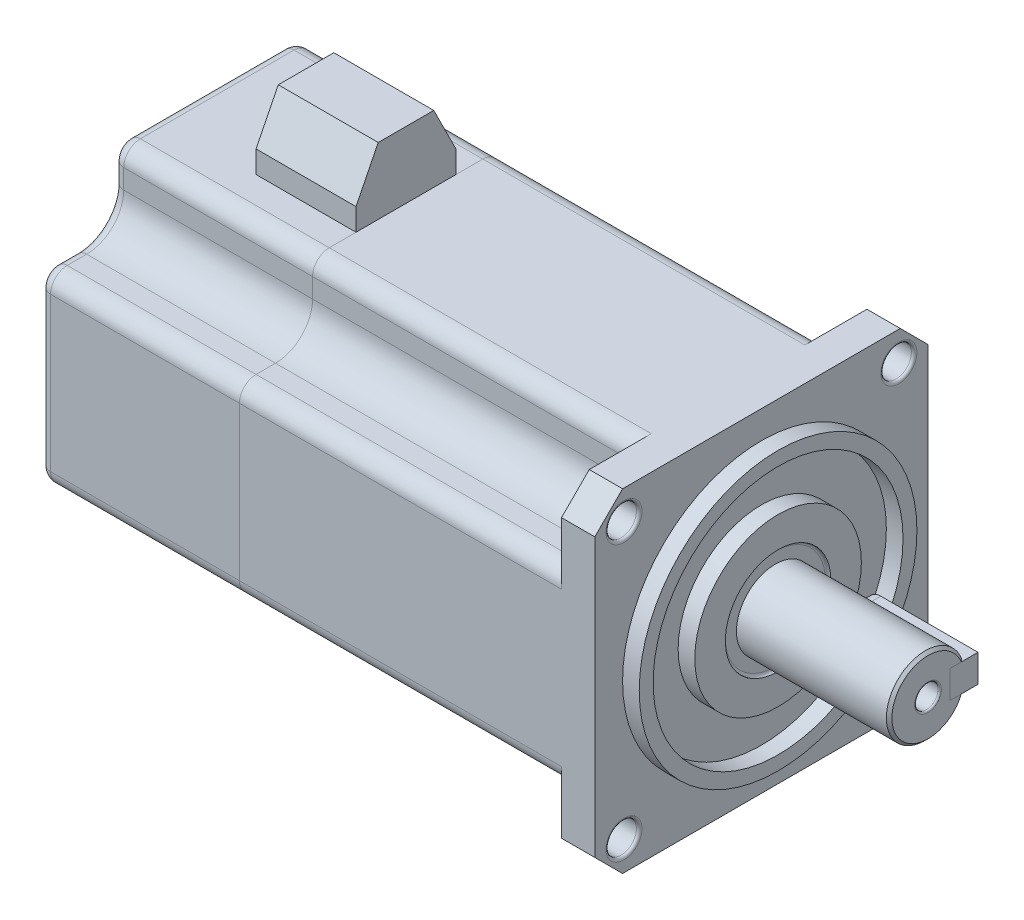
ISO-10303-21;
HEADER;
FILE_DESCRIPTION(('STEP AP214'),'2;1');
FILE_NAME('part.step','',(''),(''),'','','');
FILE_SCHEMA(('AUTOMOTIVE_DESIGN { 1 0 10303 214 1 1 1 1 }'));
ENDSEC;
DATA;
#1=APPLICATION_CONTEXT('core data for automotive mechanical design processes');
#2=APPLICATION_PROTOCOL_DEFINITION('international standard','automotive_design',2000,#1);
#3=PRODUCT_CONTEXT('',#1,'mechanical');
#4=PRODUCT('Part','Part','',(#3));
#5=PRODUCT_RELATED_PRODUCT_CATEGORY('part','',(#4));
#6=PRODUCT_DEFINITION_FORMATION('','',#4);
#7=PRODUCT_DEFINITION_CONTEXT('part definition',#1,'design');
#8=PRODUCT_DEFINITION('design','',#6,#7);
#9=PRODUCT_DEFINITION_SHAPE('','',#8);
#10=(LENGTH_UNIT() NAMED_UNIT(*) SI_UNIT(.MILLI.,.METRE.));
#11=(NAMED_UNIT(*) PLANE_ANGLE_UNIT() SI_UNIT($,.RADIAN.));
#12=(NAMED_UNIT(*) SI_UNIT($,.STERADIAN.) SOLID_ANGLE_UNIT());
#13=UNCERTAINTY_MEASURE_WITH_UNIT(LENGTH_MEASURE(1.E-05),#10,'distance_accuracy_value','');
#14=(GEOMETRIC_REPRESENTATION_CONTEXT(3) GLOBAL_UNCERTAINTY_ASSIGNED_CONTEXT((#13)) GLOBAL_UNIT_ASSIGNED_CONTEXT((#10,
#11,#12)) REPRESENTATION_CONTEXT('',''));
#15=CARTESIAN_POINT('',(0.,0.,0.));
#16=DIRECTION('',(0.,0.,1.));
#17=DIRECTION('',(1.,0.,0.));
#18=AXIS2_PLACEMENT_3D('',#15,#16,#17);
#19=CARTESIAN_POINT('',(-64.,42.,9.));
#20=DIRECTION('',(-1.,0.,0.));
#21=DIRECTION('',(0.,0.,1.));
#22=AXIS2_PLACEMENT_3D('',#19,#20,#21);
#23=PLANE('',#22);
#24=DIRECTION('',(0.,0.894427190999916,0.447213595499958));
#25=VECTOR('',#24,1.);
#26=CARTESIAN_POINT('',(-64.,10.4,-20.8));
#27=LINE('',#26,#25);
#28=CARTESIAN_POINT('',(-64.,34.,-9.));
#29=VERTEX_POINT('',#28);
#30=CARTESIAN_POINT('',(-64.,42.,-5.));
#31=VERTEX_POINT('',#30);
#32=EDGE_CURVE('E103',#29,#31,#27,.T.);
#33=ORIENTED_EDGE('',*,*,#32,.T.);
#34=DIRECTION('',(0.,0.,-1.));
#35=VECTOR('',#34,1.);
#36=CARTESIAN_POINT('',(-64.,42.,9.));
#37=LINE('',#36,#35);
#38=CARTESIAN_POINT('',(-64.,42.,5.));
#39=VERTEX_POINT('',#38);
#40=EDGE_CURVE('E129',#39,#31,#37,.T.);
#41=ORIENTED_EDGE('',*,*,#40,.F.);
#42=DIRECTION('',(0.,0.894427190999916,-0.447213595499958));
#43=VECTOR('',#42,1.);
#44=CARTESIAN_POINT('',(-64.,10.4,20.8));
#45=LINE('',#44,#43);
#46=CARTESIAN_POINT('',(-64.,34.,9.));
#47=VERTEX_POINT('',#46);
#48=EDGE_CURVE('E72',#47,#39,#45,.T.);
#49=ORIENTED_EDGE('',*,*,#48,.F.);
#50=DIRECTION('',(0.,-1.,0.));
#51=VECTOR('',#50,1.);
#52=CARTESIAN_POINT('',(-64.,42.,9.));
#53=LINE('',#52,#51);
#54=CARTESIAN_POINT('',(-64.,30.,9.));
#55=VERTEX_POINT('',#54);
#56=EDGE_CURVE('E122',#47,#55,#53,.T.);
#57=ORIENTED_EDGE('',*,*,#56,.T.);
#58=DIRECTION('',(0.,0.,-1.));
#59=VECTOR('',#58,1.);
#60=CARTESIAN_POINT('',(-64.,30.,9.));
#61=LINE('',#60,#59);
#62=CARTESIAN_POINT('',(-64.,30.,-9.));
#63=VERTEX_POINT('',#62);
#64=EDGE_CURVE('E133',#55,#63,#61,.T.);
#65=ORIENTED_EDGE('',*,*,#64,.T.);
#66=DIRECTION('',(0.,-1.,0.));
#67=VECTOR('',#66,1.);
#68=CARTESIAN_POINT('',(-64.,42.,-9.));
#69=LINE('',#68,#67);
#70=EDGE_CURVE('E12',#29,#63,#69,.T.);
#71=ORIENTED_EDGE('',*,*,#70,.F.);
#72=EDGE_LOOP('',(#33,#41,#49,#57,#65,#71));
#73=FACE_BOUND('',#72,.T.);
#74=ADVANCED_FACE('F50',(#73),#23,.F.);
#75=CARTESIAN_POINT('',(-82.,42.,-9.));
#76=DIRECTION('',(0.,0.,1.));
#77=DIRECTION('',(1.,0.,0.));
#78=AXIS2_PLACEMENT_3D('',#75,#76,#77);
#79=PLANE('',#78);
#80=DIRECTION('',(1.,0.,0.));
#81=VECTOR('',#80,1.);
#82=CARTESIAN_POINT('',(-82.,34.,-9.));
#83=LINE('',#82,#81);
#84=CARTESIAN_POINT('',(-82.,34.,-9.));
#85=VERTEX_POINT('',#84);
#86=EDGE_CURVE('E100',#85,#29,#83,.T.);
#87=ORIENTED_EDGE('',*,*,#86,.T.);
#88=ORIENTED_EDGE('',*,*,#70,.T.);
#89=DIRECTION('',(-1.,0.,0.));
#90=VECTOR('',#89,1.);
#91=CARTESIAN_POINT('',(-82.,30.,-9.));
#92=LINE('',#91,#90);
#93=CARTESIAN_POINT('',(-82.,30.,-9.));
#94=VERTEX_POINT('',#93);
#95=EDGE_CURVE('E119',#63,#94,#92,.T.);
#96=ORIENTED_EDGE('',*,*,#95,.T.);
#97=DIRECTION('',(0.,-1.,0.));
#98=VECTOR('',#97,1.);
#99=CARTESIAN_POINT('',(-82.,42.,-9.));
#100=LINE('',#99,#98);
#101=EDGE_CURVE('E57',#85,#94,#100,.T.);
#102=ORIENTED_EDGE('',*,*,#101,.F.);
#103=EDGE_LOOP('',(#87,#88,#96,#102));
#104=FACE_BOUND('',#103,.T.);
#105=ADVANCED_FACE('F117',(#104),#79,.F.);
#106=CARTESIAN_POINT('',(-82.,42.,9.));
#107=DIRECTION('',(1.,0.,0.));
#108=DIRECTION('',(0.,0.,-1.));
#109=AXIS2_PLACEMENT_3D('',#106,#107,#108);
#110=PLANE('',#109);
#111=DIRECTION('',(0.,0.894427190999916,0.447213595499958));
#112=VECTOR('',#111,1.);
#113=CARTESIAN_POINT('',(-82.,10.4,-20.8));
#114=LINE('',#113,#112);
#115=CARTESIAN_POINT('',(-82.,42.,-5.));
#116=VERTEX_POINT('',#115);
#117=EDGE_CURVE('E64',#85,#116,#114,.T.);
#118=ORIENTED_EDGE('',*,*,#117,.F.);
#119=ORIENTED_EDGE('',*,*,#101,.T.);
#120=DIRECTION('',(0.,0.,1.));
#121=VECTOR('',#120,1.);
#122=CARTESIAN_POINT('',(-82.,30.,9.));
#123=LINE('',#122,#121);
#124=CARTESIAN_POINT('',(-82.,30.,9.));
#125=VERTEX_POINT('',#124);
#126=EDGE_CURVE('E130',#94,#125,#123,.T.);
#127=ORIENTED_EDGE('',*,*,#126,.T.);
#128=DIRECTION('',(0.,-1.,0.));
#129=VECTOR('',#128,1.);
#130=CARTESIAN_POINT('',(-82.,42.,9.));
#131=LINE('',#130,#129);
#132=CARTESIAN_POINT('',(-82.,34.,9.));
#133=VERTEX_POINT('',#132);
#134=EDGE_CURVE('E121',#133,#125,#131,.T.);
#135=ORIENTED_EDGE('',*,*,#134,.F.);
#136=DIRECTION('',(0.,0.894427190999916,-0.447213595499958));
#137=VECTOR('',#136,1.);
#138=CARTESIAN_POINT('',(-82.,10.4,20.8));
#139=LINE('',#138,#137);
#140=CARTESIAN_POINT('',(-82.,42.,5.));
#141=VERTEX_POINT('',#140);
#142=EDGE_CURVE('E142',#133,#141,#139,.T.);
#143=ORIENTED_EDGE('',*,*,#142,.T.);
#144=DIRECTION('',(0.,0.,1.));
#145=VECTOR('',#144,1.);
#146=CARTESIAN_POINT('',(-82.,42.,9.));
#147=LINE('',#146,#145);
#148=EDGE_CURVE('E115',#116,#141,#147,.T.);
#149=ORIENTED_EDGE('',*,*,#148,.F.);
#150=EDGE_LOOP('',(#118,#119,#127,#135,#143,#149));
#151=FACE_BOUND('',#150,.T.);
#152=ADVANCED_FACE('F111',(#151),#110,.F.);
#153=CARTESIAN_POINT('',(0.,42.,0.));
#154=DIRECTION('',(0.,-1.,0.));
#155=DIRECTION('',(0.,0.,-1.));
#156=AXIS2_PLACEMENT_3D('',#153,#154,#155);
#157=PLANE('',#156);
#158=DIRECTION('',(1.,0.,0.));
#159=VECTOR('',#158,1.);
#160=CARTESIAN_POINT('',(-82.,42.,-5.));
#161=LINE('',#160,#159);
#162=EDGE_CURVE('E107',#116,#31,#161,.T.);
#163=ORIENTED_EDGE('',*,*,#162,.F.);
#164=ORIENTED_EDGE('',*,*,#148,.T.);
#165=DIRECTION('',(1.,0.,0.));
#166=VECTOR('',#165,1.);
#167=CARTESIAN_POINT('',(-82.,42.,5.));
#168=LINE('',#167,#166);
#169=EDGE_CURVE('E136',#141,#39,#168,.T.);
#170=ORIENTED_EDGE('',*,*,#169,.T.);
#171=ORIENTED_EDGE('',*,*,#40,.T.);
#172=EDGE_LOOP('',(#163,#164,#170,#171));
#173=FACE_BOUND('',#172,.T.);
#174=ADVANCED_FACE('F150',(#173),#157,.F.);
#175=CARTESIAN_POINT('',(-82.,42.,9.));
#176=DIRECTION('',(0.,0.,-1.));
#177=DIRECTION('',(-1.,0.,0.));
#178=AXIS2_PLACEMENT_3D('',#175,#176,#177);
#179=PLANE('',#178);
#180=ORIENTED_EDGE('',*,*,#56,.F.);
#181=DIRECTION('',(1.,0.,0.));
#182=VECTOR('',#181,1.);
#183=CARTESIAN_POINT('',(-82.,34.,9.));
#184=LINE('',#183,#182);
#185=EDGE_CURVE('E140',#133,#47,#184,.T.);
#186=ORIENTED_EDGE('',*,*,#185,.F.);
#187=ORIENTED_EDGE('',*,*,#134,.T.);
#188=DIRECTION('',(1.,0.,0.));
#189=VECTOR('',#188,1.);
#190=CARTESIAN_POINT('',(-82.,30.,9.));
#191=LINE('',#190,#189);
#192=EDGE_CURVE('E126',#125,#55,#191,.T.);
#193=ORIENTED_EDGE('',*,*,#192,.T.);
#194=EDGE_LOOP('',(#180,#186,#187,#193));
#195=FACE_BOUND('',#194,.T.);
#196=ADVANCED_FACE('F157',(#195),#179,.F.);
#197=CARTESIAN_POINT('',(0.,30.,0.));
#198=DIRECTION('',(0.,-1.,0.));
#199=DIRECTION('',(0.,0.,-1.));
#200=AXIS2_PLACEMENT_3D('',#197,#198,#199);
#201=PLANE('',#200);
#202=ORIENTED_EDGE('',*,*,#64,.F.);
#203=ORIENTED_EDGE('',*,*,#192,.F.);
#204=ORIENTED_EDGE('',*,*,#126,.F.);
#205=ORIENTED_EDGE('',*,*,#95,.F.);
#206=EDGE_LOOP('',(#202,#203,#204,#205));
#207=FACE_BOUND('',#206,.T.);
#208=ADVANCED_FACE('F160',(#207),#201,.T.);
#209=CARTESIAN_POINT('',(-82.,10.4,20.8));
#210=DIRECTION('',(0.,-0.447213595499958,-0.894427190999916));
#211=DIRECTION('',(0.,0.894427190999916,-0.447213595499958));
#212=AXIS2_PLACEMENT_3D('',#209,#210,#211);
#213=PLANE('',#212);
#214=ORIENTED_EDGE('',*,*,#48,.T.);
#215=ORIENTED_EDGE('',*,*,#169,.F.);
#216=ORIENTED_EDGE('',*,*,#142,.F.);
#217=ORIENTED_EDGE('',*,*,#185,.T.);
#218=EDGE_LOOP('',(#214,#215,#216,#217));
#219=FACE_BOUND('',#218,.T.);
#220=ADVANCED_FACE('F151',(#219),#213,.F.);
#221=CARTESIAN_POINT('',(-82.,10.4,-20.8));
#222=DIRECTION('',(0.,0.447213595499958,-0.894427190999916));
#223=DIRECTION('',(0.,0.894427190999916,0.447213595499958));
#224=AXIS2_PLACEMENT_3D('',#221,#222,#223);
#225=PLANE('',#224);
#226=ORIENTED_EDGE('',*,*,#32,.F.);
#227=ORIENTED_EDGE('',*,*,#86,.F.);
#228=ORIENTED_EDGE('',*,*,#117,.T.);
#229=ORIENTED_EDGE('',*,*,#162,.T.);
#230=EDGE_LOOP('',(#226,#227,#228,#229));
#231=FACE_BOUND('',#230,.T.);
#232=ADVANCED_FACE('F101',(#231),#225,.T.);
#233=CLOSED_SHELL('',(#74,#105,#152,#174,#196,#208,#220,#232));
#234=MANIFOLD_SOLID_BREP('B2',#233);
#235=CARTESIAN_POINT('',(-100.,-13.8291679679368,-27.));
#236=DIRECTION('',(1.,0.,0.));
#237=DIRECTION('',(0.,0.,-1.));
#238=AXIS2_PLACEMENT_3D('',#235,#236,#237);
#239=CYLINDRICAL_SURFACE('',#238,3.);
#240=DIRECTION('',(1.,0.,0.));
#241=VECTOR('',#240,1.);
#242=CARTESIAN_POINT('',(-100.,-16.8291679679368,-27.));
#243=LINE('',#242,#241);
#244=CARTESIAN_POINT('',(-98.,-16.8291679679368,-27.));
#245=VERTEX_POINT('',#244);
#246=CARTESIAN_POINT('',(-64.,-16.8291679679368,-27.));
#247=VERTEX_POINT('',#246);
#248=EDGE_CURVE('E468',#245,#247,#243,.T.);
#249=ORIENTED_EDGE('',*,*,#248,.F.);
#250=CARTESIAN_POINT('',(-98.,-13.8291679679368,-27.));
#251=DIRECTION('',(1.,0.,0.));
#252=DIRECTION('',(0.,0.,-1.));
#253=AXIS2_PLACEMENT_3D('',#250,#251,#252);
#254=CIRCLE('',#253,3.);
#255=CARTESIAN_POINT('',(-98.,-13.8291679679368,-30.));
#256=VERTEX_POINT('',#255);
#257=EDGE_CURVE('E48',#245,#256,#254,.T.);
#258=ORIENTED_EDGE('',*,*,#257,.T.);
#259=DIRECTION('',(1.,0.,0.));
#260=VECTOR('',#259,1.);
#261=CARTESIAN_POINT('',(-100.,-13.8291679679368,-30.));
#262=LINE('',#261,#260);
#263=CARTESIAN_POINT('',(-64.,-13.8291679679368,-30.));
#264=VERTEX_POINT('',#263);
#265=EDGE_CURVE('E489',#256,#264,#262,.T.);
#266=ORIENTED_EDGE('',*,*,#265,.T.);
#267=CARTESIAN_POINT('',(-64.,-13.8291679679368,-27.));
#268=DIRECTION('',(-1.,0.,0.));
#269=DIRECTION('',(0.,0.,-1.));
#270=AXIS2_PLACEMENT_3D('',#267,#268,#269);
#271=CIRCLE('',#270,3.);
#272=EDGE_CURVE('E483',#264,#247,#271,.T.);
#273=ORIENTED_EDGE('',*,*,#272,.T.);
#274=EDGE_LOOP('',(#249,#258,#266,#273));
#275=FACE_BOUND('',#274,.T.);
#276=ADVANCED_FACE('F236',(#275),#239,.T.);
#277=CARTESIAN_POINT('',(-100.,-16.8291679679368,-23.5));
#278=DIRECTION('',(0.,1.,0.));
#279=DIRECTION('',(0.,0.,1.));
#280=AXIS2_PLACEMENT_3D('',#277,#278,#279);
#281=PLANE('',#280);
#282=DIRECTION('',(1.,0.,0.));
#283=VECTOR('',#282,1.);
#284=CARTESIAN_POINT('',(-100.,-16.8291679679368,-23.5));
#285=LINE('',#284,#283);
#286=CARTESIAN_POINT('',(-98.,-16.8291679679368,-23.5));
#287=VERTEX_POINT('',#286);
#288=CARTESIAN_POINT('',(-64.,-16.8291679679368,-23.5));
#289=VERTEX_POINT('',#288);
#290=EDGE_CURVE('E477',#287,#289,#285,.T.);
#291=ORIENTED_EDGE('',*,*,#290,.F.);
#292=DIRECTION('',(0.,0.,1.));
#293=VECTOR('',#292,1.);
#294=CARTESIAN_POINT('',(-98.,-16.8291679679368,-23.5));
#295=LINE('',#294,#293);
#296=EDGE_CURVE('E245',#287,#245,#295,.F.);
#297=ORIENTED_EDGE('',*,*,#296,.T.);
#298=ORIENTED_EDGE('',*,*,#248,.T.);
#299=DIRECTION('',(0.,0.,1.));
#300=VECTOR('',#299,1.);
#301=CARTESIAN_POINT('',(-64.,-16.8291679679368,-23.5));
#302=LINE('',#301,#300);
#303=EDGE_CURVE('E471',#247,#289,#302,.T.);
#304=ORIENTED_EDGE('',*,*,#303,.T.);
#305=EDGE_LOOP('',(#291,#297,#298,#304));
#306=FACE_BOUND('',#305,.T.);
#307=ADVANCED_FACE('F470',(#306),#281,.F.);
#308=CARTESIAN_POINT('',(-100.,-23.5,-23.5));
#309=DIRECTION('',(1.,0.,0.));
#310=DIRECTION('',(0.,0.,-1.));
#311=AXIS2_PLACEMENT_3D('',#308,#309,#310);
#312=CYLINDRICAL_SURFACE('',#311,6.67083203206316);
#313=DIRECTION('',(1.,0.,0.));
#314=VECTOR('',#313,1.);
#315=CARTESIAN_POINT('',(-100.,-23.5,-16.8291679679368));
#316=LINE('',#315,#314);
#317=CARTESIAN_POINT('',(-98.,-23.5,-16.8291679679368));
#318=VERTEX_POINT('',#317);
#319=CARTESIAN_POINT('',(-64.,-23.5,-16.8291679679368));
#320=VERTEX_POINT('',#319);
#321=EDGE_CURVE('E599',#318,#320,#316,.T.);
#322=ORIENTED_EDGE('',*,*,#321,.F.);
#323=CARTESIAN_POINT('',(-98.,-23.5,-23.5));
#324=DIRECTION('',(1.,0.,0.));
#325=DIRECTION('',(0.,0.,-1.));
#326=AXIS2_PLACEMENT_3D('',#323,#324,#325);
#327=CIRCLE('',#326,6.67083203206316);
#328=EDGE_CURVE('E260',#318,#287,#327,.F.);
#329=ORIENTED_EDGE('',*,*,#328,.T.);
#330=ORIENTED_EDGE('',*,*,#290,.T.);
#331=CARTESIAN_POINT('',(-64.,-23.5,-23.5));
#332=DIRECTION('',(1.,0.,0.));
#333=DIRECTION('',(0.,0.,1.));
#334=AXIS2_PLACEMENT_3D('',#331,#332,#333);
#335=CIRCLE('',#334,6.67083203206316);
#336=EDGE_CURVE('E486',#289,#320,#335,.T.);
#337=ORIENTED_EDGE('',*,*,#336,.T.);
#338=EDGE_LOOP('',(#322,#329,#330,#337));
#339=FACE_BOUND('',#338,.T.);
#340=ADVANCED_FACE('F917',(#339),#312,.F.);
#341=CARTESIAN_POINT('',(-100.,-23.5,-16.8291679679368));
#342=DIRECTION('',(0.,0.,1.));
#343=DIRECTION('',(1.,0.,0.));
#344=AXIS2_PLACEMENT_3D('',#341,#342,#343);
#345=PLANE('',#344);
#346=DIRECTION('',(1.,0.,0.));
#347=VECTOR('',#346,1.);
#348=CARTESIAN_POINT('',(-100.,-27.,-16.8291679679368));
#349=LINE('',#348,#347);
#350=CARTESIAN_POINT('',(-98.,-27.,-16.8291679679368));
#351=VERTEX_POINT('',#350);
#352=CARTESIAN_POINT('',(-64.,-27.,-16.8291679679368));
#353=VERTEX_POINT('',#352);
#354=EDGE_CURVE('E597',#351,#353,#349,.T.);
#355=ORIENTED_EDGE('',*,*,#354,.F.);
#356=DIRECTION('',(0.,-1.,0.));
#357=VECTOR('',#356,1.);
#358=CARTESIAN_POINT('',(-98.,-23.5,-16.8291679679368));
#359=LINE('',#358,#357);
#360=EDGE_CURVE('E691',#351,#318,#359,.F.);
#361=ORIENTED_EDGE('',*,*,#360,.T.);
#362=ORIENTED_EDGE('',*,*,#321,.T.);
#363=DIRECTION('',(0.,-1.,0.));
#364=VECTOR('',#363,1.);
#365=CARTESIAN_POINT('',(-64.,-23.5,-16.8291679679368));
#366=LINE('',#365,#364);
#367=EDGE_CURVE('E496',#320,#353,#366,.T.);
#368=ORIENTED_EDGE('',*,*,#367,.T.);
#369=EDGE_LOOP('',(#355,#361,#362,#368));
#370=FACE_BOUND('',#369,.T.);
#371=ADVANCED_FACE('F1274',(#370),#345,.F.);
#372=CARTESIAN_POINT('',(-100.,-27.,-13.8291679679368));
#373=DIRECTION('',(1.,0.,0.));
#374=DIRECTION('',(0.,0.,-1.));
#375=AXIS2_PLACEMENT_3D('',#372,#373,#374);
#376=CYLINDRICAL_SURFACE('',#375,3.);
#377=DIRECTION('',(1.,0.,0.));
#378=VECTOR('',#377,1.);
#379=CARTESIAN_POINT('',(-100.,-30.,-13.8291679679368));
#380=LINE('',#379,#378);
#381=CARTESIAN_POINT('',(-98.,-30.,-13.8291679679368));
#382=VERTEX_POINT('',#381);
#383=CARTESIAN_POINT('',(-64.,-30.,-13.8291679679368));
#384=VERTEX_POINT('',#383);
#385=EDGE_CURVE('E595',#382,#384,#380,.T.);
#386=ORIENTED_EDGE('',*,*,#385,.F.);
#387=CARTESIAN_POINT('',(-98.,-27.,-13.8291679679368));
#388=DIRECTION('',(1.,0.,0.));
#389=DIRECTION('',(0.,0.,-1.));
#390=AXIS2_PLACEMENT_3D('',#387,#388,#389);
#391=CIRCLE('',#390,3.);
#392=EDGE_CURVE('E689',#382,#351,#391,.T.);
#393=ORIENTED_EDGE('',*,*,#392,.T.);
#394=ORIENTED_EDGE('',*,*,#354,.T.);
#395=CARTESIAN_POINT('',(-64.,-27.,-13.8291679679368));
#396=DIRECTION('',(-1.,0.,0.));
#397=DIRECTION('',(0.,0.,1.));
#398=AXIS2_PLACEMENT_3D('',#395,#396,#397);
#399=CIRCLE('',#398,3.);
#400=EDGE_CURVE('E499',#353,#384,#399,.T.);
#401=ORIENTED_EDGE('',*,*,#400,.T.);
#402=EDGE_LOOP('',(#386,#393,#394,#401));
#403=FACE_BOUND('',#402,.T.);
#404=ADVANCED_FACE('F1265',(#403),#376,.T.);
#405=CARTESIAN_POINT('',(-100.,-30.,13.8291679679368));
#406=DIRECTION('',(0.,1.,0.));
#407=DIRECTION('',(0.,0.,1.));
#408=AXIS2_PLACEMENT_3D('',#405,#406,#407);
#409=PLANE('',#408);
#410=DIRECTION('',(1.,0.,0.));
#411=VECTOR('',#410,1.);
#412=CARTESIAN_POINT('',(-100.,-30.,13.8291679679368));
#413=LINE('',#412,#411);
#414=CARTESIAN_POINT('',(-98.,-30.,13.8291679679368));
#415=VERTEX_POINT('',#414);
#416=CARTESIAN_POINT('',(-64.,-30.,13.8291679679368));
#417=VERTEX_POINT('',#416);
#418=EDGE_CURVE('E593',#415,#417,#413,.T.);
#419=ORIENTED_EDGE('',*,*,#418,.F.);
#420=DIRECTION('',(0.,0.,1.));
#421=VECTOR('',#420,1.);
#422=CARTESIAN_POINT('',(-98.,-30.,13.8291679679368));
#423=LINE('',#422,#421);
#424=EDGE_CURVE('E687',#415,#382,#423,.F.);
#425=ORIENTED_EDGE('',*,*,#424,.T.);
#426=ORIENTED_EDGE('',*,*,#385,.T.);
#427=DIRECTION('',(0.,0.,1.));
#428=VECTOR('',#427,1.);
#429=CARTESIAN_POINT('',(-64.,-30.,13.8291679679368));
#430=LINE('',#429,#428);
#431=EDGE_CURVE('E502',#384,#417,#430,.T.);
#432=ORIENTED_EDGE('',*,*,#431,.T.);
#433=EDGE_LOOP('',(#419,#425,#426,#432));
#434=FACE_BOUND('',#433,.T.);
#435=ADVANCED_FACE('F1256',(#434),#409,.F.);
#436=CARTESIAN_POINT('',(-100.,-27.,13.8291679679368));
#437=DIRECTION('',(1.,0.,0.));
#438=DIRECTION('',(0.,0.,-1.));
#439=AXIS2_PLACEMENT_3D('',#436,#437,#438);
#440=CYLINDRICAL_SURFACE('',#439,3.);
#441=DIRECTION('',(1.,0.,0.));
#442=VECTOR('',#441,1.);
#443=CARTESIAN_POINT('',(-100.,-27.,16.8291679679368));
#444=LINE('',#443,#442);
#445=CARTESIAN_POINT('',(-98.,-27.,16.8291679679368));
#446=VERTEX_POINT('',#445);
#447=CARTESIAN_POINT('',(-64.,-27.,16.8291679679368));
#448=VERTEX_POINT('',#447);
#449=EDGE_CURVE('E591',#446,#448,#444,.T.);
#450=ORIENTED_EDGE('',*,*,#449,.F.);
#451=CARTESIAN_POINT('',(-98.,-27.,13.8291679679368));
#452=DIRECTION('',(1.,0.,0.));
#453=DIRECTION('',(0.,0.,-1.));
#454=AXIS2_PLACEMENT_3D('',#451,#452,#453);
#455=CIRCLE('',#454,3.);
#456=EDGE_CURVE('E685',#446,#415,#455,.T.);
#457=ORIENTED_EDGE('',*,*,#456,.T.);
#458=ORIENTED_EDGE('',*,*,#418,.T.);
#459=CARTESIAN_POINT('',(-64.,-27.,13.8291679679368));
#460=DIRECTION('',(-1.,0.,0.));
#461=DIRECTION('',(0.,0.,-1.));
#462=AXIS2_PLACEMENT_3D('',#459,#460,#461);
#463=CIRCLE('',#462,3.);
#464=EDGE_CURVE('E505',#417,#448,#463,.T.);
#465=ORIENTED_EDGE('',*,*,#464,.T.);
#466=EDGE_LOOP('',(#450,#457,#458,#465));
#467=FACE_BOUND('',#466,.T.);
#468=ADVANCED_FACE('F1248',(#467),#440,.T.);
#469=CARTESIAN_POINT('',(-100.,-23.5,16.8291679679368));
#470=DIRECTION('',(0.,0.,-1.));
#471=DIRECTION('',(-1.,0.,0.));
#472=AXIS2_PLACEMENT_3D('',#469,#470,#471);
#473=PLANE('',#472);
#474=DIRECTION('',(1.,0.,0.));
#475=VECTOR('',#474,1.);
#476=CARTESIAN_POINT('',(-100.,-23.5,16.8291679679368));
#477=LINE('',#476,#475);
#478=CARTESIAN_POINT('',(-98.,-23.5,16.8291679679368));
#479=VERTEX_POINT('',#478);
#480=CARTESIAN_POINT('',(-64.,-23.5,16.8291679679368));
#481=VERTEX_POINT('',#480);
#482=EDGE_CURVE('E589',#479,#481,#477,.T.);
#483=ORIENTED_EDGE('',*,*,#482,.F.);
#484=DIRECTION('',(0.,1.,0.));
#485=VECTOR('',#484,1.);
#486=CARTESIAN_POINT('',(-98.,-23.5,16.8291679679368));
#487=LINE('',#486,#485);
#488=EDGE_CURVE('E683',#479,#446,#487,.F.);
#489=ORIENTED_EDGE('',*,*,#488,.T.);
#490=ORIENTED_EDGE('',*,*,#449,.T.);
#491=DIRECTION('',(0.,1.,0.));
#492=VECTOR('',#491,1.);
#493=CARTESIAN_POINT('',(-64.,-23.5,16.8291679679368));
#494=LINE('',#493,#492);
#495=EDGE_CURVE('E508',#448,#481,#494,.T.);
#496=ORIENTED_EDGE('',*,*,#495,.T.);
#497=EDGE_LOOP('',(#483,#489,#490,#496));
#498=FACE_BOUND('',#497,.T.);
#499=ADVANCED_FACE('F789',(#498),#473,.F.);
#500=CARTESIAN_POINT('',(-100.,-23.5,23.5));
#501=DIRECTION('',(1.,0.,0.));
#502=DIRECTION('',(0.,0.,-1.));
#503=AXIS2_PLACEMENT_3D('',#500,#501,#502);
#504=CYLINDRICAL_SURFACE('',#503,6.67083203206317);
#505=DIRECTION('',(1.,0.,0.));
#506=VECTOR('',#505,1.);
#507=CARTESIAN_POINT('',(-100.,-16.8291679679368,23.5));
#508=LINE('',#507,#506);
#509=CARTESIAN_POINT('',(-98.,-16.8291679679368,23.5));
#510=VERTEX_POINT('',#509);
#511=CARTESIAN_POINT('',(-64.,-16.8291679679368,23.5));
#512=VERTEX_POINT('',#511);
#513=EDGE_CURVE('E587',#510,#512,#508,.T.);
#514=ORIENTED_EDGE('',*,*,#513,.F.);
#515=CARTESIAN_POINT('',(-98.,-23.5,23.5));
#516=DIRECTION('',(1.,0.,0.));
#517=DIRECTION('',(0.,0.,-1.));
#518=AXIS2_PLACEMENT_3D('',#515,#516,#517);
#519=CIRCLE('',#518,6.67083203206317);
#520=EDGE_CURVE('E681',#510,#479,#519,.F.);
#521=ORIENTED_EDGE('',*,*,#520,.T.);
#522=ORIENTED_EDGE('',*,*,#482,.T.);
#523=CARTESIAN_POINT('',(-64.,-23.5,23.5));
#524=DIRECTION('',(1.,0.,0.));
#525=DIRECTION('',(0.,0.,1.));
#526=AXIS2_PLACEMENT_3D('',#523,#524,#525);
#527=CIRCLE('',#526,6.67083203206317);
#528=EDGE_CURVE('E511',#481,#512,#527,.T.);
#529=ORIENTED_EDGE('',*,*,#528,.T.);
#530=EDGE_LOOP('',(#514,#521,#522,#529));
#531=FACE_BOUND('',#530,.T.);
#532=ADVANCED_FACE('F787',(#531),#504,.F.);
#533=CARTESIAN_POINT('',(-100.,-16.8291679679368,23.5));
#534=DIRECTION('',(0.,1.,0.));
#535=DIRECTION('',(0.,0.,1.));
#536=AXIS2_PLACEMENT_3D('',#533,#534,#535);
#537=PLANE('',#536);
#538=DIRECTION('',(1.,0.,0.));
#539=VECTOR('',#538,1.);
#540=CARTESIAN_POINT('',(-100.,-16.8291679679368,27.));
#541=LINE('',#540,#539);
#542=CARTESIAN_POINT('',(-98.,-16.8291679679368,27.));
#543=VERTEX_POINT('',#542);
#544=CARTESIAN_POINT('',(-64.,-16.8291679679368,27.));
#545=VERTEX_POINT('',#544);
#546=EDGE_CURVE('E585',#543,#545,#541,.T.);
#547=ORIENTED_EDGE('',*,*,#546,.F.);
#548=DIRECTION('',(0.,0.,1.));
#549=VECTOR('',#548,1.);
#550=CARTESIAN_POINT('',(-98.,-16.8291679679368,23.5));
#551=LINE('',#550,#549);
#552=EDGE_CURVE('E679',#543,#510,#551,.F.);
#553=ORIENTED_EDGE('',*,*,#552,.T.);
#554=ORIENTED_EDGE('',*,*,#513,.T.);
#555=DIRECTION('',(0.,0.,1.));
#556=VECTOR('',#555,1.);
#557=CARTESIAN_POINT('',(-64.,-16.8291679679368,23.5));
#558=LINE('',#557,#556);
#559=EDGE_CURVE('E514',#512,#545,#558,.T.);
#560=ORIENTED_EDGE('',*,*,#559,.T.);
#561=EDGE_LOOP('',(#547,#553,#554,#560));
#562=FACE_BOUND('',#561,.T.);
#563=ADVANCED_FACE('F799',(#562),#537,.F.);
#564=CARTESIAN_POINT('',(-100.,-13.8291679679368,27.));
#565=DIRECTION('',(1.,0.,0.));
#566=DIRECTION('',(0.,0.,-1.));
#567=AXIS2_PLACEMENT_3D('',#564,#565,#566);
#568=CYLINDRICAL_SURFACE('',#567,3.);
#569=DIRECTION('',(1.,0.,0.));
#570=VECTOR('',#569,1.);
#571=CARTESIAN_POINT('',(-100.,-13.8291679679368,30.));
#572=LINE('',#571,#570);
#573=CARTESIAN_POINT('',(-98.,-13.8291679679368,30.));
#574=VERTEX_POINT('',#573);
#575=CARTESIAN_POINT('',(-64.,-13.8291679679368,30.));
#576=VERTEX_POINT('',#575);
#577=EDGE_CURVE('E583',#574,#576,#572,.T.);
#578=ORIENTED_EDGE('',*,*,#577,.F.);
#579=CARTESIAN_POINT('',(-98.,-13.8291679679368,27.));
#580=DIRECTION('',(1.,0.,0.));
#581=DIRECTION('',(0.,0.,-1.));
#582=AXIS2_PLACEMENT_3D('',#579,#580,#581);
#583=CIRCLE('',#582,3.);
#584=EDGE_CURVE('E677',#574,#543,#583,.T.);
#585=ORIENTED_EDGE('',*,*,#584,.T.);
#586=ORIENTED_EDGE('',*,*,#546,.T.);
#587=CARTESIAN_POINT('',(-64.,-13.8291679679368,27.));
#588=DIRECTION('',(-1.,0.,0.));
#589=DIRECTION('',(0.,0.,1.));
#590=AXIS2_PLACEMENT_3D('',#587,#588,#589);
#591=CIRCLE('',#590,3.);
#592=EDGE_CURVE('E517',#545,#576,#591,.T.);
#593=ORIENTED_EDGE('',*,*,#592,.T.);
#594=EDGE_LOOP('',(#578,#585,#586,#593));
#595=FACE_BOUND('',#594,.T.);
#596=ADVANCED_FACE('F802',(#595),#568,.T.);
#597=CARTESIAN_POINT('',(-100.,13.8291679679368,30.));
#598=DIRECTION('',(0.,0.,-1.));
#599=DIRECTION('',(0.,1.,0.));
#600=AXIS2_PLACEMENT_3D('',#597,#598,#599);
#601=PLANE('',#600);
#602=DIRECTION('',(1.,0.,0.));
#603=VECTOR('',#602,1.);
#604=CARTESIAN_POINT('',(-100.,13.8291679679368,30.));
#605=LINE('',#604,#603);
#606=CARTESIAN_POINT('',(-98.,13.8291679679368,30.));
#607=VERTEX_POINT('',#606);
#608=CARTESIAN_POINT('',(-64.,13.8291679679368,30.));
#609=VERTEX_POINT('',#608);
#610=EDGE_CURVE('E581',#607,#609,#605,.T.);
#611=ORIENTED_EDGE('',*,*,#610,.F.);
#612=DIRECTION('',(0.,1.,0.));
#613=VECTOR('',#612,1.);
#614=CARTESIAN_POINT('',(-98.,13.8291679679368,30.));
#615=LINE('',#614,#613);
#616=EDGE_CURVE('E675',#607,#574,#615,.F.);
#617=ORIENTED_EDGE('',*,*,#616,.T.);
#618=ORIENTED_EDGE('',*,*,#577,.T.);
#619=DIRECTION('',(0.,1.,0.));
#620=VECTOR('',#619,1.);
#621=CARTESIAN_POINT('',(-64.,13.8291679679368,30.));
#622=LINE('',#621,#620);
#623=EDGE_CURVE('E520',#576,#609,#622,.T.);
#624=ORIENTED_EDGE('',*,*,#623,.T.);
#625=EDGE_LOOP('',(#611,#617,#618,#624));
#626=FACE_BOUND('',#625,.T.);
#627=ADVANCED_FACE('F805',(#626),#601,.F.);
#628=CARTESIAN_POINT('',(-100.,13.8291679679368,27.));
#629=DIRECTION('',(1.,0.,0.));
#630=DIRECTION('',(0.,0.,-1.));
#631=AXIS2_PLACEMENT_3D('',#628,#629,#630);
#632=CYLINDRICAL_SURFACE('',#631,3.);
#633=DIRECTION('',(1.,0.,0.));
#634=VECTOR('',#633,1.);
#635=CARTESIAN_POINT('',(-100.,16.8291679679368,27.));
#636=LINE('',#635,#634);
#637=CARTESIAN_POINT('',(-98.,16.8291679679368,27.));
#638=VERTEX_POINT('',#637);
#639=CARTESIAN_POINT('',(-64.,16.8291679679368,27.));
#640=VERTEX_POINT('',#639);
#641=EDGE_CURVE('E579',#638,#640,#636,.T.);
#642=ORIENTED_EDGE('',*,*,#641,.F.);
#643=CARTESIAN_POINT('',(-98.,13.8291679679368,27.));
#644=DIRECTION('',(1.,0.,0.));
#645=DIRECTION('',(0.,0.,-1.));
#646=AXIS2_PLACEMENT_3D('',#643,#644,#645);
#647=CIRCLE('',#646,3.);
#648=EDGE_CURVE('E673',#638,#607,#647,.T.);
#649=ORIENTED_EDGE('',*,*,#648,.T.);
#650=ORIENTED_EDGE('',*,*,#610,.T.);
#651=CARTESIAN_POINT('',(-64.,13.8291679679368,27.));
#652=DIRECTION('',(-1.,0.,0.));
#653=DIRECTION('',(0.,0.,-1.));
#654=AXIS2_PLACEMENT_3D('',#651,#652,#653);
#655=CIRCLE('',#654,3.);
#656=EDGE_CURVE('E523',#609,#640,#655,.T.);
#657=ORIENTED_EDGE('',*,*,#656,.T.);
#658=EDGE_LOOP('',(#642,#649,#650,#657));
#659=FACE_BOUND('',#658,.T.);
#660=ADVANCED_FACE('F809',(#659),#632,.T.);
#661=CARTESIAN_POINT('',(-100.,16.8291679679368,23.5));
#662=DIRECTION('',(0.,-1.,0.));
#663=DIRECTION('',(0.,0.,-1.));
#664=AXIS2_PLACEMENT_3D('',#661,#662,#663);
#665=PLANE('',#664);
#666=DIRECTION('',(1.,0.,0.));
#667=VECTOR('',#666,1.);
#668=CARTESIAN_POINT('',(-100.,16.8291679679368,23.5));
#669=LINE('',#668,#667);
#670=CARTESIAN_POINT('',(-98.,16.8291679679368,23.5));
#671=VERTEX_POINT('',#670);
#672=CARTESIAN_POINT('',(-64.,16.8291679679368,23.5));
#673=VERTEX_POINT('',#672);
#674=EDGE_CURVE('E577',#671,#673,#669,.T.);
#675=ORIENTED_EDGE('',*,*,#674,.F.);
#676=DIRECTION('',(0.,0.,-1.));
#677=VECTOR('',#676,1.);
#678=CARTESIAN_POINT('',(-98.,16.8291679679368,23.5));
#679=LINE('',#678,#677);
#680=EDGE_CURVE('E671',#671,#638,#679,.F.);
#681=ORIENTED_EDGE('',*,*,#680,.T.);
#682=ORIENTED_EDGE('',*,*,#641,.T.);
#683=DIRECTION('',(0.,0.,-1.));
#684=VECTOR('',#683,1.);
#685=CARTESIAN_POINT('',(-64.,16.8291679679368,23.5));
#686=LINE('',#685,#684);
#687=EDGE_CURVE('E526',#640,#673,#686,.T.);
#688=ORIENTED_EDGE('',*,*,#687,.T.);
#689=EDGE_LOOP('',(#675,#681,#682,#688));
#690=FACE_BOUND('',#689,.T.);
#691=ADVANCED_FACE('F1196',(#690),#665,.F.);
#692=CARTESIAN_POINT('',(-100.,23.5,23.5));
#693=DIRECTION('',(1.,0.,0.));
#694=DIRECTION('',(0.,0.,-1.));
#695=AXIS2_PLACEMENT_3D('',#692,#693,#694);
#696=CYLINDRICAL_SURFACE('',#695,6.67083203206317);
#697=DIRECTION('',(1.,0.,0.));
#698=VECTOR('',#697,1.);
#699=CARTESIAN_POINT('',(-100.,23.5,16.8291679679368));
#700=LINE('',#699,#698);
#701=CARTESIAN_POINT('',(-98.,23.5,16.8291679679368));
#702=VERTEX_POINT('',#701);
#703=CARTESIAN_POINT('',(-64.,23.5,16.8291679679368));
#704=VERTEX_POINT('',#703);
#705=EDGE_CURVE('E575',#702,#704,#700,.T.);
#706=ORIENTED_EDGE('',*,*,#705,.F.);
#707=CARTESIAN_POINT('',(-98.,23.5,23.5));
#708=DIRECTION('',(1.,0.,0.));
#709=DIRECTION('',(0.,0.,-1.));
#710=AXIS2_PLACEMENT_3D('',#707,#708,#709);
#711=CIRCLE('',#710,6.67083203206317);
#712=EDGE_CURVE('E669',#702,#671,#711,.F.);
#713=ORIENTED_EDGE('',*,*,#712,.T.);
#714=ORIENTED_EDGE('',*,*,#674,.T.);
#715=CARTESIAN_POINT('',(-64.,23.5,23.5));
#716=DIRECTION('',(1.,0.,0.));
#717=DIRECTION('',(0.,0.,1.));
#718=AXIS2_PLACEMENT_3D('',#715,#716,#717);
#719=CIRCLE('',#718,6.67083203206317);
#720=EDGE_CURVE('E529',#673,#704,#719,.T.);
#721=ORIENTED_EDGE('',*,*,#720,.T.);
#722=EDGE_LOOP('',(#706,#713,#714,#721));
#723=FACE_BOUND('',#722,.T.);
#724=ADVANCED_FACE('F1187',(#723),#696,.F.);
#725=CARTESIAN_POINT('',(-100.,23.5,16.8291679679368));
#726=DIRECTION('',(0.,0.,-1.));
#727=DIRECTION('',(-1.,0.,0.));
#728=AXIS2_PLACEMENT_3D('',#725,#726,#727);
#729=PLANE('',#728);
#730=DIRECTION('',(1.,0.,0.));
#731=VECTOR('',#730,1.);
#732=CARTESIAN_POINT('',(-100.,27.,16.8291679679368));
#733=LINE('',#732,#731);
#734=CARTESIAN_POINT('',(-98.,27.,16.8291679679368));
#735=VERTEX_POINT('',#734);
#736=CARTESIAN_POINT('',(-64.,27.,16.8291679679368));
#737=VERTEX_POINT('',#736);
#738=EDGE_CURVE('E573',#735,#737,#733,.T.);
#739=ORIENTED_EDGE('',*,*,#738,.F.);
#740=DIRECTION('',(0.,1.,0.));
#741=VECTOR('',#740,1.);
#742=CARTESIAN_POINT('',(-98.,23.5,16.8291679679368));
#743=LINE('',#742,#741);
#744=EDGE_CURVE('E667',#735,#702,#743,.F.);
#745=ORIENTED_EDGE('',*,*,#744,.T.);
#746=ORIENTED_EDGE('',*,*,#705,.T.);
#747=DIRECTION('',(0.,1.,0.));
#748=VECTOR('',#747,1.);
#749=CARTESIAN_POINT('',(-64.,23.5,16.8291679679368));
#750=LINE('',#749,#748);
#751=EDGE_CURVE('E532',#704,#737,#750,.T.);
#752=ORIENTED_EDGE('',*,*,#751,.T.);
#753=EDGE_LOOP('',(#739,#745,#746,#752));
#754=FACE_BOUND('',#753,.T.);
#755=ADVANCED_FACE('F1178',(#754),#729,.F.);
#756=CARTESIAN_POINT('',(-100.,27.,13.8291679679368));
#757=DIRECTION('',(1.,0.,0.));
#758=DIRECTION('',(0.,0.,-1.));
#759=AXIS2_PLACEMENT_3D('',#756,#757,#758);
#760=CYLINDRICAL_SURFACE('',#759,3.);
#761=DIRECTION('',(1.,0.,0.));
#762=VECTOR('',#761,1.);
#763=CARTESIAN_POINT('',(-100.,30.,13.8291679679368));
#764=LINE('',#763,#762);
#765=CARTESIAN_POINT('',(-98.,30.,13.8291679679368));
#766=VERTEX_POINT('',#765);
#767=CARTESIAN_POINT('',(-64.,30.,13.8291679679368));
#768=VERTEX_POINT('',#767);
#769=EDGE_CURVE('E571',#766,#768,#764,.T.);
#770=ORIENTED_EDGE('',*,*,#769,.F.);
#771=CARTESIAN_POINT('',(-98.,27.,13.8291679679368));
#772=DIRECTION('',(1.,0.,0.));
#773=DIRECTION('',(0.,0.,-1.));
#774=AXIS2_PLACEMENT_3D('',#771,#772,#773);
#775=CIRCLE('',#774,3.);
#776=EDGE_CURVE('E665',#766,#735,#775,.T.);
#777=ORIENTED_EDGE('',*,*,#776,.T.);
#778=ORIENTED_EDGE('',*,*,#738,.T.);
#779=CARTESIAN_POINT('',(-64.,27.,13.8291679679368));
#780=DIRECTION('',(-1.,0.,0.));
#781=DIRECTION('',(0.,0.,1.));
#782=AXIS2_PLACEMENT_3D('',#779,#780,#781);
#783=CIRCLE('',#782,3.);
#784=EDGE_CURVE('E535',#737,#768,#783,.T.);
#785=ORIENTED_EDGE('',*,*,#784,.T.);
#786=EDGE_LOOP('',(#770,#777,#778,#785));
#787=FACE_BOUND('',#786,.T.);
#788=ADVANCED_FACE('F1169',(#787),#760,.T.);
#789=CARTESIAN_POINT('',(-100.,30.,-13.8291679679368));
#790=DIRECTION('',(0.,-1.,0.));
#791=DIRECTION('',(0.,0.,-1.));
#792=AXIS2_PLACEMENT_3D('',#789,#790,#791);
#793=PLANE('',#792);
#794=DIRECTION('',(1.,0.,0.));
#795=VECTOR('',#794,1.);
#796=CARTESIAN_POINT('',(-100.,30.,-13.8291679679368));
#797=LINE('',#796,#795);
#798=CARTESIAN_POINT('',(-98.,30.,-13.8291679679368));
#799=VERTEX_POINT('',#798);
#800=CARTESIAN_POINT('',(-64.,30.,-13.8291679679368));
#801=VERTEX_POINT('',#800);
#802=EDGE_CURVE('E569',#799,#801,#797,.T.);
#803=ORIENTED_EDGE('',*,*,#802,.F.);
#804=DIRECTION('',(0.,0.,-1.));
#805=VECTOR('',#804,1.);
#806=CARTESIAN_POINT('',(-98.,30.,-13.8291679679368));
#807=LINE('',#806,#805);
#808=EDGE_CURVE('E663',#799,#766,#807,.F.);
#809=ORIENTED_EDGE('',*,*,#808,.T.);
#810=ORIENTED_EDGE('',*,*,#769,.T.);
#811=DIRECTION('',(0.,0.,-1.));
#812=VECTOR('',#811,1.);
#813=CARTESIAN_POINT('',(-64.,30.,-13.8291679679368));
#814=LINE('',#813,#812);
#815=EDGE_CURVE('E538',#768,#801,#814,.T.);
#816=ORIENTED_EDGE('',*,*,#815,.T.);
#817=EDGE_LOOP('',(#803,#809,#810,#816));
#818=FACE_BOUND('',#817,.T.);
#819=ADVANCED_FACE('F1160',(#818),#793,.F.);
#820=CARTESIAN_POINT('',(-100.,27.,-13.8291679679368));
#821=DIRECTION('',(1.,0.,0.));
#822=DIRECTION('',(0.,0.,-1.));
#823=AXIS2_PLACEMENT_3D('',#820,#821,#822);
#824=CYLINDRICAL_SURFACE('',#823,3.);
#825=DIRECTION('',(1.,0.,0.));
#826=VECTOR('',#825,1.);
#827=CARTESIAN_POINT('',(-100.,27.,-16.8291679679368));
#828=LINE('',#827,#826);
#829=CARTESIAN_POINT('',(-98.,27.,-16.8291679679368));
#830=VERTEX_POINT('',#829);
#831=CARTESIAN_POINT('',(-64.,27.,-16.8291679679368));
#832=VERTEX_POINT('',#831);
#833=EDGE_CURVE('E567',#830,#832,#828,.T.);
#834=ORIENTED_EDGE('',*,*,#833,.F.);
#835=CARTESIAN_POINT('',(-98.,27.,-13.8291679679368));
#836=DIRECTION('',(1.,0.,0.));
#837=DIRECTION('',(0.,0.,-1.));
#838=AXIS2_PLACEMENT_3D('',#835,#836,#837);
#839=CIRCLE('',#838,3.);
#840=EDGE_CURVE('E661',#830,#799,#839,.T.);
#841=ORIENTED_EDGE('',*,*,#840,.T.);
#842=ORIENTED_EDGE('',*,*,#802,.T.);
#843=CARTESIAN_POINT('',(-64.,27.,-13.8291679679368));
#844=DIRECTION('',(-1.,0.,0.));
#845=DIRECTION('',(0.,0.,-1.));
#846=AXIS2_PLACEMENT_3D('',#843,#844,#845);
#847=CIRCLE('',#846,3.);
#848=EDGE_CURVE('E541',#801,#832,#847,.T.);
#849=ORIENTED_EDGE('',*,*,#848,.T.);
#850=EDGE_LOOP('',(#834,#841,#842,#849));
#851=FACE_BOUND('',#850,.T.);
#852=ADVANCED_FACE('F1151',(#851),#824,.T.);
#853=CARTESIAN_POINT('',(-100.,23.5,-16.8291679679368));
#854=DIRECTION('',(0.,0.,1.));
#855=DIRECTION('',(1.,0.,0.));
#856=AXIS2_PLACEMENT_3D('',#853,#854,#855);
#857=PLANE('',#856);
#858=DIRECTION('',(1.,0.,0.));
#859=VECTOR('',#858,1.);
#860=CARTESIAN_POINT('',(-100.,23.5,-16.8291679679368));
#861=LINE('',#860,#859);
#862=CARTESIAN_POINT('',(-98.,23.5,-16.8291679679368));
#863=VERTEX_POINT('',#862);
#864=CARTESIAN_POINT('',(-64.,23.5,-16.8291679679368));
#865=VERTEX_POINT('',#864);
#866=EDGE_CURVE('E565',#863,#865,#861,.T.);
#867=ORIENTED_EDGE('',*,*,#866,.F.);
#868=DIRECTION('',(0.,-1.,0.));
#869=VECTOR('',#868,1.);
#870=CARTESIAN_POINT('',(-98.,23.5,-16.8291679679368));
#871=LINE('',#870,#869);
#872=EDGE_CURVE('E659',#863,#830,#871,.F.);
#873=ORIENTED_EDGE('',*,*,#872,.T.);
#874=ORIENTED_EDGE('',*,*,#833,.T.);
#875=DIRECTION('',(0.,-1.,0.));
#876=VECTOR('',#875,1.);
#877=CARTESIAN_POINT('',(-64.,23.5,-16.8291679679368));
#878=LINE('',#877,#876);
#879=EDGE_CURVE('E544',#832,#865,#878,.T.);
#880=ORIENTED_EDGE('',*,*,#879,.T.);
#881=EDGE_LOOP('',(#867,#873,#874,#880));
#882=FACE_BOUND('',#881,.T.);
#883=ADVANCED_FACE('F1142',(#882),#857,.F.);
#884=CARTESIAN_POINT('',(-100.,23.5,-23.5));
#885=DIRECTION('',(1.,0.,0.));
#886=DIRECTION('',(0.,0.,-1.));
#887=AXIS2_PLACEMENT_3D('',#884,#885,#886);
#888=CYLINDRICAL_SURFACE('',#887,6.67083203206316);
#889=DIRECTION('',(1.,0.,0.));
#890=VECTOR('',#889,1.);
#891=CARTESIAN_POINT('',(-100.,16.8291679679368,-23.5));
#892=LINE('',#891,#890);
#893=CARTESIAN_POINT('',(-98.,16.8291679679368,-23.5));
#894=VERTEX_POINT('',#893);
#895=CARTESIAN_POINT('',(-64.,16.8291679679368,-23.5));
#896=VERTEX_POINT('',#895);
#897=EDGE_CURVE('E563',#894,#896,#892,.T.);
#898=ORIENTED_EDGE('',*,*,#897,.F.);
#899=CARTESIAN_POINT('',(-98.,23.5,-23.5));
#900=DIRECTION('',(1.,0.,0.));
#901=DIRECTION('',(0.,0.,-1.));
#902=AXIS2_PLACEMENT_3D('',#899,#900,#901);
#903=CIRCLE('',#902,6.67083203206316);
#904=EDGE_CURVE('E657',#894,#863,#903,.F.);
#905=ORIENTED_EDGE('',*,*,#904,.T.);
#906=ORIENTED_EDGE('',*,*,#866,.T.);
#907=CARTESIAN_POINT('',(-64.,23.5,-23.5));
#908=DIRECTION('',(1.,0.,0.));
#909=DIRECTION('',(0.,0.,1.));
#910=AXIS2_PLACEMENT_3D('',#907,#908,#909);
#911=CIRCLE('',#910,6.67083203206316);
#912=EDGE_CURVE('E547',#865,#896,#911,.T.);
#913=ORIENTED_EDGE('',*,*,#912,.T.);
#914=EDGE_LOOP('',(#898,#905,#906,#913));
#915=FACE_BOUND('',#914,.T.);
#916=ADVANCED_FACE('F1133',(#915),#888,.F.);
#917=CARTESIAN_POINT('',(-100.,16.8291679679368,-23.5));
#918=DIRECTION('',(0.,-1.,0.));
#919=DIRECTION('',(0.,0.,-1.));
#920=AXIS2_PLACEMENT_3D('',#917,#918,#919);
#921=PLANE('',#920);
#922=DIRECTION('',(1.,0.,0.));
#923=VECTOR('',#922,1.);
#924=CARTESIAN_POINT('',(-100.,16.8291679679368,-27.));
#925=LINE('',#924,#923);
#926=CARTESIAN_POINT('',(-98.,16.8291679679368,-27.));
#927=VERTEX_POINT('',#926);
#928=CARTESIAN_POINT('',(-64.,16.8291679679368,-27.));
#929=VERTEX_POINT('',#928);
#930=EDGE_CURVE('E561',#927,#929,#925,.T.);
#931=ORIENTED_EDGE('',*,*,#930,.F.);
#932=DIRECTION('',(0.,0.,-1.));
#933=VECTOR('',#932,1.);
#934=CARTESIAN_POINT('',(-98.,16.8291679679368,-23.5));
#935=LINE('',#934,#933);
#936=EDGE_CURVE('E655',#927,#894,#935,.F.);
#937=ORIENTED_EDGE('',*,*,#936,.T.);
#938=ORIENTED_EDGE('',*,*,#897,.T.);
#939=DIRECTION('',(0.,0.,-1.));
#940=VECTOR('',#939,1.);
#941=CARTESIAN_POINT('',(-64.,16.8291679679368,-23.5));
#942=LINE('',#941,#940);
#943=EDGE_CURVE('E550',#896,#929,#942,.T.);
#944=ORIENTED_EDGE('',*,*,#943,.T.);
#945=EDGE_LOOP('',(#931,#937,#938,#944));
#946=FACE_BOUND('',#945,.T.);
#947=ADVANCED_FACE('F1124',(#946),#921,.F.);
#948=CARTESIAN_POINT('',(-100.,13.8291679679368,-27.));
#949=DIRECTION('',(1.,0.,0.));
#950=DIRECTION('',(0.,0.,-1.));
#951=AXIS2_PLACEMENT_3D('',#948,#949,#950);
#952=CYLINDRICAL_SURFACE('',#951,3.);
#953=DIRECTION('',(1.,0.,0.));
#954=VECTOR('',#953,1.);
#955=CARTESIAN_POINT('',(-100.,13.8291679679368,-30.));
#956=LINE('',#955,#954);
#957=CARTESIAN_POINT('',(-98.,13.8291679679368,-30.));
#958=VERTEX_POINT('',#957);
#959=CARTESIAN_POINT('',(-64.,13.8291679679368,-30.));
#960=VERTEX_POINT('',#959);
#961=EDGE_CURVE('E559',#958,#960,#956,.T.);
#962=ORIENTED_EDGE('',*,*,#961,.F.);
#963=CARTESIAN_POINT('',(-98.,13.8291679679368,-27.));
#964=DIRECTION('',(1.,0.,0.));
#965=DIRECTION('',(0.,0.,-1.));
#966=AXIS2_PLACEMENT_3D('',#963,#964,#965);
#967=CIRCLE('',#966,3.);
#968=EDGE_CURVE('E653',#958,#927,#967,.T.);
#969=ORIENTED_EDGE('',*,*,#968,.T.);
#970=ORIENTED_EDGE('',*,*,#930,.T.);
#971=CARTESIAN_POINT('',(-64.,13.8291679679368,-27.));
#972=DIRECTION('',(-1.,0.,0.));
#973=DIRECTION('',(0.,0.,1.));
#974=AXIS2_PLACEMENT_3D('',#971,#972,#973);
#975=CIRCLE('',#974,3.);
#976=EDGE_CURVE('E553',#929,#960,#975,.T.);
#977=ORIENTED_EDGE('',*,*,#976,.T.);
#978=EDGE_LOOP('',(#962,#969,#970,#977));
#979=FACE_BOUND('',#978,.T.);
#980=ADVANCED_FACE('F1115',(#979),#952,.T.);
#981=CARTESIAN_POINT('',(-100.,-13.8291679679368,-30.));
#982=DIRECTION('',(0.,0.,1.));
#983=DIRECTION('',(1.,0.,0.));
#984=AXIS2_PLACEMENT_3D('',#981,#982,#983);
#985=PLANE('',#984);
#986=ORIENTED_EDGE('',*,*,#265,.F.);
#987=DIRECTION('',(0.,-1.,0.));
#988=VECTOR('',#987,1.);
#989=CARTESIAN_POINT('',(-98.,-13.8291679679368,-30.));
#990=LINE('',#989,#988);
#991=EDGE_CURVE('E650',#256,#958,#990,.F.);
#992=ORIENTED_EDGE('',*,*,#991,.T.);
#993=ORIENTED_EDGE('',*,*,#961,.T.);
#994=DIRECTION('',(0.,-1.,0.));
#995=VECTOR('',#994,1.);
#996=CARTESIAN_POINT('',(-64.,-13.8291679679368,-30.));
#997=LINE('',#996,#995);
#998=EDGE_CURVE('E556',#960,#264,#997,.T.);
#999=ORIENTED_EDGE('',*,*,#998,.T.);
#1000=EDGE_LOOP('',(#986,#992,#993,#999));
#1001=FACE_BOUND('',#1000,.T.);
#1002=ADVANCED_FACE('F1107',(#1001),#985,.F.);
#1003=CARTESIAN_POINT('',(-100.,-13.8291679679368,-27.));
#1004=DIRECTION('',(1.,0.,0.));
#1005=DIRECTION('',(0.,0.,-1.));
#1006=AXIS2_PLACEMENT_3D('',#1003,#1004,#1005);
#1007=PLANE('',#1006);
#1008=CARTESIAN_POINT('',(-100.,13.8291679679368,-27.));
#1009=DIRECTION('',(1.,0.,0.));
#1010=DIRECTION('',(0.,0.,-1.));
#1011=AXIS2_PLACEMENT_3D('',#1008,#1009,#1010);
#1012=CIRCLE('',#1011,0.999999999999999);
#1013=CARTESIAN_POINT('',(-100.,14.8291679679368,-27.));
#1014=VERTEX_POINT('',#1013);
#1015=CARTESIAN_POINT('',(-100.,13.8291679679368,-28.));
#1016=VERTEX_POINT('',#1015);
#1017=EDGE_CURVE('E645',#1014,#1016,#1012,.F.);
#1018=ORIENTED_EDGE('',*,*,#1017,.T.);
#1019=DIRECTION('',(0.,-1.,0.));
#1020=VECTOR('',#1019,1.);
#1021=CARTESIAN_POINT('',(-100.,-13.8291679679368,-28.));
#1022=LINE('',#1021,#1020);
#1023=CARTESIAN_POINT('',(-100.,-13.8291679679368,-28.));
#1024=VERTEX_POINT('',#1023);
#1025=EDGE_CURVE('E647',#1016,#1024,#1022,.T.);
#1026=ORIENTED_EDGE('',*,*,#1025,.T.);
#1027=CARTESIAN_POINT('',(-100.,-13.8291679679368,-27.));
#1028=DIRECTION('',(1.,0.,0.));
#1029=DIRECTION('',(0.,0.,-1.));
#1030=AXIS2_PLACEMENT_3D('',#1027,#1028,#1029);
#1031=CIRCLE('',#1030,0.999999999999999);
#1032=CARTESIAN_POINT('',(-100.,-14.8291679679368,-27.));
#1033=VERTEX_POINT('',#1032);
#1034=EDGE_CURVE('E476',#1024,#1033,#1031,.F.);
#1035=ORIENTED_EDGE('',*,*,#1034,.T.);
#1036=DIRECTION('',(0.,0.,1.));
#1037=VECTOR('',#1036,1.);
#1038=CARTESIAN_POINT('',(-100.,-14.8291679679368,-27.));
#1039=LINE('',#1038,#1037);
#1040=CARTESIAN_POINT('',(-100.,-14.8291679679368,-23.5));
#1041=VERTEX_POINT('',#1040);
#1042=EDGE_CURVE('E603',#1033,#1041,#1039,.T.);
#1043=ORIENTED_EDGE('',*,*,#1042,.T.);
#1044=CARTESIAN_POINT('',(-100.,-23.5,-23.5));
#1045=DIRECTION('',(1.,0.,0.));
#1046=DIRECTION('',(0.,0.,-1.));
#1047=AXIS2_PLACEMENT_3D('',#1044,#1045,#1046);
#1048=CIRCLE('',#1047,8.67083203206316);
#1049=CARTESIAN_POINT('',(-100.,-23.5,-14.8291679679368));
#1050=VERTEX_POINT('',#1049);
#1051=EDGE_CURVE('E605',#1041,#1050,#1048,.T.);
#1052=ORIENTED_EDGE('',*,*,#1051,.T.);
#1053=DIRECTION('',(0.,-1.,0.));
#1054=VECTOR('',#1053,1.);
#1055=CARTESIAN_POINT('',(-100.,-13.8291679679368,-14.8291679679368));
#1056=LINE('',#1055,#1054);
#1057=CARTESIAN_POINT('',(-100.,-27.,-14.8291679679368));
#1058=VERTEX_POINT('',#1057);
#1059=EDGE_CURVE('E607',#1050,#1058,#1056,.T.);
#1060=ORIENTED_EDGE('',*,*,#1059,.T.);
#1061=CARTESIAN_POINT('',(-100.,-27.,-13.8291679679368));
#1062=DIRECTION('',(1.,0.,0.));
#1063=DIRECTION('',(0.,0.,-1.));
#1064=AXIS2_PLACEMENT_3D('',#1061,#1062,#1063);
#1065=CIRCLE('',#1064,0.999999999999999);
#1066=CARTESIAN_POINT('',(-100.,-28.,-13.8291679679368));
#1067=VERTEX_POINT('',#1066);
#1068=EDGE_CURVE('E609',#1058,#1067,#1065,.F.);
#1069=ORIENTED_EDGE('',*,*,#1068,.T.);
#1070=DIRECTION('',(0.,0.,1.));
#1071=VECTOR('',#1070,1.);
#1072=CARTESIAN_POINT('',(-100.,-28.,-27.));
#1073=LINE('',#1072,#1071);
#1074=CARTESIAN_POINT('',(-100.,-28.,13.8291679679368));
#1075=VERTEX_POINT('',#1074);
#1076=EDGE_CURVE('E611',#1067,#1075,#1073,.T.);
#1077=ORIENTED_EDGE('',*,*,#1076,.T.);
#1078=CARTESIAN_POINT('',(-100.,-27.,13.8291679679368));
#1079=DIRECTION('',(1.,0.,0.));
#1080=DIRECTION('',(0.,0.,-1.));
#1081=AXIS2_PLACEMENT_3D('',#1078,#1079,#1080);
#1082=CIRCLE('',#1081,0.999999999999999);
#1083=CARTESIAN_POINT('',(-100.,-27.,14.8291679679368));
#1084=VERTEX_POINT('',#1083);
#1085=EDGE_CURVE('E613',#1075,#1084,#1082,.F.);
#1086=ORIENTED_EDGE('',*,*,#1085,.T.);
#1087=DIRECTION('',(0.,1.,0.));
#1088=VECTOR('',#1087,1.);
#1089=CARTESIAN_POINT('',(-100.,-13.8291679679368,14.8291679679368));
#1090=LINE('',#1089,#1088);
#1091=CARTESIAN_POINT('',(-100.,-23.5,14.8291679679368));
#1092=VERTEX_POINT('',#1091);
#1093=EDGE_CURVE('E615',#1084,#1092,#1090,.T.);
#1094=ORIENTED_EDGE('',*,*,#1093,.T.);
#1095=CARTESIAN_POINT('',(-100.,-23.5,23.5));
#1096=DIRECTION('',(1.,0.,0.));
#1097=DIRECTION('',(0.,0.,-1.));
#1098=AXIS2_PLACEMENT_3D('',#1095,#1096,#1097);
#1099=CIRCLE('',#1098,8.67083203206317);
#1100=CARTESIAN_POINT('',(-100.,-14.8291679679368,23.5));
#1101=VERTEX_POINT('',#1100);
#1102=EDGE_CURVE('E617',#1092,#1101,#1099,.T.);
#1103=ORIENTED_EDGE('',*,*,#1102,.T.);
#1104=DIRECTION('',(0.,0.,1.));
#1105=VECTOR('',#1104,1.);
#1106=CARTESIAN_POINT('',(-100.,-14.8291679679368,-27.));
#1107=LINE('',#1106,#1105);
#1108=CARTESIAN_POINT('',(-100.,-14.8291679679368,27.));
#1109=VERTEX_POINT('',#1108);
#1110=EDGE_CURVE('E619',#1101,#1109,#1107,.T.);
#1111=ORIENTED_EDGE('',*,*,#1110,.T.);
#1112=CARTESIAN_POINT('',(-100.,-13.8291679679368,27.));
#1113=DIRECTION('',(1.,0.,0.));
#1114=DIRECTION('',(0.,0.,-1.));
#1115=AXIS2_PLACEMENT_3D('',#1112,#1113,#1114);
#1116=CIRCLE('',#1115,1.);
#1117=CARTESIAN_POINT('',(-100.,-13.8291679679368,28.));
#1118=VERTEX_POINT('',#1117);
#1119=EDGE_CURVE('E621',#1109,#1118,#1116,.F.);
#1120=ORIENTED_EDGE('',*,*,#1119,.T.);
#1121=DIRECTION('',(0.,1.,0.));
#1122=VECTOR('',#1121,1.);
#1123=CARTESIAN_POINT('',(-100.,-13.8291679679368,28.));
#1124=LINE('',#1123,#1122);
#1125=CARTESIAN_POINT('',(-100.,13.8291679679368,28.));
#1126=VERTEX_POINT('',#1125);
#1127=EDGE_CURVE('E623',#1118,#1126,#1124,.T.);
#1128=ORIENTED_EDGE('',*,*,#1127,.T.);
#1129=CARTESIAN_POINT('',(-100.,13.8291679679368,27.));
#1130=DIRECTION('',(1.,0.,0.));
#1131=DIRECTION('',(0.,0.,-1.));
#1132=AXIS2_PLACEMENT_3D('',#1129,#1130,#1131);
#1133=CIRCLE('',#1132,0.999999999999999);
#1134=CARTESIAN_POINT('',(-100.,14.8291679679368,27.));
#1135=VERTEX_POINT('',#1134);
#1136=EDGE_CURVE('E625',#1126,#1135,#1133,.F.);
#1137=ORIENTED_EDGE('',*,*,#1136,.T.);
#1138=DIRECTION('',(0.,0.,-1.));
#1139=VECTOR('',#1138,1.);
#1140=CARTESIAN_POINT('',(-100.,14.8291679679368,-27.));
#1141=LINE('',#1140,#1139);
#1142=CARTESIAN_POINT('',(-100.,14.8291679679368,23.5));
#1143=VERTEX_POINT('',#1142);
#1144=EDGE_CURVE('E627',#1135,#1143,#1141,.T.);
#1145=ORIENTED_EDGE('',*,*,#1144,.T.);
#1146=CARTESIAN_POINT('',(-100.,23.5,23.5));
#1147=DIRECTION('',(1.,0.,0.));
#1148=DIRECTION('',(0.,0.,-1.));
#1149=AXIS2_PLACEMENT_3D('',#1146,#1147,#1148);
#1150=CIRCLE('',#1149,8.67083203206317);
#1151=CARTESIAN_POINT('',(-100.,23.5,14.8291679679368));
#1152=VERTEX_POINT('',#1151);
#1153=EDGE_CURVE('E629',#1143,#1152,#1150,.T.);
#1154=ORIENTED_EDGE('',*,*,#1153,.T.);
#1155=DIRECTION('',(0.,1.,0.));
#1156=VECTOR('',#1155,1.);
#1157=CARTESIAN_POINT('',(-100.,-13.8291679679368,14.8291679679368));
#1158=LINE('',#1157,#1156);
#1159=CARTESIAN_POINT('',(-100.,27.,14.8291679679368));
#1160=VERTEX_POINT('',#1159);
#1161=EDGE_CURVE('E631',#1152,#1160,#1158,.T.);
#1162=ORIENTED_EDGE('',*,*,#1161,.T.);
#1163=CARTESIAN_POINT('',(-100.,27.,13.8291679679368));
#1164=DIRECTION('',(1.,0.,0.));
#1165=DIRECTION('',(0.,0.,-1.));
#1166=AXIS2_PLACEMENT_3D('',#1163,#1164,#1165);
#1167=CIRCLE('',#1166,0.999999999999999);
#1168=CARTESIAN_POINT('',(-100.,28.,13.8291679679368));
#1169=VERTEX_POINT('',#1168);
#1170=EDGE_CURVE('E633',#1160,#1169,#1167,.F.);
#1171=ORIENTED_EDGE('',*,*,#1170,.T.);
#1172=DIRECTION('',(0.,0.,-1.));
#1173=VECTOR('',#1172,1.);
#1174=CARTESIAN_POINT('',(-100.,28.,-27.));
#1175=LINE('',#1174,#1173);
#1176=CARTESIAN_POINT('',(-100.,28.,-13.8291679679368));
#1177=VERTEX_POINT('',#1176);
#1178=EDGE_CURVE('E635',#1169,#1177,#1175,.T.);
#1179=ORIENTED_EDGE('',*,*,#1178,.T.);
#1180=CARTESIAN_POINT('',(-100.,27.,-13.8291679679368));
#1181=DIRECTION('',(1.,0.,0.));
#1182=DIRECTION('',(0.,0.,-1.));
#1183=AXIS2_PLACEMENT_3D('',#1180,#1181,#1182);
#1184=CIRCLE('',#1183,0.999999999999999);
#1185=CARTESIAN_POINT('',(-100.,27.,-14.8291679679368));
#1186=VERTEX_POINT('',#1185);
#1187=EDGE_CURVE('E637',#1177,#1186,#1184,.F.);
#1188=ORIENTED_EDGE('',*,*,#1187,.T.);
#1189=DIRECTION('',(0.,-1.,0.));
#1190=VECTOR('',#1189,1.);
#1191=CARTESIAN_POINT('',(-100.,-13.8291679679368,-14.8291679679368));
#1192=LINE('',#1191,#1190);
#1193=CARTESIAN_POINT('',(-100.,23.5,-14.8291679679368));
#1194=VERTEX_POINT('',#1193);
#1195=EDGE_CURVE('E639',#1186,#1194,#1192,.T.);
#1196=ORIENTED_EDGE('',*,*,#1195,.T.);
#1197=CARTESIAN_POINT('',(-100.,23.5,-23.5));
#1198=DIRECTION('',(1.,0.,0.));
#1199=DIRECTION('',(0.,0.,-1.));
#1200=AXIS2_PLACEMENT_3D('',#1197,#1198,#1199);
#1201=CIRCLE('',#1200,8.67083203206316);
#1202=CARTESIAN_POINT('',(-100.,14.8291679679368,-23.5));
#1203=VERTEX_POINT('',#1202);
#1204=EDGE_CURVE('E641',#1194,#1203,#1201,.T.);
#1205=ORIENTED_EDGE('',*,*,#1204,.T.);
#1206=DIRECTION('',(0.,0.,-1.));
#1207=VECTOR('',#1206,1.);
#1208=CARTESIAN_POINT('',(-100.,14.8291679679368,-27.));
#1209=LINE('',#1208,#1207);
#1210=EDGE_CURVE('E643',#1203,#1014,#1209,.T.);
#1211=ORIENTED_EDGE('',*,*,#1210,.T.);
#1212=EDGE_LOOP('',(#1018,#1026,#1035,#1043,#1052,#1060,#1069,#1077,#1086,#1094,#1103,#1111,
#1120,#1128,#1137,#1145,#1154,#1162,#1171,#1179,#1188,#1196,#1205,#1211));
#1213=FACE_BOUND('',#1212,.T.);
#1214=ADVANCED_FACE('F771',(#1213),#1007,.F.);
#1215=CARTESIAN_POINT('',(-64.,-13.8291679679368,-27.));
#1216=DIRECTION('',(1.,0.,0.));
#1217=DIRECTION('',(0.,0.,-1.));
#1218=AXIS2_PLACEMENT_3D('',#1215,#1216,#1217);
#1219=PLANE('',#1218);
#1220=ORIENTED_EDGE('',*,*,#272,.F.);
#1221=ORIENTED_EDGE('',*,*,#998,.F.);
#1222=ORIENTED_EDGE('',*,*,#976,.F.);
#1223=ORIENTED_EDGE('',*,*,#943,.F.);
#1224=ORIENTED_EDGE('',*,*,#912,.F.);
#1225=ORIENTED_EDGE('',*,*,#879,.F.);
#1226=ORIENTED_EDGE('',*,*,#848,.F.);
#1227=ORIENTED_EDGE('',*,*,#815,.F.);
#1228=ORIENTED_EDGE('',*,*,#784,.F.);
#1229=ORIENTED_EDGE('',*,*,#751,.F.);
#1230=ORIENTED_EDGE('',*,*,#720,.F.);
#1231=ORIENTED_EDGE('',*,*,#687,.F.);
#1232=ORIENTED_EDGE('',*,*,#656,.F.);
#1233=ORIENTED_EDGE('',*,*,#623,.F.);
#1234=ORIENTED_EDGE('',*,*,#592,.F.);
#1235=ORIENTED_EDGE('',*,*,#559,.F.);
#1236=ORIENTED_EDGE('',*,*,#528,.F.);
#1237=ORIENTED_EDGE('',*,*,#495,.F.);
#1238=ORIENTED_EDGE('',*,*,#464,.F.);
#1239=ORIENTED_EDGE('',*,*,#431,.F.);
#1240=ORIENTED_EDGE('',*,*,#400,.F.);
#1241=ORIENTED_EDGE('',*,*,#367,.F.);
#1242=ORIENTED_EDGE('',*,*,#336,.F.);
#1243=ORIENTED_EDGE('',*,*,#303,.F.);
#1244=EDGE_LOOP('',(#1220,#1221,#1222,#1223,#1224,#1225,#1226,#1227,#1228,#1229,#1230,#1231,
#1232,#1233,#1234,#1235,#1236,#1237,#1238,#1239,#1240,#1241,#1242,#1243));
#1245=FACE_BOUND('',#1244,.T.);
#1246=ADVANCED_FACE('F481',(#1245),#1219,.T.);
#1247=CARTESIAN_POINT('',(-98.,-13.8291679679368,28.));
#1248=DIRECTION('',(0.,1.,0.));
#1249=DIRECTION('',(0.,0.,1.));
#1250=AXIS2_PLACEMENT_3D('',#1247,#1248,#1249);
#1251=CYLINDRICAL_SURFACE('',#1250,2.);
#1252=CARTESIAN_POINT('',(-98.,-13.8291679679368,28.));
#1253=DIRECTION('',(0.,-1.,0.));
#1254=DIRECTION('',(0.,0.,-1.));
#1255=AXIS2_PLACEMENT_3D('',#1252,#1253,#1254);
#1256=CIRCLE('',#1255,2.);
#1257=EDGE_CURVE('E493',#574,#1118,#1256,.T.);
#1258=ORIENTED_EDGE('',*,*,#1257,.F.);
#1259=ORIENTED_EDGE('',*,*,#616,.F.);
#1260=CARTESIAN_POINT('',(-98.,13.8291679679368,28.));
#1261=DIRECTION('',(0.,1.,0.));
#1262=DIRECTION('',(0.,0.,1.));
#1263=AXIS2_PLACEMENT_3D('',#1260,#1261,#1262);
#1264=CIRCLE('',#1263,2.);
#1265=EDGE_CURVE('E240',#1126,#607,#1264,.T.);
#1266=ORIENTED_EDGE('',*,*,#1265,.F.);
#1267=ORIENTED_EDGE('',*,*,#1127,.F.);
#1268=EDGE_LOOP('',(#1258,#1259,#1266,#1267));
#1269=FACE_BOUND('',#1268,.T.);
#1270=ADVANCED_FACE('F238',(#1269),#1251,.T.);
#1271=CARTESIAN_POINT('',(-98.,13.8291679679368,27.));
#1272=DIRECTION('',(1.,0.,0.));
#1273=DIRECTION('',(0.,0.,-1.));
#1274=AXIS2_PLACEMENT_3D('',#1271,#1272,#1273);
#1275=DEGENERATE_TOROIDAL_SURFACE('',#1274,0.999999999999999,2.,.T.);
#1276=ORIENTED_EDGE('',*,*,#1265,.T.);
#1277=ORIENTED_EDGE('',*,*,#648,.F.);
#1278=CARTESIAN_POINT('',(-98.,14.8291679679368,27.));
#1279=DIRECTION('',(0.,0.,-1.));
#1280=DIRECTION('',(-1.,0.,0.));
#1281=AXIS2_PLACEMENT_3D('',#1278,#1279,#1280);
#1282=CIRCLE('',#1281,2.);
#1283=EDGE_CURVE('E756',#1135,#638,#1282,.T.);
#1284=ORIENTED_EDGE('',*,*,#1283,.F.);
#1285=ORIENTED_EDGE('',*,*,#1136,.F.);
#1286=EDGE_LOOP('',(#1276,#1277,#1284,#1285));
#1287=FACE_BOUND('',#1286,.T.);
#1288=ADVANCED_FACE('F813',(#1287),#1275,.T.);
#1289=CARTESIAN_POINT('',(-98.,-13.8291679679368,27.));
#1290=DIRECTION('',(1.,0.,0.));
#1291=DIRECTION('',(0.,0.,-1.));
#1292=AXIS2_PLACEMENT_3D('',#1289,#1290,#1291);
#1293=DEGENERATE_TOROIDAL_SURFACE('',#1292,1.,2.,.T.);
#1294=ORIENTED_EDGE('',*,*,#1257,.T.);
#1295=ORIENTED_EDGE('',*,*,#1119,.F.);
#1296=CARTESIAN_POINT('',(-98.,-14.8291679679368,27.));
#1297=DIRECTION('',(0.,0.,-1.));
#1298=DIRECTION('',(0.,1.,0.));
#1299=AXIS2_PLACEMENT_3D('',#1296,#1297,#1298);
#1300=CIRCLE('',#1299,2.);
#1301=EDGE_CURVE('E753',#543,#1109,#1300,.T.);
#1302=ORIENTED_EDGE('',*,*,#1301,.F.);
#1303=ORIENTED_EDGE('',*,*,#584,.F.);
#1304=EDGE_LOOP('',(#1294,#1295,#1302,#1303));
#1305=FACE_BOUND('',#1304,.T.);
#1306=ADVANCED_FACE('F763',(#1305),#1293,.T.);
#1307=CARTESIAN_POINT('',(-98.,14.8291679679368,-27.));
#1308=DIRECTION('',(0.,0.,-1.));
#1309=DIRECTION('',(-1.,0.,0.));
#1310=AXIS2_PLACEMENT_3D('',#1307,#1308,#1309);
#1311=CYLINDRICAL_SURFACE('',#1310,2.);
#1312=ORIENTED_EDGE('',*,*,#1283,.T.);
#1313=ORIENTED_EDGE('',*,*,#680,.F.);
#1314=CARTESIAN_POINT('',(-98.,14.8291679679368,23.5));
#1315=DIRECTION('',(0.,0.,-1.));
#1316=DIRECTION('',(-1.,0.,0.));
#1317=AXIS2_PLACEMENT_3D('',#1314,#1315,#1316);
#1318=CIRCLE('',#1317,2.);
#1319=EDGE_CURVE('E750',#1143,#671,#1318,.T.);
#1320=ORIENTED_EDGE('',*,*,#1319,.F.);
#1321=ORIENTED_EDGE('',*,*,#1144,.F.);
#1322=EDGE_LOOP('',(#1312,#1313,#1320,#1321));
#1323=FACE_BOUND('',#1322,.T.);
#1324=ADVANCED_FACE('F817',(#1323),#1311,.T.);
#1325=CARTESIAN_POINT('',(-98.,-14.8291679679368,-27.));
#1326=DIRECTION('',(0.,0.,1.));
#1327=DIRECTION('',(1.,0.,0.));
#1328=AXIS2_PLACEMENT_3D('',#1325,#1326,#1327);
#1329=CYLINDRICAL_SURFACE('',#1328,2.);
#1330=ORIENTED_EDGE('',*,*,#1301,.T.);
#1331=ORIENTED_EDGE('',*,*,#1110,.F.);
#1332=CARTESIAN_POINT('',(-98.,-14.8291679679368,23.5));
#1333=DIRECTION('',(0.,0.,-1.));
#1334=DIRECTION('',(-1.,0.,0.));
#1335=AXIS2_PLACEMENT_3D('',#1332,#1333,#1334);
#1336=CIRCLE('',#1335,2.);
#1337=EDGE_CURVE('E747',#510,#1101,#1336,.T.);
#1338=ORIENTED_EDGE('',*,*,#1337,.F.);
#1339=ORIENTED_EDGE('',*,*,#552,.F.);
#1340=EDGE_LOOP('',(#1330,#1331,#1338,#1339));
#1341=FACE_BOUND('',#1340,.T.);
#1342=ADVANCED_FACE('F777',(#1341),#1329,.T.);
#1343=CARTESIAN_POINT('',(-98.,23.5,23.5));
#1344=DIRECTION('',(1.,0.,0.));
#1345=DIRECTION('',(0.,0.,-1.));
#1346=AXIS2_PLACEMENT_3D('',#1343,#1344,#1345);
#1347=TOROIDAL_SURFACE('',#1346,8.67083203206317,2.);
#1348=ORIENTED_EDGE('',*,*,#1319,.T.);
#1349=ORIENTED_EDGE('',*,*,#712,.F.);
#1350=CARTESIAN_POINT('',(-98.,23.5,14.8291679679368));
#1351=DIRECTION('',(0.,1.,0.));
#1352=DIRECTION('',(0.,0.,1.));
#1353=AXIS2_PLACEMENT_3D('',#1350,#1351,#1352);
#1354=CIRCLE('',#1353,2.);
#1355=EDGE_CURVE('E744',#1152,#702,#1354,.T.);
#1356=ORIENTED_EDGE('',*,*,#1355,.F.);
#1357=ORIENTED_EDGE('',*,*,#1153,.F.);
#1358=EDGE_LOOP('',(#1348,#1349,#1356,#1357));
#1359=FACE_BOUND('',#1358,.T.);
#1360=ADVANCED_FACE('F825',(#1359),#1347,.T.);
#1361=CARTESIAN_POINT('',(-98.,-23.5,23.5));
#1362=DIRECTION('',(1.,0.,0.));
#1363=DIRECTION('',(0.,0.,-1.));
#1364=AXIS2_PLACEMENT_3D('',#1361,#1362,#1363);
#1365=TOROIDAL_SURFACE('',#1364,8.67083203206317,2.);
#1366=ORIENTED_EDGE('',*,*,#1337,.T.);
#1367=ORIENTED_EDGE('',*,*,#1102,.F.);
#1368=CARTESIAN_POINT('',(-98.,-23.5,14.8291679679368));
#1369=DIRECTION('',(0.,-1.,0.));
#1370=DIRECTION('',(0.,0.,-1.));
#1371=AXIS2_PLACEMENT_3D('',#1368,#1369,#1370);
#1372=CIRCLE('',#1371,2.);
#1373=EDGE_CURVE('E741',#479,#1092,#1372,.T.);
#1374=ORIENTED_EDGE('',*,*,#1373,.F.);
#1375=ORIENTED_EDGE('',*,*,#520,.F.);
#1376=EDGE_LOOP('',(#1366,#1367,#1374,#1375));
#1377=FACE_BOUND('',#1376,.T.);
#1378=ADVANCED_FACE('F781',(#1377),#1365,.T.);
#1379=CARTESIAN_POINT('',(-98.,-13.8291679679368,14.8291679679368));
#1380=DIRECTION('',(0.,1.,0.));
#1381=DIRECTION('',(0.,0.,1.));
#1382=AXIS2_PLACEMENT_3D('',#1379,#1380,#1381);
#1383=CYLINDRICAL_SURFACE('',#1382,2.);
#1384=ORIENTED_EDGE('',*,*,#1355,.T.);
#1385=ORIENTED_EDGE('',*,*,#744,.F.);
#1386=CARTESIAN_POINT('',(-98.,27.,14.8291679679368));
#1387=DIRECTION('',(0.,1.,0.));
#1388=DIRECTION('',(0.,0.,1.));
#1389=AXIS2_PLACEMENT_3D('',#1386,#1387,#1388);
#1390=CIRCLE('',#1389,2.);
#1391=EDGE_CURVE('E738',#1160,#735,#1390,.T.);
#1392=ORIENTED_EDGE('',*,*,#1391,.F.);
#1393=ORIENTED_EDGE('',*,*,#1161,.F.);
#1394=EDGE_LOOP('',(#1384,#1385,#1392,#1393));
#1395=FACE_BOUND('',#1394,.T.);
#1396=ADVANCED_FACE('F828',(#1395),#1383,.T.);
#1397=CARTESIAN_POINT('',(-98.,-13.8291679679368,14.8291679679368));
#1398=DIRECTION('',(0.,1.,0.));
#1399=DIRECTION('',(0.,0.,1.));
#1400=AXIS2_PLACEMENT_3D('',#1397,#1398,#1399);
#1401=CYLINDRICAL_SURFACE('',#1400,2.);
#1402=ORIENTED_EDGE('',*,*,#1373,.T.);
#1403=ORIENTED_EDGE('',*,*,#1093,.F.);
#1404=CARTESIAN_POINT('',(-98.,-27.,14.8291679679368));
#1405=DIRECTION('',(0.,-1.,0.));
#1406=DIRECTION('',(0.,0.,-1.));
#1407=AXIS2_PLACEMENT_3D('',#1404,#1405,#1406);
#1408=CIRCLE('',#1407,2.);
#1409=EDGE_CURVE('E735',#446,#1084,#1408,.T.);
#1410=ORIENTED_EDGE('',*,*,#1409,.F.);
#1411=ORIENTED_EDGE('',*,*,#488,.F.);
#1412=EDGE_LOOP('',(#1402,#1403,#1410,#1411));
#1413=FACE_BOUND('',#1412,.T.);
#1414=ADVANCED_FACE('F903',(#1413),#1401,.T.);
#1415=CARTESIAN_POINT('',(-98.,27.,13.8291679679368));
#1416=DIRECTION('',(1.,0.,0.));
#1417=DIRECTION('',(0.,0.,-1.));
#1418=AXIS2_PLACEMENT_3D('',#1415,#1416,#1417);
#1419=DEGENERATE_TOROIDAL_SURFACE('',#1418,0.999999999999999,2.,.T.);
#1420=ORIENTED_EDGE('',*,*,#1391,.T.);
#1421=ORIENTED_EDGE('',*,*,#776,.F.);
#1422=CARTESIAN_POINT('',(-98.,28.,13.8291679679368));
#1423=DIRECTION('',(0.,0.,-1.));
#1424=DIRECTION('',(-1.,0.,0.));
#1425=AXIS2_PLACEMENT_3D('',#1422,#1423,#1424);
#1426=CIRCLE('',#1425,2.);
#1427=EDGE_CURVE('E732',#1169,#766,#1426,.T.);
#1428=ORIENTED_EDGE('',*,*,#1427,.F.);
#1429=ORIENTED_EDGE('',*,*,#1170,.F.);
#1430=EDGE_LOOP('',(#1420,#1421,#1428,#1429));
#1431=FACE_BOUND('',#1430,.T.);
#1432=ADVANCED_FACE('F833',(#1431),#1419,.T.);
#1433=CARTESIAN_POINT('',(-98.,-27.,13.8291679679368));
#1434=DIRECTION('',(1.,0.,0.));
#1435=DIRECTION('',(0.,0.,-1.));
#1436=AXIS2_PLACEMENT_3D('',#1433,#1434,#1435);
#1437=DEGENERATE_TOROIDAL_SURFACE('',#1436,0.999999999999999,2.,.T.);
#1438=ORIENTED_EDGE('',*,*,#1409,.T.);
#1439=ORIENTED_EDGE('',*,*,#1085,.F.);
#1440=CARTESIAN_POINT('',(-98.,-28.,13.8291679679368));
#1441=DIRECTION('',(0.,0.,-1.));
#1442=DIRECTION('',(0.,1.,0.));
#1443=AXIS2_PLACEMENT_3D('',#1440,#1441,#1442);
#1444=CIRCLE('',#1443,2.);
#1445=EDGE_CURVE('E729',#415,#1075,#1444,.T.);
#1446=ORIENTED_EDGE('',*,*,#1445,.F.);
#1447=ORIENTED_EDGE('',*,*,#456,.F.);
#1448=EDGE_LOOP('',(#1438,#1439,#1446,#1447));
#1449=FACE_BOUND('',#1448,.T.);
#1450=ADVANCED_FACE('F899',(#1449),#1437,.T.);
#1451=CARTESIAN_POINT('',(-98.,28.,-27.));
#1452=DIRECTION('',(0.,0.,-1.));
#1453=DIRECTION('',(-1.,0.,0.));
#1454=AXIS2_PLACEMENT_3D('',#1451,#1452,#1453);
#1455=CYLINDRICAL_SURFACE('',#1454,2.);
#1456=ORIENTED_EDGE('',*,*,#1427,.T.);
#1457=ORIENTED_EDGE('',*,*,#808,.F.);
#1458=CARTESIAN_POINT('',(-98.,28.,-13.8291679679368));
#1459=DIRECTION('',(0.,0.,-1.));
#1460=DIRECTION('',(0.,1.,0.));
#1461=AXIS2_PLACEMENT_3D('',#1458,#1459,#1460);
#1462=CIRCLE('',#1461,2.);
#1463=EDGE_CURVE('E726',#1177,#799,#1462,.T.);
#1464=ORIENTED_EDGE('',*,*,#1463,.F.);
#1465=ORIENTED_EDGE('',*,*,#1178,.F.);
#1466=EDGE_LOOP('',(#1456,#1457,#1464,#1465));
#1467=FACE_BOUND('',#1466,.T.);
#1468=ADVANCED_FACE('F840',(#1467),#1455,.T.);
#1469=CARTESIAN_POINT('',(-98.,-28.,-27.));
#1470=DIRECTION('',(0.,0.,1.));
#1471=DIRECTION('',(1.,0.,0.));
#1472=AXIS2_PLACEMENT_3D('',#1469,#1470,#1471);
#1473=CYLINDRICAL_SURFACE('',#1472,2.);
#1474=ORIENTED_EDGE('',*,*,#1445,.T.);
#1475=ORIENTED_EDGE('',*,*,#1076,.F.);
#1476=CARTESIAN_POINT('',(-98.,-28.,-13.8291679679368));
#1477=DIRECTION('',(0.,0.,-1.));
#1478=DIRECTION('',(-1.,0.,0.));
#1479=AXIS2_PLACEMENT_3D('',#1476,#1477,#1478);
#1480=CIRCLE('',#1479,2.);
#1481=EDGE_CURVE('E723',#382,#1067,#1480,.T.);
#1482=ORIENTED_EDGE('',*,*,#1481,.F.);
#1483=ORIENTED_EDGE('',*,*,#424,.F.);
#1484=EDGE_LOOP('',(#1474,#1475,#1482,#1483));
#1485=FACE_BOUND('',#1484,.T.);
#1486=ADVANCED_FACE('F894',(#1485),#1473,.T.);
#1487=CARTESIAN_POINT('',(-98.,27.,-13.8291679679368));
#1488=DIRECTION('',(1.,0.,0.));
#1489=DIRECTION('',(0.,0.,-1.));
#1490=AXIS2_PLACEMENT_3D('',#1487,#1488,#1489);
#1491=DEGENERATE_TOROIDAL_SURFACE('',#1490,0.999999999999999,2.,.T.);
#1492=ORIENTED_EDGE('',*,*,#1463,.T.);
#1493=ORIENTED_EDGE('',*,*,#840,.F.);
#1494=CARTESIAN_POINT('',(-98.,27.,-14.8291679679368));
#1495=DIRECTION('',(0.,-1.,0.));
#1496=DIRECTION('',(0.,0.,-1.));
#1497=AXIS2_PLACEMENT_3D('',#1494,#1495,#1496);
#1498=CIRCLE('',#1497,2.);
#1499=EDGE_CURVE('E720',#1186,#830,#1498,.T.);
#1500=ORIENTED_EDGE('',*,*,#1499,.F.);
#1501=ORIENTED_EDGE('',*,*,#1187,.F.);
#1502=EDGE_LOOP('',(#1492,#1493,#1500,#1501));
#1503=FACE_BOUND('',#1502,.T.);
#1504=ADVANCED_FACE('F843',(#1503),#1491,.T.);
#1505=CARTESIAN_POINT('',(-98.,-27.,-13.8291679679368));
#1506=DIRECTION('',(1.,0.,0.));
#1507=DIRECTION('',(0.,0.,-1.));
#1508=AXIS2_PLACEMENT_3D('',#1505,#1506,#1507);
#1509=DEGENERATE_TOROIDAL_SURFACE('',#1508,0.999999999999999,2.,.T.);
#1510=ORIENTED_EDGE('',*,*,#1481,.T.);
#1511=ORIENTED_EDGE('',*,*,#1068,.F.);
#1512=CARTESIAN_POINT('',(-98.,-27.,-14.8291679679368));
#1513=DIRECTION('',(0.,1.,0.));
#1514=DIRECTION('',(0.,0.,1.));
#1515=AXIS2_PLACEMENT_3D('',#1512,#1513,#1514);
#1516=CIRCLE('',#1515,2.);
#1517=EDGE_CURVE('E717',#351,#1058,#1516,.T.);
#1518=ORIENTED_EDGE('',*,*,#1517,.F.);
#1519=ORIENTED_EDGE('',*,*,#392,.F.);
#1520=EDGE_LOOP('',(#1510,#1511,#1518,#1519));
#1521=FACE_BOUND('',#1520,.T.);
#1522=ADVANCED_FACE('F889',(#1521),#1509,.T.);
#1523=CARTESIAN_POINT('',(-98.,-13.8291679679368,-14.8291679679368));
#1524=DIRECTION('',(0.,-1.,0.));
#1525=DIRECTION('',(0.,0.,-1.));
#1526=AXIS2_PLACEMENT_3D('',#1523,#1524,#1525);
#1527=CYLINDRICAL_SURFACE('',#1526,2.);
#1528=ORIENTED_EDGE('',*,*,#1499,.T.);
#1529=ORIENTED_EDGE('',*,*,#872,.F.);
#1530=CARTESIAN_POINT('',(-98.,23.5,-14.8291679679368));
#1531=DIRECTION('',(0.,-1.,0.));
#1532=DIRECTION('',(0.,0.,-1.));
#1533=AXIS2_PLACEMENT_3D('',#1530,#1531,#1532);
#1534=CIRCLE('',#1533,2.);
#1535=EDGE_CURVE('E714',#1194,#863,#1534,.T.);
#1536=ORIENTED_EDGE('',*,*,#1535,.F.);
#1537=ORIENTED_EDGE('',*,*,#1195,.F.);
#1538=EDGE_LOOP('',(#1528,#1529,#1536,#1537));
#1539=FACE_BOUND('',#1538,.T.);
#1540=ADVANCED_FACE('F848',(#1539),#1527,.T.);
#1541=CARTESIAN_POINT('',(-98.,-13.8291679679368,-14.8291679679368));
#1542=DIRECTION('',(0.,-1.,0.));
#1543=DIRECTION('',(0.,0.,-1.));
#1544=AXIS2_PLACEMENT_3D('',#1541,#1542,#1543);
#1545=CYLINDRICAL_SURFACE('',#1544,2.);
#1546=ORIENTED_EDGE('',*,*,#1517,.T.);
#1547=ORIENTED_EDGE('',*,*,#1059,.F.);
#1548=CARTESIAN_POINT('',(-98.,-23.5,-14.8291679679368));
#1549=DIRECTION('',(0.,1.,0.));
#1550=DIRECTION('',(0.,0.,1.));
#1551=AXIS2_PLACEMENT_3D('',#1548,#1549,#1550);
#1552=CIRCLE('',#1551,2.);
#1553=EDGE_CURVE('E711',#318,#1050,#1552,.T.);
#1554=ORIENTED_EDGE('',*,*,#1553,.F.);
#1555=ORIENTED_EDGE('',*,*,#360,.F.);
#1556=EDGE_LOOP('',(#1546,#1547,#1554,#1555));
#1557=FACE_BOUND('',#1556,.T.);
#1558=ADVANCED_FACE('F884',(#1557),#1545,.T.);
#1559=CARTESIAN_POINT('',(-98.,23.5,-23.5));
#1560=DIRECTION('',(1.,0.,0.));
#1561=DIRECTION('',(0.,0.,-1.));
#1562=AXIS2_PLACEMENT_3D('',#1559,#1560,#1561);
#1563=TOROIDAL_SURFACE('',#1562,8.67083203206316,2.);
#1564=ORIENTED_EDGE('',*,*,#1535,.T.);
#1565=ORIENTED_EDGE('',*,*,#904,.F.);
#1566=CARTESIAN_POINT('',(-98.,14.8291679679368,-23.5));
#1567=DIRECTION('',(0.,0.,-1.));
#1568=DIRECTION('',(-1.,0.,0.));
#1569=AXIS2_PLACEMENT_3D('',#1566,#1567,#1568);
#1570=CIRCLE('',#1569,2.);
#1571=EDGE_CURVE('E708',#1203,#894,#1570,.T.);
#1572=ORIENTED_EDGE('',*,*,#1571,.F.);
#1573=ORIENTED_EDGE('',*,*,#1204,.F.);
#1574=EDGE_LOOP('',(#1564,#1565,#1572,#1573));
#1575=FACE_BOUND('',#1574,.T.);
#1576=ADVANCED_FACE('F855',(#1575),#1563,.T.);
#1577=CARTESIAN_POINT('',(-98.,-23.5,-23.5));
#1578=DIRECTION('',(1.,0.,0.));
#1579=DIRECTION('',(0.,0.,-1.));
#1580=AXIS2_PLACEMENT_3D('',#1577,#1578,#1579);
#1581=TOROIDAL_SURFACE('',#1580,8.67083203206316,2.);
#1582=ORIENTED_EDGE('',*,*,#1553,.T.);
#1583=ORIENTED_EDGE('',*,*,#1051,.F.);
#1584=CARTESIAN_POINT('',(-98.,-14.8291679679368,-23.5));
#1585=DIRECTION('',(0.,0.,-1.));
#1586=DIRECTION('',(-1.,0.,0.));
#1587=AXIS2_PLACEMENT_3D('',#1584,#1585,#1586);
#1588=CIRCLE('',#1587,2.);
#1589=EDGE_CURVE('E705',#287,#1041,#1588,.T.);
#1590=ORIENTED_EDGE('',*,*,#1589,.F.);
#1591=ORIENTED_EDGE('',*,*,#328,.F.);
#1592=EDGE_LOOP('',(#1582,#1583,#1590,#1591));
#1593=FACE_BOUND('',#1592,.T.);
#1594=ADVANCED_FACE('F880',(#1593),#1581,.T.);
#1595=CARTESIAN_POINT('',(-98.,14.8291679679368,-27.));
#1596=DIRECTION('',(0.,0.,-1.));
#1597=DIRECTION('',(-1.,0.,0.));
#1598=AXIS2_PLACEMENT_3D('',#1595,#1596,#1597);
#1599=CYLINDRICAL_SURFACE('',#1598,2.);
#1600=ORIENTED_EDGE('',*,*,#1571,.T.);
#1601=ORIENTED_EDGE('',*,*,#936,.F.);
#1602=CARTESIAN_POINT('',(-98.,14.8291679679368,-27.));
#1603=DIRECTION('',(0.,0.,-1.));
#1604=DIRECTION('',(0.,1.,0.));
#1605=AXIS2_PLACEMENT_3D('',#1602,#1603,#1604);
#1606=CIRCLE('',#1605,2.);
#1607=EDGE_CURVE('E702',#1014,#927,#1606,.T.);
#1608=ORIENTED_EDGE('',*,*,#1607,.F.);
#1609=ORIENTED_EDGE('',*,*,#1210,.F.);
#1610=EDGE_LOOP('',(#1600,#1601,#1608,#1609));
#1611=FACE_BOUND('',#1610,.T.);
#1612=ADVANCED_FACE('F858',(#1611),#1599,.T.);
#1613=CARTESIAN_POINT('',(-98.,-14.8291679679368,-27.));
#1614=DIRECTION('',(0.,0.,1.));
#1615=DIRECTION('',(1.,0.,0.));
#1616=AXIS2_PLACEMENT_3D('',#1613,#1614,#1615);
#1617=CYLINDRICAL_SURFACE('',#1616,2.);
#1618=ORIENTED_EDGE('',*,*,#1589,.T.);
#1619=ORIENTED_EDGE('',*,*,#1042,.F.);
#1620=CARTESIAN_POINT('',(-98.,-14.8291679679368,-27.));
#1621=DIRECTION('',(0.,0.,-1.));
#1622=DIRECTION('',(-1.,0.,0.));
#1623=AXIS2_PLACEMENT_3D('',#1620,#1621,#1622);
#1624=CIRCLE('',#1623,2.);
#1625=EDGE_CURVE('E699',#245,#1033,#1624,.T.);
#1626=ORIENTED_EDGE('',*,*,#1625,.F.);
#1627=ORIENTED_EDGE('',*,*,#296,.F.);
#1628=EDGE_LOOP('',(#1618,#1619,#1626,#1627));
#1629=FACE_BOUND('',#1628,.T.);
#1630=ADVANCED_FACE('F875',(#1629),#1617,.T.);
#1631=CARTESIAN_POINT('',(-98.,13.8291679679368,-27.));
#1632=DIRECTION('',(1.,0.,0.));
#1633=DIRECTION('',(0.,0.,-1.));
#1634=AXIS2_PLACEMENT_3D('',#1631,#1632,#1633);
#1635=DEGENERATE_TOROIDAL_SURFACE('',#1634,0.999999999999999,2.,.T.);
#1636=ORIENTED_EDGE('',*,*,#1607,.T.);
#1637=ORIENTED_EDGE('',*,*,#968,.F.);
#1638=CARTESIAN_POINT('',(-98.,13.8291679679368,-28.));
#1639=DIRECTION('',(0.,-1.,0.));
#1640=DIRECTION('',(0.,0.,-1.));
#1641=AXIS2_PLACEMENT_3D('',#1638,#1639,#1640);
#1642=CIRCLE('',#1641,2.);
#1643=EDGE_CURVE('E697',#1016,#958,#1642,.T.);
#1644=ORIENTED_EDGE('',*,*,#1643,.F.);
#1645=ORIENTED_EDGE('',*,*,#1017,.F.);
#1646=EDGE_LOOP('',(#1636,#1637,#1644,#1645));
#1647=FACE_BOUND('',#1646,.T.);
#1648=ADVANCED_FACE('F863',(#1647),#1635,.T.);
#1649=CARTESIAN_POINT('',(-98.,-13.8291679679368,-27.));
#1650=DIRECTION('',(1.,0.,0.));
#1651=DIRECTION('',(0.,0.,-1.));
#1652=AXIS2_PLACEMENT_3D('',#1649,#1650,#1651);
#1653=DEGENERATE_TOROIDAL_SURFACE('',#1652,0.999999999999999,2.,.T.);
#1654=ORIENTED_EDGE('',*,*,#1625,.T.);
#1655=ORIENTED_EDGE('',*,*,#1034,.F.);
#1656=CARTESIAN_POINT('',(-98.,-13.8291679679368,-28.));
#1657=DIRECTION('',(0.,1.,0.));
#1658=DIRECTION('',(0.,0.,1.));
#1659=AXIS2_PLACEMENT_3D('',#1656,#1657,#1658);
#1660=CIRCLE('',#1659,2.);
#1661=EDGE_CURVE('E695',#256,#1024,#1660,.T.);
#1662=ORIENTED_EDGE('',*,*,#1661,.F.);
#1663=ORIENTED_EDGE('',*,*,#257,.F.);
#1664=EDGE_LOOP('',(#1654,#1655,#1662,#1663));
#1665=FACE_BOUND('',#1664,.T.);
#1666=ADVANCED_FACE('F873',(#1665),#1653,.T.);
#1667=CARTESIAN_POINT('',(-98.,-13.8291679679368,-28.));
#1668=DIRECTION('',(0.,-1.,0.));
#1669=DIRECTION('',(0.,0.,-1.));
#1670=AXIS2_PLACEMENT_3D('',#1667,#1668,#1669);
#1671=CYLINDRICAL_SURFACE('',#1670,2.);
#1672=ORIENTED_EDGE('',*,*,#1643,.T.);
#1673=ORIENTED_EDGE('',*,*,#991,.F.);
#1674=ORIENTED_EDGE('',*,*,#1661,.T.);
#1675=ORIENTED_EDGE('',*,*,#1025,.F.);
#1676=EDGE_LOOP('',(#1672,#1673,#1674,#1675));
#1677=FACE_BOUND('',#1676,.T.);
#1678=ADVANCED_FACE('F868',(#1677),#1671,.T.);
#1679=CLOSED_SHELL('',(#276,#307,#340,#371,#404,#435,#468,#499,#532,#563,#596,#627,#660,#691,
#724,#755,#788,#819,#852,#883,#916,#947,#980,#1002,#1214,#1246,#1270,#1288,#1306,#1324,#1342,
#1360,#1378,#1396,#1414,#1432,#1450,#1468,#1486,#1504,#1522,#1540,#1558,#1576,#1594,#1612,#1630,
#1648,#1666,#1678));
#1680=MANIFOLD_SOLID_BREP('B6',#1679);
#1681=CARTESIAN_POINT('',(12.5,0.,-9.));
#1682=DIRECTION('',(0.,0.,1.));
#1683=DIRECTION('',(1.,0.,0.));
#1684=AXIS2_PLACEMENT_3D('',#1681,#1682,#1683);
#1685=CYLINDRICAL_SURFACE('',#1684,2.5);
#1686=CARTESIAN_POINT('',(12.5,0.,-4.));
#1687=DIRECTION('',(0.,0.,-1.));
#1688=DIRECTION('',(-1.,0.,0.));
#1689=AXIS2_PLACEMENT_3D('',#1686,#1687,#1688);
#1690=CIRCLE('',#1689,2.5);
#1691=CARTESIAN_POINT('',(12.5,-2.5,-4.));
#1692=VERTEX_POINT('',#1691);
#1693=CARTESIAN_POINT('',(12.5,2.5,-4.));
#1694=VERTEX_POINT('',#1693);
#1695=EDGE_CURVE('E1432',#1692,#1694,#1690,.T.);
#1696=ORIENTED_EDGE('',*,*,#1695,.T.);
#1697=DIRECTION('',(0.,0.,1.));
#1698=VECTOR('',#1697,1.);
#1699=CARTESIAN_POINT('',(12.5,2.5,-9.));
#1700=LINE('',#1699,#1698);
#1701=CARTESIAN_POINT('',(12.5,2.5,-9.));
#1702=VERTEX_POINT('',#1701);
#1703=EDGE_CURVE('E234',#1702,#1694,#1700,.T.);
#1704=ORIENTED_EDGE('',*,*,#1703,.F.);
#1705=CARTESIAN_POINT('',(12.5,0.,-9.));
#1706=DIRECTION('',(0.,0.,-1.));
#1707=DIRECTION('',(-1.,0.,0.));
#1708=AXIS2_PLACEMENT_3D('',#1705,#1706,#1707);
#1709=CIRCLE('',#1708,2.5);
#1710=CARTESIAN_POINT('',(12.5,-2.5,-9.));
#1711=VERTEX_POINT('',#1710);
#1712=EDGE_CURVE('E1420',#1711,#1702,#1709,.T.);
#1713=ORIENTED_EDGE('',*,*,#1712,.F.);
#1714=DIRECTION('',(0.,0.,1.));
#1715=VECTOR('',#1714,1.);
#1716=CARTESIAN_POINT('',(12.5,-2.5,-9.));
#1717=LINE('',#1716,#1715);
#1718=EDGE_CURVE('E1428',#1711,#1692,#1717,.T.);
#1719=ORIENTED_EDGE('',*,*,#1718,.T.);
#1720=EDGE_LOOP('',(#1696,#1704,#1713,#1719));
#1721=FACE_BOUND('',#1720,.T.);
#1722=ADVANCED_FACE('F1369',(#1721),#1685,.T.);
#1723=CARTESIAN_POINT('',(12.5,2.5,-9.));
#1724=DIRECTION('',(0.,-1.,0.));
#1725=DIRECTION('',(0.,0.,-1.));
#1726=AXIS2_PLACEMENT_3D('',#1723,#1724,#1725);
#1727=PLANE('',#1726);
#1728=DIRECTION('',(1.,0.,0.));
#1729=VECTOR('',#1728,1.);
#1730=CARTESIAN_POINT('',(12.5,2.5,-4.));
#1731=LINE('',#1730,#1729);
#1732=CARTESIAN_POINT('',(30.,2.5,-4.));
#1733=VERTEX_POINT('',#1732);
#1734=EDGE_CURVE('E1424',#1694,#1733,#1731,.T.);
#1735=ORIENTED_EDGE('',*,*,#1734,.T.);
#1736=DIRECTION('',(0.,0.,1.));
#1737=VECTOR('',#1736,1.);
#1738=CARTESIAN_POINT('',(30.,2.5,-9.));
#1739=LINE('',#1738,#1737);
#1740=CARTESIAN_POINT('',(30.,2.5,-9.));
#1741=VERTEX_POINT('',#1740);
#1742=EDGE_CURVE('E1377',#1741,#1733,#1739,.T.);
#1743=ORIENTED_EDGE('',*,*,#1742,.F.);
#1744=DIRECTION('',(1.,0.,0.));
#1745=VECTOR('',#1744,1.);
#1746=CARTESIAN_POINT('',(12.5,2.5,-9.));
#1747=LINE('',#1746,#1745);
#1748=EDGE_CURVE('E1415',#1702,#1741,#1747,.T.);
#1749=ORIENTED_EDGE('',*,*,#1748,.F.);
#1750=ORIENTED_EDGE('',*,*,#1703,.T.);
#1751=EDGE_LOOP('',(#1735,#1743,#1749,#1750));
#1752=FACE_BOUND('',#1751,.T.);
#1753=ADVANCED_FACE('F1423',(#1752),#1727,.F.);
#1754=CARTESIAN_POINT('',(30.,2.5,-9.));
#1755=DIRECTION('',(-1.,0.,0.));
#1756=DIRECTION('',(0.,0.,1.));
#1757=AXIS2_PLACEMENT_3D('',#1754,#1755,#1756);
#1758=PLANE('',#1757);
#1759=DIRECTION('',(0.,-1.,0.));
#1760=VECTOR('',#1759,1.);
#1761=CARTESIAN_POINT('',(30.,2.5,-4.));
#1762=LINE('',#1761,#1760);
#1763=CARTESIAN_POINT('',(30.,-2.5,-4.));
#1764=VERTEX_POINT('',#1763);
#1765=EDGE_CURVE('E1402',#1733,#1764,#1762,.T.);
#1766=ORIENTED_EDGE('',*,*,#1765,.T.);
#1767=DIRECTION('',(0.,0.,1.));
#1768=VECTOR('',#1767,1.);
#1769=CARTESIAN_POINT('',(30.,-2.5,-9.));
#1770=LINE('',#1769,#1768);
#1771=CARTESIAN_POINT('',(30.,-2.5,-9.));
#1772=VERTEX_POINT('',#1771);
#1773=EDGE_CURVE('E1425',#1772,#1764,#1770,.T.);
#1774=ORIENTED_EDGE('',*,*,#1773,.F.);
#1775=DIRECTION('',(0.,-1.,0.));
#1776=VECTOR('',#1775,1.);
#1777=CARTESIAN_POINT('',(30.,2.5,-9.));
#1778=LINE('',#1777,#1776);
#1779=EDGE_CURVE('E1418',#1741,#1772,#1778,.T.);
#1780=ORIENTED_EDGE('',*,*,#1779,.F.);
#1781=ORIENTED_EDGE('',*,*,#1742,.T.);
#1782=EDGE_LOOP('',(#1766,#1774,#1780,#1781));
#1783=FACE_BOUND('',#1782,.T.);
#1784=ADVANCED_FACE('F1426',(#1783),#1758,.F.);
#1785=CARTESIAN_POINT('',(30.,-2.5,-9.));
#1786=DIRECTION('',(0.,1.,0.));
#1787=DIRECTION('',(0.,0.,1.));
#1788=AXIS2_PLACEMENT_3D('',#1785,#1786,#1787);
#1789=PLANE('',#1788);
#1790=DIRECTION('',(-1.,0.,0.));
#1791=VECTOR('',#1790,1.);
#1792=CARTESIAN_POINT('',(30.,-2.5,-4.));
#1793=LINE('',#1792,#1791);
#1794=EDGE_CURVE('E1408',#1764,#1692,#1793,.T.);
#1795=ORIENTED_EDGE('',*,*,#1794,.T.);
#1796=ORIENTED_EDGE('',*,*,#1718,.F.);
#1797=DIRECTION('',(-1.,0.,0.));
#1798=VECTOR('',#1797,1.);
#1799=CARTESIAN_POINT('',(30.,-2.5,-9.));
#1800=LINE('',#1799,#1798);
#1801=EDGE_CURVE('E1385',#1772,#1711,#1800,.T.);
#1802=ORIENTED_EDGE('',*,*,#1801,.F.);
#1803=ORIENTED_EDGE('',*,*,#1773,.T.);
#1804=EDGE_LOOP('',(#1795,#1796,#1802,#1803));
#1805=FACE_BOUND('',#1804,.T.);
#1806=ADVANCED_FACE('F1439',(#1805),#1789,.F.);
#1807=CARTESIAN_POINT('',(12.5,0.,-9.));
#1808=DIRECTION('',(0.,0.,-1.));
#1809=DIRECTION('',(-1.,0.,0.));
#1810=AXIS2_PLACEMENT_3D('',#1807,#1808,#1809);
#1811=PLANE('',#1810);
#1812=ORIENTED_EDGE('',*,*,#1712,.T.);
#1813=ORIENTED_EDGE('',*,*,#1748,.T.);
#1814=ORIENTED_EDGE('',*,*,#1779,.T.);
#1815=ORIENTED_EDGE('',*,*,#1801,.T.);
#1816=EDGE_LOOP('',(#1812,#1813,#1814,#1815));
#1817=FACE_BOUND('',#1816,.T.);
#1818=ADVANCED_FACE('F1416',(#1817),#1811,.T.);
#1819=CARTESIAN_POINT('',(12.5,0.,-4.));
#1820=DIRECTION('',(0.,0.,-1.));
#1821=DIRECTION('',(-1.,0.,0.));
#1822=AXIS2_PLACEMENT_3D('',#1819,#1820,#1821);
#1823=PLANE('',#1822);
#1824=ORIENTED_EDGE('',*,*,#1695,.F.);
#1825=ORIENTED_EDGE('',*,*,#1794,.F.);
#1826=ORIENTED_EDGE('',*,*,#1765,.F.);
#1827=ORIENTED_EDGE('',*,*,#1734,.F.);
#1828=EDGE_LOOP('',(#1824,#1825,#1826,#1827));
#1829=FACE_BOUND('',#1828,.T.);
#1830=ADVANCED_FACE('F1442',(#1829),#1823,.F.);
#1831=CLOSED_SHELL('',(#1722,#1753,#1784,#1806,#1818,#1830));
#1832=MANIFOLD_SOLID_BREP('B42',#1831);
#1833=CARTESIAN_POINT('',(30.,0.,0.));
#1834=DIRECTION('',(-1.,0.,0.));
#1835=DIRECTION('',(0.,0.,1.));
#1836=AXIS2_PLACEMENT_3D('',#1833,#1834,#1835);
#1837=CYLINDRICAL_SURFACE('',#1836,7.);
#1838=CARTESIAN_POINT('',(2.5,0.,0.));
#1839=DIRECTION('',(1.,0.,0.));
#1840=DIRECTION('',(0.,0.,-1.));
#1841=AXIS2_PLACEMENT_3D('',#1838,#1839,#1840);
#1842=CIRCLE('',#1841,7.);
#1843=CARTESIAN_POINT('',(2.5,0.,-7.));
#1844=VERTEX_POINT('',#1843);
#1845=EDGE_CURVE('E1771',#1844,#1844,#1842,.T.);
#1846=ORIENTED_EDGE('',*,*,#1845,.T.);
#1847=EDGE_LOOP('',(#1846));
#1848=FACE_BOUND('',#1847,.T.);
#1849=DIRECTION('',(-1.,0.,0.));
#1850=VECTOR('',#1849,1.);
#1851=CARTESIAN_POINT('',(30.,-2.5,-6.53834841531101));
#1852=LINE('',#1851,#1850);
#1853=CARTESIAN_POINT('',(29.5,-2.5,-6.53834841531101));
#1854=VERTEX_POINT('',#1853);
#1855=CARTESIAN_POINT('',(12.5,-2.5,-6.53834841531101));
#1856=VERTEX_POINT('',#1855);
#1857=EDGE_CURVE('E1769',#1854,#1856,#1852,.T.);
#1858=ORIENTED_EDGE('',*,*,#1857,.F.);
#1859=CARTESIAN_POINT('',(29.5,0.,0.));
#1860=DIRECTION('',(1.,0.,0.));
#1861=DIRECTION('',(0.,0.,-1.));
#1862=AXIS2_PLACEMENT_3D('',#1859,#1860,#1861);
#1863=CIRCLE('',#1862,7.);
#1864=CARTESIAN_POINT('',(29.5,2.5,-6.53834841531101));
#1865=VERTEX_POINT('',#1864);
#1866=EDGE_CURVE('E1508',#1854,#1865,#1863,.F.);
#1867=ORIENTED_EDGE('',*,*,#1866,.T.);
#1868=DIRECTION('',(-1.,0.,0.));
#1869=VECTOR('',#1868,1.);
#1870=CARTESIAN_POINT('',(30.,2.5,-6.53834841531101));
#1871=LINE('',#1870,#1869);
#1872=CARTESIAN_POINT('',(12.5,2.5,-6.53834841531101));
#1873=VERTEX_POINT('',#1872);
#1874=EDGE_CURVE('E1767',#1873,#1865,#1871,.F.);
#1875=ORIENTED_EDGE('',*,*,#1874,.F.);
#1876=CARTESIAN_POINT('',(12.5,-2.5,-6.53834841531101));
#1877=CARTESIAN_POINT('',(12.4321107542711,-2.50000932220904,-6.53833653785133));
#1878=CARTESIAN_POINT('',(12.3642280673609,-2.49723485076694,-6.53940549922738));
#1879=CARTESIAN_POINT('',(12.2289960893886,-2.4861910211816,-6.54361657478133));
#1880=CARTESIAN_POINT('',(12.1616466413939,-2.47792334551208,-6.54675805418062));
#1881=CARTESIAN_POINT('',(12.0281785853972,-2.456001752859,-6.55501217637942));
#1882=CARTESIAN_POINT('',(11.9620566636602,-2.44236559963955,-6.56011831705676));
#1883=CARTESIAN_POINT('',(11.8312981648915,-2.40985115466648,-6.57213177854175));
#1884=CARTESIAN_POINT('',(11.7666616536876,-2.39097263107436,-6.57903917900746));
#1885=CARTESIAN_POINT('',(11.5757356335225,-2.32673964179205,-6.60214934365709));
#1886=CARTESIAN_POINT('',(11.4522095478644,-2.27375112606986,-6.62075475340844));
#1887=CARTESIAN_POINT('',(11.215769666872,-2.14910757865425,-6.6622539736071));
#1888=CARTESIAN_POINT('',(11.1028636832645,-2.07743895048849,-6.68515090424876));
#1889=CARTESIAN_POINT('',(10.8857847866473,-1.9140257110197,-6.73379913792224));
#1890=CARTESIAN_POINT('',(10.7821535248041,-1.82158337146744,-6.75962864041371));
#1891=CARTESIAN_POINT('',(10.5914912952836,-1.6207338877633,-6.81057592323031));
#1892=CARTESIAN_POINT('',(10.5044634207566,-1.51232377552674,-6.83569357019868));
#1893=CARTESIAN_POINT('',(10.346910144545,-1.27853915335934,-6.88331133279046));
#1894=CARTESIAN_POINT('',(10.2769684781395,-1.15274833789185,-6.90570835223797));
#1895=CARTESIAN_POINT('',(10.1594633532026,-0.890250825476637,-6.94442357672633));
#1896=CARTESIAN_POINT('',(10.111892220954,-0.753547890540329,-6.96074386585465));
#1897=CARTESIAN_POINT('',(10.0423593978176,-0.478829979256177,-6.9849105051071));
#1898=CARTESIAN_POINT('',(10.0194608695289,-0.341079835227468,-6.99306594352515));
#1899=CARTESIAN_POINT('',(9.99693159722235,-0.0634643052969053,-7.00108798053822));
#1900=CARTESIAN_POINT('',(9.99729441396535,0.0764004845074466,-7.00095687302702));
#1901=CARTESIAN_POINT('',(10.0207112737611,0.347593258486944,-6.99262258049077));
#1902=CARTESIAN_POINT('',(10.0427447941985,0.479022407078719,-6.98478243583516));
#1903=CARTESIAN_POINT('',(10.1071734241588,0.736175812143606,-6.96237832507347));
#1904=CARTESIAN_POINT('',(10.1495696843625,0.861899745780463,-6.94781397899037));
#1905=CARTESIAN_POINT('',(10.2540469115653,1.10616102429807,-6.91316506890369));
#1906=CARTESIAN_POINT('',(10.3163957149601,1.22457279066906,-6.89300592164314));
#1907=CARTESIAN_POINT('',(10.4587793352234,1.44953531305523,-6.84923355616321));
#1908=CARTESIAN_POINT('',(10.5388195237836,1.5560824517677,-6.82561928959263));
#1909=CARTESIAN_POINT('',(10.7193232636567,1.7603244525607,-6.7759054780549));
#1910=CARTESIAN_POINT('',(10.8206497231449,1.85724185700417,-6.74974055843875));
#1911=CARTESIAN_POINT('',(11.0383273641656,2.03299914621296,-6.69890342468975));
#1912=CARTESIAN_POINT('',(11.1546839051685,2.11183255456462,-6.67423174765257));
#1913=CARTESIAN_POINT('',(11.401942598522,2.25049860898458,-6.62877803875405));
#1914=CARTESIAN_POINT('',(11.5330789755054,2.30994207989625,-6.60807875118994));
#1915=CARTESIAN_POINT('',(11.8043648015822,2.4055543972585,-6.57388213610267));
#1916=CARTESIAN_POINT('',(11.944499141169,2.44176119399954,-6.56037307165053));
#1917=CARTESIAN_POINT('',(12.1550305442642,2.47705497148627,-6.54708542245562));
#1918=CARTESIAN_POINT('',(12.2237363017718,2.48565347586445,-6.54382010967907));
#1919=CARTESIAN_POINT('',(12.3616151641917,2.49712352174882,-6.53944910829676));
#1920=CARTESIAN_POINT('',(12.4307876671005,2.50000139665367,-6.53834103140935));
#1921=CARTESIAN_POINT('',(12.5,2.5,-6.53834841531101));
#1922=B_SPLINE_CURVE_WITH_KNOTS('',3,(#1876,#1877,#1878,#1879,#1880,#1881,#1882,#1883,#1884,
#1885,#1886,#1887,#1888,#1889,#1890,#1891,#1892,#1893,#1894,#1895,#1896,#1897,#1898,#1899,#1900,
#1901,#1902,#1903,#1904,#1905,#1906,#1907,#1908,#1909,#1910,#1911,#1912,#1913,#1914,#1915,#1916,
#1917,#1918,#1919,#1920,#1921),.UNSPECIFIED.,.F.,.F.,(4,2,2,2,2,2,2,2,2,2,2,2,2,2,2,2,2,2,2,2,2,
2,4),(0.,0.203591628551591,0.40712092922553,0.609982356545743,0.812852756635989,
1.21793118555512,1.6233052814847,2.0451597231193,2.4670926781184,2.90188398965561,
3.33652604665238,3.75400993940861,4.17137826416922,4.56998920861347,4.96862268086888,
5.37284909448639,5.77719841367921,6.20315837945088,6.62927065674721,7.06347329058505,
7.49696496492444,7.70468580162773,7.91217653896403),.UNSPECIFIED.);
#1923=EDGE_CURVE('E2050',#1856,#1873,#1922,.T.);
#1924=ORIENTED_EDGE('',*,*,#1923,.F.);
#1925=EDGE_LOOP('',(#1858,#1867,#1875,#1924));
#1926=FACE_BOUND('',#1925,.T.);
#1927=ADVANCED_FACE('F1493',(#1848,#1926),#1837,.T.);
#1928=CARTESIAN_POINT('',(30.,0.,0.));
#1929=DIRECTION('',(1.,0.,0.));
#1930=DIRECTION('',(0.,0.,-1.));
#1931=AXIS2_PLACEMENT_3D('',#1928,#1929,#1930);
#1932=PLANE('',#1931);
#1933=CARTESIAN_POINT('',(30.,0.,0.));
#1934=DIRECTION('',(1.,0.,0.));
#1935=DIRECTION('',(0.,0.,-1.));
#1936=AXIS2_PLACEMENT_3D('',#1933,#1934,#1935);
#1937=CIRCLE('',#1936,2.4);
#1938=CARTESIAN_POINT('',(30.,0.,-2.4));
#1939=VERTEX_POINT('',#1938);
#1940=EDGE_CURVE('E1367',#1939,#1939,#1937,.F.);
#1941=ORIENTED_EDGE('',*,*,#1940,.T.);
#1942=EDGE_LOOP('',(#1941));
#1943=FACE_BOUND('',#1942,.T.);
#1944=DIRECTION('',(0.,0.,-1.));
#1945=VECTOR('',#1944,1.);
#1946=CARTESIAN_POINT('',(30.,2.5,-4.));
#1947=LINE('',#1946,#1945);
#1948=CARTESIAN_POINT('',(30.,2.5,-4.));
#1949=VERTEX_POINT('',#1948);
#1950=CARTESIAN_POINT('',(30.,2.5,-5.99999999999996));
#1951=VERTEX_POINT('',#1950);
#1952=EDGE_CURVE('E1759',#1949,#1951,#1947,.T.);
#1953=ORIENTED_EDGE('',*,*,#1952,.T.);
#1954=CARTESIAN_POINT('',(30.,0.,0.));
#1955=DIRECTION('',(1.,0.,0.));
#1956=DIRECTION('',(0.,0.,-1.));
#1957=AXIS2_PLACEMENT_3D('',#1954,#1955,#1956);
#1958=CIRCLE('',#1957,6.49999999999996);
#1959=CARTESIAN_POINT('',(30.,-2.5,-5.99999999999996));
#1960=VERTEX_POINT('',#1959);
#1961=EDGE_CURVE('E2057',#1951,#1960,#1958,.T.);
#1962=ORIENTED_EDGE('',*,*,#1961,.T.);
#1963=DIRECTION('',(0.,0.,-1.));
#1964=VECTOR('',#1963,1.);
#1965=CARTESIAN_POINT('',(30.,-2.5,-4.));
#1966=LINE('',#1965,#1964);
#1967=CARTESIAN_POINT('',(30.,-2.5,-4.));
#1968=VERTEX_POINT('',#1967);
#1969=EDGE_CURVE('E1762',#1968,#1960,#1966,.T.);
#1970=ORIENTED_EDGE('',*,*,#1969,.F.);
#1971=DIRECTION('',(0.,1.,0.));
#1972=VECTOR('',#1971,1.);
#1973=CARTESIAN_POINT('',(30.,-2.5,-4.));
#1974=LINE('',#1973,#1972);
#1975=EDGE_CURVE('E1751',#1968,#1949,#1974,.T.);
#1976=ORIENTED_EDGE('',*,*,#1975,.T.);
#1977=EDGE_LOOP('',(#1953,#1962,#1970,#1976));
#1978=FACE_BOUND('',#1977,.T.);
#1979=ADVANCED_FACE('F2071',(#1943,#1978),#1932,.T.);
#1980=CARTESIAN_POINT('',(2.5,0.,0.));
#1981=DIRECTION('',(1.,0.,0.));
#1982=DIRECTION('',(0.,0.,-1.));
#1983=AXIS2_PLACEMENT_3D('',#1980,#1981,#1982);
#1984=PLANE('',#1983);
#1985=CARTESIAN_POINT('',(2.5,0.,0.));
#1986=DIRECTION('',(1.,0.,0.));
#1987=DIRECTION('',(0.,0.,-1.));
#1988=AXIS2_PLACEMENT_3D('',#1985,#1986,#1987);
#1989=CIRCLE('',#1988,9.);
#1990=CARTESIAN_POINT('',(2.5,0.,-9.));
#1991=VERTEX_POINT('',#1990);
#1992=EDGE_CURVE('E2047',#1991,#1991,#1989,.T.);
#1993=ORIENTED_EDGE('',*,*,#1992,.T.);
#1994=EDGE_LOOP('',(#1993));
#1995=FACE_BOUND('',#1994,.T.);
#1996=ORIENTED_EDGE('',*,*,#1845,.F.);
#1997=EDGE_LOOP('',(#1996));
#1998=FACE_BOUND('',#1997,.T.);
#1999=ADVANCED_FACE('F2073',(#1995,#1998),#1984,.T.);
#2000=CARTESIAN_POINT('',(0.,0.,0.));
#2001=DIRECTION('',(-1.,0.,0.));
#2002=DIRECTION('',(0.,0.,1.));
#2003=AXIS2_PLACEMENT_3D('',#2000,#2001,#2002);
#2004=PLANE('',#2003);
#2005=CARTESIAN_POINT('',(0.,0.,0.));
#2006=DIRECTION('',(1.,0.,0.));
#2007=DIRECTION('',(0.,0.,-1.));
#2008=AXIS2_PLACEMENT_3D('',#2005,#2006,#2007);
#2009=CIRCLE('',#2008,22.5);
#2010=CARTESIAN_POINT('',(0.,0.,-22.5));
#2011=VERTEX_POINT('',#2010);
#2012=EDGE_CURVE('E1780',#2011,#2011,#2009,.T.);
#2013=ORIENTED_EDGE('',*,*,#2012,.T.);
#2014=EDGE_LOOP('',(#2013));
#2015=FACE_BOUND('',#2014,.T.);
#2016=CARTESIAN_POINT('',(0.,0.,0.));
#2017=DIRECTION('',(-1.,0.,0.));
#2018=DIRECTION('',(0.,0.,1.));
#2019=AXIS2_PLACEMENT_3D('',#2016,#2017,#2018);
#2020=CIRCLE('',#2019,15.);
#2021=CARTESIAN_POINT('',(0.,0.,15.));
#2022=VERTEX_POINT('',#2021);
#2023=EDGE_CURVE('E2044',#2022,#2022,#2020,.F.);
#2024=ORIENTED_EDGE('',*,*,#2023,.F.);
#2025=EDGE_LOOP('',(#2024));
#2026=FACE_BOUND('',#2025,.T.);
#2027=ADVANCED_FACE('F2080',(#2015,#2026),#2004,.F.);
#2028=CARTESIAN_POINT('',(0.,24.7487373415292,-24.7487373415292));
#2029=DIRECTION('',(-1.,0.,0.));
#2030=DIRECTION('',(0.,0.,1.));
#2031=AXIS2_PLACEMENT_3D('',#2028,#2029,#2030);
#2032=CIRCLE('',#2031,3.25);
#2033=CARTESIAN_POINT('',(0.,24.7487373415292,-21.4987373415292));
#2034=VERTEX_POINT('',#2033);
#2035=EDGE_CURVE('E2142',#2034,#2034,#2032,.T.);
#2036=ORIENTED_EDGE('',*,*,#2035,.T.);
#2037=EDGE_LOOP('',(#2036));
#2038=FACE_BOUND('',#2037,.T.);
#2039=CARTESIAN_POINT('',(0.,-24.7487373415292,-24.7487373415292));
#2040=DIRECTION('',(-1.,0.,0.));
#2041=DIRECTION('',(0.,0.,1.));
#2042=AXIS2_PLACEMENT_3D('',#2039,#2040,#2041);
#2043=CIRCLE('',#2042,3.25);
#2044=CARTESIAN_POINT('',(0.,-24.7487373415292,-21.4987373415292));
#2045=VERTEX_POINT('',#2044);
#2046=EDGE_CURVE('E2145',#2045,#2045,#2043,.T.);
#2047=ORIENTED_EDGE('',*,*,#2046,.T.);
#2048=EDGE_LOOP('',(#2047));
#2049=FACE_BOUND('',#2048,.T.);
#2050=CARTESIAN_POINT('',(0.,-24.7487373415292,24.7487373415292));
#2051=DIRECTION('',(-1.,0.,0.));
#2052=DIRECTION('',(0.,0.,1.));
#2053=AXIS2_PLACEMENT_3D('',#2050,#2051,#2052);
#2054=CIRCLE('',#2053,3.25);
#2055=CARTESIAN_POINT('',(0.,-24.7487373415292,27.9987373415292));
#2056=VERTEX_POINT('',#2055);
#2057=EDGE_CURVE('E2148',#2056,#2056,#2054,.T.);
#2058=ORIENTED_EDGE('',*,*,#2057,.T.);
#2059=EDGE_LOOP('',(#2058));
#2060=FACE_BOUND('',#2059,.T.);
#2061=CARTESIAN_POINT('',(0.,24.7487373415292,24.7487373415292));
#2062=DIRECTION('',(-1.,0.,0.));
#2063=DIRECTION('',(0.,0.,1.));
#2064=AXIS2_PLACEMENT_3D('',#2061,#2062,#2063);
#2065=CIRCLE('',#2064,3.25);
#2066=CARTESIAN_POINT('',(0.,24.7487373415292,27.9987373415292));
#2067=VERTEX_POINT('',#2066);
#2068=EDGE_CURVE('E2150',#2067,#2067,#2065,.T.);
#2069=ORIENTED_EDGE('',*,*,#2068,.T.);
#2070=EDGE_LOOP('',(#2069));
#2071=FACE_BOUND('',#2070,.T.);
#2072=DIRECTION('',(0.,-1.,0.));
#2073=VECTOR('',#2072,1.);
#2074=CARTESIAN_POINT('',(0.,-25.,30.));
#2075=LINE('',#2074,#2073);
#2076=CARTESIAN_POINT('',(0.,25.,30.));
#2077=VERTEX_POINT('',#2076);
#2078=CARTESIAN_POINT('',(0.,-25.,30.));
#2079=VERTEX_POINT('',#2078);
#2080=EDGE_CURVE('E1978',#2077,#2079,#2075,.T.);
#2081=ORIENTED_EDGE('',*,*,#2080,.T.);
#2082=DIRECTION('',(0.,-0.707106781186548,-0.707106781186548));
#2083=VECTOR('',#2082,1.);
#2084=CARTESIAN_POINT('',(0.,-25.,30.));
#2085=LINE('',#2084,#2083);
#2086=CARTESIAN_POINT('',(0.,-30.,25.));
#2087=VERTEX_POINT('',#2086);
#2088=EDGE_CURVE('E2006',#2079,#2087,#2085,.T.);
#2089=ORIENTED_EDGE('',*,*,#2088,.T.);
#2090=DIRECTION('',(0.,0.,-1.));
#2091=VECTOR('',#2090,1.);
#2092=CARTESIAN_POINT('',(0.,-30.,25.));
#2093=LINE('',#2092,#2091);
#2094=CARTESIAN_POINT('',(0.,-30.,-25.));
#2095=VERTEX_POINT('',#2094);
#2096=EDGE_CURVE('E2009',#2087,#2095,#2093,.T.);
#2097=ORIENTED_EDGE('',*,*,#2096,.T.);
#2098=DIRECTION('',(0.,0.707106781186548,-0.707106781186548));
#2099=VECTOR('',#2098,1.);
#2100=CARTESIAN_POINT('',(0.,-30.,-25.));
#2101=LINE('',#2100,#2099);
#2102=CARTESIAN_POINT('',(0.,-25.,-30.));
#2103=VERTEX_POINT('',#2102);
#2104=EDGE_CURVE('E2012',#2095,#2103,#2101,.T.);
#2105=ORIENTED_EDGE('',*,*,#2104,.T.);
#2106=DIRECTION('',(0.,1.,0.));
#2107=VECTOR('',#2106,1.);
#2108=CARTESIAN_POINT('',(0.,-25.,-30.));
#2109=LINE('',#2108,#2107);
#2110=CARTESIAN_POINT('',(0.,25.,-30.));
#2111=VERTEX_POINT('',#2110);
#2112=EDGE_CURVE('E2015',#2103,#2111,#2109,.T.);
#2113=ORIENTED_EDGE('',*,*,#2112,.T.);
#2114=DIRECTION('',(0.,0.707106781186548,0.707106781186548));
#2115=VECTOR('',#2114,1.);
#2116=CARTESIAN_POINT('',(0.,30.,-25.));
#2117=LINE('',#2116,#2115);
#2118=CARTESIAN_POINT('',(0.,30.,-25.));
#2119=VERTEX_POINT('',#2118);
#2120=EDGE_CURVE('E2018',#2111,#2119,#2117,.T.);
#2121=ORIENTED_EDGE('',*,*,#2120,.T.);
#2122=DIRECTION('',(0.,0.,1.));
#2123=VECTOR('',#2122,1.);
#2124=CARTESIAN_POINT('',(0.,30.,25.));
#2125=LINE('',#2124,#2123);
#2126=CARTESIAN_POINT('',(0.,30.,25.));
#2127=VERTEX_POINT('',#2126);
#2128=EDGE_CURVE('E2021',#2119,#2127,#2125,.T.);
#2129=ORIENTED_EDGE('',*,*,#2128,.T.);
#2130=DIRECTION('',(0.,-0.707106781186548,0.707106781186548));
#2131=VECTOR('',#2130,1.);
#2132=CARTESIAN_POINT('',(0.,25.,30.));
#2133=LINE('',#2132,#2131);
#2134=EDGE_CURVE('E1995',#2127,#2077,#2133,.T.);
#2135=ORIENTED_EDGE('',*,*,#2134,.T.);
#2136=EDGE_LOOP('',(#2081,#2089,#2097,#2105,#2113,#2121,#2129,#2135));
#2137=FACE_BOUND('',#2136,.T.);
#2138=CARTESIAN_POINT('',(0.,0.,0.));
#2139=DIRECTION('',(-1.,0.,0.));
#2140=DIRECTION('',(0.,0.,1.));
#2141=AXIS2_PLACEMENT_3D('',#2138,#2139,#2140);
#2142=CIRCLE('',#2141,25.);
#2143=CARTESIAN_POINT('',(0.,0.,25.));
#2144=VERTEX_POINT('',#2143);
#2145=EDGE_CURVE('E2028',#2144,#2144,#2142,.F.);
#2146=ORIENTED_EDGE('',*,*,#2145,.F.);
#2147=EDGE_LOOP('',(#2146));
#2148=FACE_BOUND('',#2147,.T.);
#2149=ADVANCED_FACE('F2206',(#2038,#2049,#2060,#2071,#2137,#2148),#2004,.F.);
#2150=CARTESIAN_POINT('',(-64.,0.,0.));
#2151=DIRECTION('',(-1.,0.,0.));
#2152=DIRECTION('',(0.,0.,1.));
#2153=AXIS2_PLACEMENT_3D('',#2150,#2151,#2152);
#2154=PLANE('',#2153);
#2155=DIRECTION('',(0.,-1.,0.));
#2156=VECTOR('',#2155,1.);
#2157=CARTESIAN_POINT('',(-64.,0.,-16.8291679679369));
#2158=LINE('',#2157,#2156);
#2159=CARTESIAN_POINT('',(-64.,-23.5,-16.8291679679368));
#2160=VERTEX_POINT('',#2159);
#2161=CARTESIAN_POINT('',(-64.,-27.,-16.8291679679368));
#2162=VERTEX_POINT('',#2161);
#2163=EDGE_CURVE('E1826',#2160,#2162,#2158,.T.);
#2164=ORIENTED_EDGE('',*,*,#2163,.T.);
#2165=CARTESIAN_POINT('',(-64.,-27.,-13.8291679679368));
#2166=DIRECTION('',(-1.,0.,0.));
#2167=DIRECTION('',(0.,0.,1.));
#2168=AXIS2_PLACEMENT_3D('',#2165,#2166,#2167);
#2169=CIRCLE('',#2168,3.);
#2170=CARTESIAN_POINT('',(-64.,-30.,-13.8291679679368));
#2171=VERTEX_POINT('',#2170);
#2172=EDGE_CURVE('E1801',#2162,#2171,#2169,.T.);
#2173=ORIENTED_EDGE('',*,*,#2172,.T.);
#2174=DIRECTION('',(0.,0.,-1.));
#2175=VECTOR('',#2174,1.);
#2176=CARTESIAN_POINT('',(-64.,-30.,25.));
#2177=LINE('',#2176,#2175);
#2178=CARTESIAN_POINT('',(-64.,-30.,13.8291679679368));
#2179=VERTEX_POINT('',#2178);
#2180=EDGE_CURVE('E1994',#2179,#2171,#2177,.T.);
#2181=ORIENTED_EDGE('',*,*,#2180,.F.);
#2182=CARTESIAN_POINT('',(-64.,-27.,13.8291679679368));
#2183=DIRECTION('',(-1.,0.,0.));
#2184=DIRECTION('',(0.,0.,1.));
#2185=AXIS2_PLACEMENT_3D('',#2182,#2183,#2184);
#2186=CIRCLE('',#2185,3.);
#2187=CARTESIAN_POINT('',(-64.,-27.,16.8291679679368));
#2188=VERTEX_POINT('',#2187);
#2189=EDGE_CURVE('E1852',#2188,#2179,#2186,.F.);
#2190=ORIENTED_EDGE('',*,*,#2189,.F.);
#2191=DIRECTION('',(0.,-1.,0.));
#2192=VECTOR('',#2191,1.);
#2193=CARTESIAN_POINT('',(-64.,0.,16.8291679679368));
#2194=LINE('',#2193,#2192);
#2195=CARTESIAN_POINT('',(-64.,-23.5,16.8291679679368));
#2196=VERTEX_POINT('',#2195);
#2197=EDGE_CURVE('E1879',#2196,#2188,#2194,.T.);
#2198=ORIENTED_EDGE('',*,*,#2197,.F.);
#2199=CARTESIAN_POINT('',(-64.,-23.5,23.5));
#2200=DIRECTION('',(-1.,0.,0.));
#2201=DIRECTION('',(0.,0.,1.));
#2202=AXIS2_PLACEMENT_3D('',#2199,#2200,#2201);
#2203=CIRCLE('',#2202,6.67083203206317);
#2204=CARTESIAN_POINT('',(-64.,-16.8291679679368,23.5));
#2205=VERTEX_POINT('',#2204);
#2206=EDGE_CURVE('E1876',#2205,#2196,#2203,.T.);
#2207=ORIENTED_EDGE('',*,*,#2206,.F.);
#2208=DIRECTION('',(0.,0.,1.));
#2209=VECTOR('',#2208,1.);
#2210=CARTESIAN_POINT('',(-64.,-16.8291679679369,0.));
#2211=LINE('',#2210,#2209);
#2212=CARTESIAN_POINT('',(-64.,-16.8291679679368,27.));
#2213=VERTEX_POINT('',#2212);
#2214=EDGE_CURVE('E1873',#2205,#2213,#2211,.T.);
#2215=ORIENTED_EDGE('',*,*,#2214,.T.);
#2216=CARTESIAN_POINT('',(-64.,-13.8291679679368,27.));
#2217=DIRECTION('',(-1.,0.,0.));
#2218=DIRECTION('',(0.,0.,1.));
#2219=AXIS2_PLACEMENT_3D('',#2216,#2217,#2218);
#2220=CIRCLE('',#2219,3.);
#2221=CARTESIAN_POINT('',(-64.,-13.8291679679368,30.));
#2222=VERTEX_POINT('',#2221);
#2223=EDGE_CURVE('E1838',#2213,#2222,#2220,.T.);
#2224=ORIENTED_EDGE('',*,*,#2223,.T.);
#2225=DIRECTION('',(0.,-1.,0.));
#2226=VECTOR('',#2225,1.);
#2227=CARTESIAN_POINT('',(-64.,-25.,30.));
#2228=LINE('',#2227,#2226);
#2229=CARTESIAN_POINT('',(-64.,13.8291679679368,30.));
#2230=VERTEX_POINT('',#2229);
#2231=EDGE_CURVE('E1991',#2230,#2222,#2228,.T.);
#2232=ORIENTED_EDGE('',*,*,#2231,.F.);
#2233=CARTESIAN_POINT('',(-64.,13.8291679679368,27.));
#2234=DIRECTION('',(-1.,0.,0.));
#2235=DIRECTION('',(0.,0.,1.));
#2236=AXIS2_PLACEMENT_3D('',#2233,#2234,#2235);
#2237=CIRCLE('',#2236,3.);
#2238=CARTESIAN_POINT('',(-64.,16.8291679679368,27.));
#2239=VERTEX_POINT('',#2238);
#2240=EDGE_CURVE('E1899',#2239,#2230,#2237,.F.);
#2241=ORIENTED_EDGE('',*,*,#2240,.F.);
#2242=DIRECTION('',(0.,0.,1.));
#2243=VECTOR('',#2242,1.);
#2244=CARTESIAN_POINT('',(-64.,16.8291679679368,0.));
#2245=LINE('',#2244,#2243);
#2246=CARTESIAN_POINT('',(-64.,16.8291679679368,23.5));
#2247=VERTEX_POINT('',#2246);
#2248=EDGE_CURVE('E1926',#2247,#2239,#2245,.T.);
#2249=ORIENTED_EDGE('',*,*,#2248,.F.);
#2250=CARTESIAN_POINT('',(-64.,23.5,23.5));
#2251=DIRECTION('',(-1.,0.,0.));
#2252=DIRECTION('',(0.,0.,1.));
#2253=AXIS2_PLACEMENT_3D('',#2250,#2251,#2252);
#2254=CIRCLE('',#2253,6.67083203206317);
#2255=CARTESIAN_POINT('',(-64.,23.5,16.8291679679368));
#2256=VERTEX_POINT('',#2255);
#2257=EDGE_CURVE('E1923',#2256,#2247,#2254,.T.);
#2258=ORIENTED_EDGE('',*,*,#2257,.F.);
#2259=DIRECTION('',(0.,1.,0.));
#2260=VECTOR('',#2259,1.);
#2261=CARTESIAN_POINT('',(-64.,0.,16.8291679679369));
#2262=LINE('',#2261,#2260);
#2263=CARTESIAN_POINT('',(-64.,27.,16.8291679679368));
#2264=VERTEX_POINT('',#2263);
#2265=EDGE_CURVE('E1920',#2256,#2264,#2262,.T.);
#2266=ORIENTED_EDGE('',*,*,#2265,.T.);
#2267=CARTESIAN_POINT('',(-64.,27.,13.8291679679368));
#2268=DIRECTION('',(-1.,0.,0.));
#2269=DIRECTION('',(0.,0.,1.));
#2270=AXIS2_PLACEMENT_3D('',#2267,#2268,#2269);
#2271=CIRCLE('',#2270,3.);
#2272=CARTESIAN_POINT('',(-64.,30.,13.8291679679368));
#2273=VERTEX_POINT('',#2272);
#2274=EDGE_CURVE('E1885',#2264,#2273,#2271,.T.);
#2275=ORIENTED_EDGE('',*,*,#2274,.T.);
#2276=DIRECTION('',(0.,0.,1.));
#2277=VECTOR('',#2276,1.);
#2278=CARTESIAN_POINT('',(-64.,30.,25.));
#2279=LINE('',#2278,#2277);
#2280=CARTESIAN_POINT('',(-64.,30.,-13.8291679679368));
#2281=VERTEX_POINT('',#2280);
#2282=EDGE_CURVE('E2000',#2281,#2273,#2279,.T.);
#2283=ORIENTED_EDGE('',*,*,#2282,.F.);
#2284=CARTESIAN_POINT('',(-64.,27.,-13.8291679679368));
#2285=DIRECTION('',(-1.,0.,0.));
#2286=DIRECTION('',(0.,0.,1.));
#2287=AXIS2_PLACEMENT_3D('',#2284,#2285,#2286);
#2288=CIRCLE('',#2287,3.);
#2289=CARTESIAN_POINT('',(-64.,27.,-16.8291679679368));
#2290=VERTEX_POINT('',#2289);
#2291=EDGE_CURVE('E1966',#2290,#2281,#2288,.F.);
#2292=ORIENTED_EDGE('',*,*,#2291,.F.);
#2293=DIRECTION('',(0.,1.,0.));
#2294=VECTOR('',#2293,1.);
#2295=CARTESIAN_POINT('',(-64.,0.,-16.8291679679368));
#2296=LINE('',#2295,#2294);
#2297=CARTESIAN_POINT('',(-64.,23.5,-16.8291679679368));
#2298=VERTEX_POINT('',#2297);
#2299=EDGE_CURVE('E1932',#2298,#2290,#2296,.T.);
#2300=ORIENTED_EDGE('',*,*,#2299,.F.);
#2301=CARTESIAN_POINT('',(-64.,23.5,-23.5));
#2302=DIRECTION('',(-1.,0.,0.));
#2303=DIRECTION('',(0.,0.,1.));
#2304=AXIS2_PLACEMENT_3D('',#2301,#2302,#2303);
#2305=CIRCLE('',#2304,6.67083203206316);
#2306=CARTESIAN_POINT('',(-64.,16.8291679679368,-23.5));
#2307=VERTEX_POINT('',#2306);
#2308=EDGE_CURVE('E1947',#2307,#2298,#2305,.T.);
#2309=ORIENTED_EDGE('',*,*,#2308,.F.);
#2310=DIRECTION('',(0.,0.,-1.));
#2311=VECTOR('',#2310,1.);
#2312=CARTESIAN_POINT('',(-64.,16.8291679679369,0.));
#2313=LINE('',#2312,#2311);
#2314=CARTESIAN_POINT('',(-64.,16.8291679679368,-27.));
#2315=VERTEX_POINT('',#2314);
#2316=EDGE_CURVE('E1971',#2307,#2315,#2313,.T.);
#2317=ORIENTED_EDGE('',*,*,#2316,.T.);
#2318=CARTESIAN_POINT('',(-64.,13.8291679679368,-27.));
#2319=DIRECTION('',(-1.,0.,0.));
#2320=DIRECTION('',(0.,0.,1.));
#2321=AXIS2_PLACEMENT_3D('',#2318,#2319,#2320);
#2322=CIRCLE('',#2321,3.);
#2323=CARTESIAN_POINT('',(-64.,13.8291679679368,-30.));
#2324=VERTEX_POINT('',#2323);
#2325=EDGE_CURVE('E1968',#2315,#2324,#2322,.T.);
#2326=ORIENTED_EDGE('',*,*,#2325,.T.);
#2327=DIRECTION('',(0.,1.,0.));
#2328=VECTOR('',#2327,1.);
#2329=CARTESIAN_POINT('',(-64.,-25.,-30.));
#2330=LINE('',#2329,#2328);
#2331=CARTESIAN_POINT('',(-64.,-13.8291679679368,-30.));
#2332=VERTEX_POINT('',#2331);
#2333=EDGE_CURVE('E1998',#2332,#2324,#2330,.T.);
#2334=ORIENTED_EDGE('',*,*,#2333,.F.);
#2335=CARTESIAN_POINT('',(-64.,-13.8291679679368,-27.));
#2336=DIRECTION('',(-1.,0.,0.));
#2337=DIRECTION('',(0.,0.,1.));
#2338=AXIS2_PLACEMENT_3D('',#2335,#2336,#2337);
#2339=CIRCLE('',#2338,3.);
#2340=CARTESIAN_POINT('',(-64.,-16.8291679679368,-27.));
#2341=VERTEX_POINT('',#2340);
#2342=EDGE_CURVE('E1805',#2341,#2332,#2339,.F.);
#2343=ORIENTED_EDGE('',*,*,#2342,.F.);
#2344=DIRECTION('',(0.,0.,-1.));
#2345=VECTOR('',#2344,1.);
#2346=CARTESIAN_POINT('',(-64.,-16.8291679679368,0.));
#2347=LINE('',#2346,#2345);
#2348=CARTESIAN_POINT('',(-64.,-16.8291679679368,-23.5));
#2349=VERTEX_POINT('',#2348);
#2350=EDGE_CURVE('E1832',#2349,#2341,#2347,.T.);
#2351=ORIENTED_EDGE('',*,*,#2350,.F.);
#2352=CARTESIAN_POINT('',(-64.,-23.5,-23.5));
#2353=DIRECTION('',(-1.,0.,0.));
#2354=DIRECTION('',(0.,0.,1.));
#2355=AXIS2_PLACEMENT_3D('',#2352,#2353,#2354);
#2356=CIRCLE('',#2355,6.67083203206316);
#2357=EDGE_CURVE('E1829',#2160,#2349,#2356,.T.);
#2358=ORIENTED_EDGE('',*,*,#2357,.F.);
#2359=EDGE_LOOP('',(#2164,#2173,#2181,#2190,#2198,#2207,#2215,#2224,#2232,#2241,#2249,#2258,
#2266,#2275,#2283,#2292,#2300,#2309,#2317,#2326,#2334,#2343,#2351,#2358));
#2360=FACE_BOUND('',#2359,.T.);
#2361=ADVANCED_FACE('F2188',(#2360),#2154,.T.);
#2362=CARTESIAN_POINT('',(-64.,-30.,-25.));
#2363=DIRECTION('',(0.,-0.707106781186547,-0.707106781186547));
#2364=DIRECTION('',(0.,0.707106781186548,-0.707106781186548));
#2365=AXIS2_PLACEMENT_3D('',#2362,#2363,#2364);
#2366=PLANE('',#2365);
#2367=DIRECTION('',(1.,0.,0.));
#2368=VECTOR('',#2367,1.);
#2369=CARTESIAN_POINT('',(-64.,-30.,-25.));
#2370=LINE('',#2369,#2368);
#2371=CARTESIAN_POINT('',(-6.,-30.,-25.));
#2372=VERTEX_POINT('',#2371);
#2373=EDGE_CURVE('E2037',#2372,#2095,#2370,.T.);
#2374=ORIENTED_EDGE('',*,*,#2373,.F.);
#2375=DIRECTION('',(0.,-0.707106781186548,0.707106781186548));
#2376=VECTOR('',#2375,1.);
#2377=CARTESIAN_POINT('',(-6.,-27.5,-27.5));
#2378=LINE('',#2377,#2376);
#2379=CARTESIAN_POINT('',(-6.,-25.,-30.));
#2380=VERTEX_POINT('',#2379);
#2381=EDGE_CURVE('E1818',#2380,#2372,#2378,.T.);
#2382=ORIENTED_EDGE('',*,*,#2381,.F.);
#2383=DIRECTION('',(1.,0.,0.));
#2384=VECTOR('',#2383,1.);
#2385=CARTESIAN_POINT('',(-64.,-25.,-30.));
#2386=LINE('',#2385,#2384);
#2387=EDGE_CURVE('E2035',#2380,#2103,#2386,.T.);
#2388=ORIENTED_EDGE('',*,*,#2387,.T.);
#2389=ORIENTED_EDGE('',*,*,#2104,.F.);
#2390=EDGE_LOOP('',(#2374,#2382,#2388,#2389));
#2391=FACE_BOUND('',#2390,.T.);
#2392=ADVANCED_FACE('F2248',(#2391),#2366,.T.);
#2393=CARTESIAN_POINT('',(-64.,-25.,30.));
#2394=DIRECTION('',(0.,-0.707106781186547,0.707106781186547));
#2395=DIRECTION('',(0.,-0.707106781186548,-0.707106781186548));
#2396=AXIS2_PLACEMENT_3D('',#2393,#2394,#2395);
#2397=PLANE('',#2396);
#2398=DIRECTION('',(1.,0.,0.));
#2399=VECTOR('',#2398,1.);
#2400=CARTESIAN_POINT('',(-64.,-25.,30.));
#2401=LINE('',#2400,#2399);
#2402=CARTESIAN_POINT('',(-6.,-25.,30.));
#2403=VERTEX_POINT('',#2402);
#2404=EDGE_CURVE('E2003',#2403,#2079,#2401,.T.);
#2405=ORIENTED_EDGE('',*,*,#2404,.F.);
#2406=DIRECTION('',(0.,0.707106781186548,0.707106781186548));
#2407=VECTOR('',#2406,1.);
#2408=CARTESIAN_POINT('',(-6.,-27.5,27.5));
#2409=LINE('',#2408,#2407);
#2410=CARTESIAN_POINT('',(-6.,-30.,25.));
#2411=VERTEX_POINT('',#2410);
#2412=EDGE_CURVE('E1865',#2411,#2403,#2409,.T.);
#2413=ORIENTED_EDGE('',*,*,#2412,.F.);
#2414=DIRECTION('',(1.,0.,0.));
#2415=VECTOR('',#2414,1.);
#2416=CARTESIAN_POINT('',(-64.,-30.,25.));
#2417=LINE('',#2416,#2415);
#2418=EDGE_CURVE('E2039',#2411,#2087,#2417,.T.);
#2419=ORIENTED_EDGE('',*,*,#2418,.T.);
#2420=ORIENTED_EDGE('',*,*,#2088,.F.);
#2421=EDGE_LOOP('',(#2405,#2413,#2419,#2420));
#2422=FACE_BOUND('',#2421,.T.);
#2423=ADVANCED_FACE('F2254',(#2422),#2397,.T.);
#2424=CARTESIAN_POINT('',(-64.,25.,30.));
#2425=DIRECTION('',(0.,0.707106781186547,0.707106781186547));
#2426=DIRECTION('',(0.,-0.707106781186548,0.707106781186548));
#2427=AXIS2_PLACEMENT_3D('',#2424,#2425,#2426);
#2428=PLANE('',#2427);
#2429=DIRECTION('',(1.,0.,0.));
#2430=VECTOR('',#2429,1.);
#2431=CARTESIAN_POINT('',(-64.,30.,25.));
#2432=LINE('',#2431,#2430);
#2433=CARTESIAN_POINT('',(-6.,30.,25.));
#2434=VERTEX_POINT('',#2433);
#2435=EDGE_CURVE('E2029',#2434,#2127,#2432,.T.);
#2436=ORIENTED_EDGE('',*,*,#2435,.F.);
#2437=DIRECTION('',(0.,0.707106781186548,-0.707106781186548));
#2438=VECTOR('',#2437,1.);
#2439=CARTESIAN_POINT('',(-6.,27.5,27.5));
#2440=LINE('',#2439,#2438);
#2441=CARTESIAN_POINT('',(-6.,25.,30.));
#2442=VERTEX_POINT('',#2441);
#2443=EDGE_CURVE('E1912',#2442,#2434,#2440,.T.);
#2444=ORIENTED_EDGE('',*,*,#2443,.F.);
#2445=DIRECTION('',(1.,0.,0.));
#2446=VECTOR('',#2445,1.);
#2447=CARTESIAN_POINT('',(-64.,25.,30.));
#2448=LINE('',#2447,#2446);
#2449=EDGE_CURVE('E2026',#2442,#2077,#2448,.T.);
#2450=ORIENTED_EDGE('',*,*,#2449,.T.);
#2451=ORIENTED_EDGE('',*,*,#2134,.F.);
#2452=EDGE_LOOP('',(#2436,#2444,#2450,#2451));
#2453=FACE_BOUND('',#2452,.T.);
#2454=ADVANCED_FACE('F2202',(#2453),#2428,.T.);
#2455=CARTESIAN_POINT('',(-64.,30.,-25.));
#2456=DIRECTION('',(0.,0.707106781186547,-0.707106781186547));
#2457=DIRECTION('',(0.,0.707106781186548,0.707106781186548));
#2458=AXIS2_PLACEMENT_3D('',#2455,#2456,#2457);
#2459=PLANE('',#2458);
#2460=DIRECTION('',(1.,0.,0.));
#2461=VECTOR('',#2460,1.);
#2462=CARTESIAN_POINT('',(-64.,25.,-30.));
#2463=LINE('',#2462,#2461);
#2464=CARTESIAN_POINT('',(-6.,25.,-30.));
#2465=VERTEX_POINT('',#2464);
#2466=EDGE_CURVE('E2033',#2465,#2111,#2463,.T.);
#2467=ORIENTED_EDGE('',*,*,#2466,.F.);
#2468=DIRECTION('',(0.,-0.707106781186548,-0.707106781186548));
#2469=VECTOR('',#2468,1.);
#2470=CARTESIAN_POINT('',(-6.,27.5,-27.5));
#2471=LINE('',#2470,#2469);
#2472=CARTESIAN_POINT('',(-6.,30.,-25.));
#2473=VERTEX_POINT('',#2472);
#2474=EDGE_CURVE('E1952',#2473,#2465,#2471,.T.);
#2475=ORIENTED_EDGE('',*,*,#2474,.F.);
#2476=DIRECTION('',(1.,0.,0.));
#2477=VECTOR('',#2476,1.);
#2478=CARTESIAN_POINT('',(-64.,30.,-25.));
#2479=LINE('',#2478,#2477);
#2480=EDGE_CURVE('E2031',#2473,#2119,#2479,.T.);
#2481=ORIENTED_EDGE('',*,*,#2480,.T.);
#2482=ORIENTED_EDGE('',*,*,#2120,.F.);
#2483=EDGE_LOOP('',(#2467,#2475,#2481,#2482));
#2484=FACE_BOUND('',#2483,.T.);
#2485=ADVANCED_FACE('F2212',(#2484),#2459,.T.);
#2486=CARTESIAN_POINT('',(-64.,-25.,30.));
#2487=DIRECTION('',(0.,0.,1.));
#2488=DIRECTION('',(1.,0.,0.));
#2489=AXIS2_PLACEMENT_3D('',#2486,#2487,#2488);
#2490=PLANE('',#2489);
#2491=DIRECTION('',(-1.,0.,0.));
#2492=VECTOR('',#2491,1.);
#2493=CARTESIAN_POINT('',(-6.,-13.8291679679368,30.));
#2494=LINE('',#2493,#2492);
#2495=CARTESIAN_POINT('',(-6.,-13.8291679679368,30.));
#2496=VERTEX_POINT('',#2495);
#2497=EDGE_CURVE('E1883',#2496,#2222,#2494,.T.);
#2498=ORIENTED_EDGE('',*,*,#2497,.F.);
#2499=DIRECTION('',(0.,1.,0.));
#2500=VECTOR('',#2499,1.);
#2501=CARTESIAN_POINT('',(-6.,0.,30.));
#2502=LINE('',#2501,#2500);
#2503=EDGE_CURVE('E1867',#2403,#2496,#2502,.T.);
#2504=ORIENTED_EDGE('',*,*,#2503,.F.);
#2505=ORIENTED_EDGE('',*,*,#2404,.T.);
#2506=ORIENTED_EDGE('',*,*,#2080,.F.);
#2507=ORIENTED_EDGE('',*,*,#2449,.F.);
#2508=DIRECTION('',(0.,1.,0.));
#2509=VECTOR('',#2508,1.);
#2510=CARTESIAN_POINT('',(-6.,0.,30.));
#2511=LINE('',#2510,#2509);
#2512=CARTESIAN_POINT('',(-6.,13.8291679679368,30.));
#2513=VERTEX_POINT('',#2512);
#2514=EDGE_CURVE('E1910',#2513,#2442,#2511,.T.);
#2515=ORIENTED_EDGE('',*,*,#2514,.F.);
#2516=DIRECTION('',(-1.,0.,0.));
#2517=VECTOR('',#2516,1.);
#2518=CARTESIAN_POINT('',(-6.,13.8291679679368,30.));
#2519=LINE('',#2518,#2517);
#2520=EDGE_CURVE('E1933',#2513,#2230,#2519,.T.);
#2521=ORIENTED_EDGE('',*,*,#2520,.T.);
#2522=ORIENTED_EDGE('',*,*,#2231,.T.);
#2523=EDGE_LOOP('',(#2498,#2504,#2505,#2506,#2507,#2515,#2521,#2522));
#2524=FACE_BOUND('',#2523,.T.);
#2525=ADVANCED_FACE('F2257',(#2524),#2490,.T.);
#2526=CARTESIAN_POINT('',(-64.,30.,25.));
#2527=DIRECTION('',(0.,1.,0.));
#2528=DIRECTION('',(0.,0.,1.));
#2529=AXIS2_PLACEMENT_3D('',#2526,#2527,#2528);
#2530=PLANE('',#2529);
#2531=DIRECTION('',(-1.,0.,0.));
#2532=VECTOR('',#2531,1.);
#2533=CARTESIAN_POINT('',(-6.,30.,13.8291679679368));
#2534=LINE('',#2533,#2532);
#2535=CARTESIAN_POINT('',(-6.,30.,13.8291679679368));
#2536=VERTEX_POINT('',#2535);
#2537=EDGE_CURVE('E1930',#2536,#2273,#2534,.T.);
#2538=ORIENTED_EDGE('',*,*,#2537,.F.);
#2539=DIRECTION('',(0.,0.,-1.));
#2540=VECTOR('',#2539,1.);
#2541=CARTESIAN_POINT('',(-6.,30.,0.));
#2542=LINE('',#2541,#2540);
#2543=EDGE_CURVE('E1914',#2434,#2536,#2542,.T.);
#2544=ORIENTED_EDGE('',*,*,#2543,.F.);
#2545=ORIENTED_EDGE('',*,*,#2435,.T.);
#2546=ORIENTED_EDGE('',*,*,#2128,.F.);
#2547=ORIENTED_EDGE('',*,*,#2480,.F.);
#2548=DIRECTION('',(0.,0.,-1.));
#2549=VECTOR('',#2548,1.);
#2550=CARTESIAN_POINT('',(-6.,30.,0.));
#2551=LINE('',#2550,#2549);
#2552=CARTESIAN_POINT('',(-6.,30.,-13.8291679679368));
#2553=VERTEX_POINT('',#2552);
#2554=EDGE_CURVE('E1950',#2553,#2473,#2551,.T.);
#2555=ORIENTED_EDGE('',*,*,#2554,.F.);
#2556=DIRECTION('',(-1.,0.,0.));
#2557=VECTOR('',#2556,1.);
#2558=CARTESIAN_POINT('',(-6.,30.,-13.8291679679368));
#2559=LINE('',#2558,#2557);
#2560=EDGE_CURVE('E1986',#2553,#2281,#2559,.T.);
#2561=ORIENTED_EDGE('',*,*,#2560,.T.);
#2562=ORIENTED_EDGE('',*,*,#2282,.T.);
#2563=EDGE_LOOP('',(#2538,#2544,#2545,#2546,#2547,#2555,#2561,#2562));
#2564=FACE_BOUND('',#2563,.T.);
#2565=ADVANCED_FACE('F2185',(#2564),#2530,.T.);
#2566=CARTESIAN_POINT('',(-64.,-25.,-30.));
#2567=DIRECTION('',(0.,0.,-1.));
#2568=DIRECTION('',(-1.,0.,0.));
#2569=AXIS2_PLACEMENT_3D('',#2566,#2567,#2568);
#2570=PLANE('',#2569);
#2571=DIRECTION('',(-1.,0.,0.));
#2572=VECTOR('',#2571,1.);
#2573=CARTESIAN_POINT('',(-6.,-13.8291679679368,-30.));
#2574=LINE('',#2573,#2572);
#2575=CARTESIAN_POINT('',(-6.,-13.8291679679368,-30.));
#2576=VERTEX_POINT('',#2575);
#2577=EDGE_CURVE('E1839',#2576,#2332,#2574,.T.);
#2578=ORIENTED_EDGE('',*,*,#2577,.T.);
#2579=ORIENTED_EDGE('',*,*,#2333,.T.);
#2580=DIRECTION('',(-1.,0.,0.));
#2581=VECTOR('',#2580,1.);
#2582=CARTESIAN_POINT('',(-6.,13.8291679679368,-30.));
#2583=LINE('',#2582,#2581);
#2584=CARTESIAN_POINT('',(-6.,13.8291679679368,-30.));
#2585=VERTEX_POINT('',#2584);
#2586=EDGE_CURVE('E1983',#2585,#2324,#2583,.T.);
#2587=ORIENTED_EDGE('',*,*,#2586,.F.);
#2588=DIRECTION('',(0.,-1.,0.));
#2589=VECTOR('',#2588,1.);
#2590=CARTESIAN_POINT('',(-6.,0.,-30.));
#2591=LINE('',#2590,#2589);
#2592=EDGE_CURVE('E1954',#2465,#2585,#2591,.T.);
#2593=ORIENTED_EDGE('',*,*,#2592,.F.);
#2594=ORIENTED_EDGE('',*,*,#2466,.T.);
#2595=ORIENTED_EDGE('',*,*,#2112,.F.);
#2596=ORIENTED_EDGE('',*,*,#2387,.F.);
#2597=DIRECTION('',(0.,-1.,0.));
#2598=VECTOR('',#2597,1.);
#2599=CARTESIAN_POINT('',(-6.,0.,-30.));
#2600=LINE('',#2599,#2598);
#2601=EDGE_CURVE('E1816',#2576,#2380,#2600,.T.);
#2602=ORIENTED_EDGE('',*,*,#2601,.F.);
#2603=EDGE_LOOP('',(#2578,#2579,#2587,#2593,#2594,#2595,#2596,#2602));
#2604=FACE_BOUND('',#2603,.T.);
#2605=ADVANCED_FACE('F2217',(#2604),#2570,.T.);
#2606=CARTESIAN_POINT('',(-64.,-30.,25.));
#2607=DIRECTION('',(0.,-1.,0.));
#2608=DIRECTION('',(0.,0.,-1.));
#2609=AXIS2_PLACEMENT_3D('',#2606,#2607,#2608);
#2610=PLANE('',#2609);
#2611=DIRECTION('',(-1.,0.,0.));
#2612=VECTOR('',#2611,1.);
#2613=CARTESIAN_POINT('',(-6.,-30.,-13.8291679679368));
#2614=LINE('',#2613,#2612);
#2615=CARTESIAN_POINT('',(-6.,-30.,-13.8291679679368));
#2616=VERTEX_POINT('',#2615);
#2617=EDGE_CURVE('E1836',#2616,#2171,#2614,.T.);
#2618=ORIENTED_EDGE('',*,*,#2617,.F.);
#2619=DIRECTION('',(0.,0.,1.));
#2620=VECTOR('',#2619,1.);
#2621=CARTESIAN_POINT('',(-6.,-30.,0.));
#2622=LINE('',#2621,#2620);
#2623=EDGE_CURVE('E1820',#2372,#2616,#2622,.T.);
#2624=ORIENTED_EDGE('',*,*,#2623,.F.);
#2625=ORIENTED_EDGE('',*,*,#2373,.T.);
#2626=ORIENTED_EDGE('',*,*,#2096,.F.);
#2627=ORIENTED_EDGE('',*,*,#2418,.F.);
#2628=DIRECTION('',(0.,0.,1.));
#2629=VECTOR('',#2628,1.);
#2630=CARTESIAN_POINT('',(-6.,-30.,0.));
#2631=LINE('',#2630,#2629);
#2632=CARTESIAN_POINT('',(-6.,-30.,13.8291679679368));
#2633=VERTEX_POINT('',#2632);
#2634=EDGE_CURVE('E1863',#2633,#2411,#2631,.T.);
#2635=ORIENTED_EDGE('',*,*,#2634,.F.);
#2636=DIRECTION('',(-1.,0.,0.));
#2637=VECTOR('',#2636,1.);
#2638=CARTESIAN_POINT('',(-6.,-30.,13.8291679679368));
#2639=LINE('',#2638,#2637);
#2640=EDGE_CURVE('E1886',#2633,#2179,#2639,.T.);
#2641=ORIENTED_EDGE('',*,*,#2640,.T.);
#2642=ORIENTED_EDGE('',*,*,#2180,.T.);
#2643=EDGE_LOOP('',(#2618,#2624,#2625,#2626,#2627,#2635,#2641,#2642));
#2644=FACE_BOUND('',#2643,.T.);
#2645=ADVANCED_FACE('F2238',(#2644),#2610,.T.);
#2646=CARTESIAN_POINT('',(-6.,0.,-16.8291679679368));
#2647=DIRECTION('',(0.,0.,1.));
#2648=DIRECTION('',(1.,0.,0.));
#2649=AXIS2_PLACEMENT_3D('',#2646,#2647,#2648);
#2650=PLANE('',#2649);
#2651=ORIENTED_EDGE('',*,*,#2299,.T.);
#2652=DIRECTION('',(-1.,0.,0.));
#2653=VECTOR('',#2652,1.);
#2654=CARTESIAN_POINT('',(-6.,27.,-16.8291679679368));
#2655=LINE('',#2654,#2653);
#2656=CARTESIAN_POINT('',(-6.,27.,-16.8291679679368));
#2657=VERTEX_POINT('',#2656);
#2658=EDGE_CURVE('E1964',#2657,#2290,#2655,.T.);
#2659=ORIENTED_EDGE('',*,*,#2658,.F.);
#2660=DIRECTION('',(0.,1.,0.));
#2661=VECTOR('',#2660,1.);
#2662=CARTESIAN_POINT('',(-6.,0.,-16.8291679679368));
#2663=LINE('',#2662,#2661);
#2664=CARTESIAN_POINT('',(-6.,23.5,-16.8291679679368));
#2665=VERTEX_POINT('',#2664);
#2666=EDGE_CURVE('E1943',#2665,#2657,#2663,.T.);
#2667=ORIENTED_EDGE('',*,*,#2666,.F.);
#2668=DIRECTION('',(-1.,0.,0.));
#2669=VECTOR('',#2668,1.);
#2670=CARTESIAN_POINT('',(-6.,23.5,-16.8291679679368));
#2671=LINE('',#2670,#2669);
#2672=EDGE_CURVE('E1976',#2665,#2298,#2671,.T.);
#2673=ORIENTED_EDGE('',*,*,#2672,.T.);
#2674=EDGE_LOOP('',(#2651,#2659,#2667,#2673));
#2675=FACE_BOUND('',#2674,.T.);
#2676=ADVANCED_FACE('F2178',(#2675),#2650,.F.);
#2677=CARTESIAN_POINT('',(-6.,23.5,-23.5));
#2678=DIRECTION('',(-1.,0.,0.));
#2679=DIRECTION('',(0.,0.,1.));
#2680=AXIS2_PLACEMENT_3D('',#2677,#2678,#2679);
#2681=CYLINDRICAL_SURFACE('',#2680,6.67083203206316);
#2682=ORIENTED_EDGE('',*,*,#2308,.T.);
#2683=ORIENTED_EDGE('',*,*,#2672,.F.);
#2684=CARTESIAN_POINT('',(-6.,23.5,-23.5));
#2685=DIRECTION('',(-1.,0.,0.));
#2686=DIRECTION('',(0.,0.,1.));
#2687=AXIS2_PLACEMENT_3D('',#2684,#2685,#2686);
#2688=CIRCLE('',#2687,6.67083203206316);
#2689=CARTESIAN_POINT('',(-6.,16.8291679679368,-23.5));
#2690=VERTEX_POINT('',#2689);
#2691=EDGE_CURVE('E1961',#2690,#2665,#2688,.T.);
#2692=ORIENTED_EDGE('',*,*,#2691,.F.);
#2693=DIRECTION('',(-1.,0.,0.));
#2694=VECTOR('',#2693,1.);
#2695=CARTESIAN_POINT('',(-6.,16.8291679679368,-23.5));
#2696=LINE('',#2695,#2694);
#2697=EDGE_CURVE('E1979',#2690,#2307,#2696,.T.);
#2698=ORIENTED_EDGE('',*,*,#2697,.T.);
#2699=EDGE_LOOP('',(#2682,#2683,#2692,#2698));
#2700=FACE_BOUND('',#2699,.T.);
#2701=ADVANCED_FACE('F2230',(#2700),#2681,.F.);
#2702=CARTESIAN_POINT('',(-6.,16.8291679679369,0.));
#2703=DIRECTION('',(0.,1.,0.));
#2704=DIRECTION('',(0.,0.,1.));
#2705=AXIS2_PLACEMENT_3D('',#2702,#2703,#2704);
#2706=PLANE('',#2705);
#2707=ORIENTED_EDGE('',*,*,#2316,.F.);
#2708=ORIENTED_EDGE('',*,*,#2697,.F.);
#2709=DIRECTION('',(0.,0.,-1.));
#2710=VECTOR('',#2709,1.);
#2711=CARTESIAN_POINT('',(-6.,16.8291679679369,0.));
#2712=LINE('',#2711,#2710);
#2713=CARTESIAN_POINT('',(-6.,16.8291679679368,-27.));
#2714=VERTEX_POINT('',#2713);
#2715=EDGE_CURVE('E1959',#2690,#2714,#2712,.T.);
#2716=ORIENTED_EDGE('',*,*,#2715,.T.);
#2717=DIRECTION('',(-1.,0.,0.));
#2718=VECTOR('',#2717,1.);
#2719=CARTESIAN_POINT('',(-6.,16.8291679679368,-27.));
#2720=LINE('',#2719,#2718);
#2721=EDGE_CURVE('E1981',#2714,#2315,#2720,.T.);
#2722=ORIENTED_EDGE('',*,*,#2721,.T.);
#2723=EDGE_LOOP('',(#2707,#2708,#2716,#2722));
#2724=FACE_BOUND('',#2723,.T.);
#2725=ADVANCED_FACE('F2228',(#2724),#2706,.T.);
#2726=CARTESIAN_POINT('',(-6.,13.8291679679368,-27.));
#2727=DIRECTION('',(-1.,0.,0.));
#2728=DIRECTION('',(0.,0.,1.));
#2729=AXIS2_PLACEMENT_3D('',#2726,#2727,#2728);
#2730=CYLINDRICAL_SURFACE('',#2729,3.);
#2731=ORIENTED_EDGE('',*,*,#2325,.F.);
#2732=ORIENTED_EDGE('',*,*,#2721,.F.);
#2733=CARTESIAN_POINT('',(-6.,13.8291679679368,-27.));
#2734=DIRECTION('',(-1.,0.,0.));
#2735=DIRECTION('',(0.,0.,1.));
#2736=AXIS2_PLACEMENT_3D('',#2733,#2734,#2735);
#2737=CIRCLE('',#2736,3.);
#2738=EDGE_CURVE('E1957',#2714,#2585,#2737,.T.);
#2739=ORIENTED_EDGE('',*,*,#2738,.T.);
#2740=ORIENTED_EDGE('',*,*,#2586,.T.);
#2741=EDGE_LOOP('',(#2731,#2732,#2739,#2740));
#2742=FACE_BOUND('',#2741,.T.);
#2743=ADVANCED_FACE('F2222',(#2742),#2730,.T.);
#2744=CARTESIAN_POINT('',(-6.,27.,-13.8291679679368));
#2745=DIRECTION('',(-1.,0.,0.));
#2746=DIRECTION('',(0.,0.,1.));
#2747=AXIS2_PLACEMENT_3D('',#2744,#2745,#2746);
#2748=CYLINDRICAL_SURFACE('',#2747,3.);
#2749=ORIENTED_EDGE('',*,*,#2291,.T.);
#2750=ORIENTED_EDGE('',*,*,#2560,.F.);
#2751=CARTESIAN_POINT('',(-6.,27.,-13.8291679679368));
#2752=DIRECTION('',(-1.,0.,0.));
#2753=DIRECTION('',(0.,0.,1.));
#2754=AXIS2_PLACEMENT_3D('',#2751,#2752,#2753);
#2755=CIRCLE('',#2754,3.);
#2756=EDGE_CURVE('E1946',#2657,#2553,#2755,.F.);
#2757=ORIENTED_EDGE('',*,*,#2756,.F.);
#2758=ORIENTED_EDGE('',*,*,#2658,.T.);
#2759=EDGE_LOOP('',(#2749,#2750,#2757,#2758));
#2760=FACE_BOUND('',#2759,.T.);
#2761=ADVANCED_FACE('F2170',(#2760),#2748,.T.);
#2762=CARTESIAN_POINT('',(-6.,0.,0.));
#2763=DIRECTION('',(-1.,0.,0.));
#2764=DIRECTION('',(0.,0.,1.));
#2765=AXIS2_PLACEMENT_3D('',#2762,#2763,#2764);
#2766=PLANE('',#2765);
#2767=CARTESIAN_POINT('',(-6.,24.7487373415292,-24.7487373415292));
#2768=DIRECTION('',(1.,0.,0.));
#2769=DIRECTION('',(0.,0.,-1.));
#2770=AXIS2_PLACEMENT_3D('',#2767,#2768,#2769);
#2771=CIRCLE('',#2770,2.75);
#2772=CARTESIAN_POINT('',(-6.,24.7487373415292,-27.4987373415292));
#2773=VERTEX_POINT('',#2772);
#2774=EDGE_CURVE('E1795',#2773,#2773,#2771,.T.);
#2775=ORIENTED_EDGE('',*,*,#2774,.T.);
#2776=EDGE_LOOP('',(#2775));
#2777=FACE_BOUND('',#2776,.T.);
#2778=ORIENTED_EDGE('',*,*,#2666,.T.);
#2779=ORIENTED_EDGE('',*,*,#2756,.T.);
#2780=ORIENTED_EDGE('',*,*,#2554,.T.);
#2781=ORIENTED_EDGE('',*,*,#2474,.T.);
#2782=ORIENTED_EDGE('',*,*,#2592,.T.);
#2783=ORIENTED_EDGE('',*,*,#2738,.F.);
#2784=ORIENTED_EDGE('',*,*,#2715,.F.);
#2785=ORIENTED_EDGE('',*,*,#2691,.T.);
#2786=EDGE_LOOP('',(#2778,#2779,#2780,#2781,#2782,#2783,#2784,#2785));
#2787=FACE_BOUND('',#2786,.T.);
#2788=ADVANCED_FACE('F2166',(#2777,#2787),#2766,.T.);
#2789=CARTESIAN_POINT('',(-6.,27.,13.8291679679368));
#2790=DIRECTION('',(-1.,0.,0.));
#2791=DIRECTION('',(0.,0.,1.));
#2792=AXIS2_PLACEMENT_3D('',#2789,#2790,#2791);
#2793=CYLINDRICAL_SURFACE('',#2792,3.);
#2794=ORIENTED_EDGE('',*,*,#2274,.F.);
#2795=DIRECTION('',(-1.,0.,0.));
#2796=VECTOR('',#2795,1.);
#2797=CARTESIAN_POINT('',(-6.,27.,16.8291679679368));
#2798=LINE('',#2797,#2796);
#2799=CARTESIAN_POINT('',(-6.,27.,16.8291679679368));
#2800=VERTEX_POINT('',#2799);
#2801=EDGE_CURVE('E1917',#2800,#2264,#2798,.T.);
#2802=ORIENTED_EDGE('',*,*,#2801,.F.);
#2803=CARTESIAN_POINT('',(-6.,27.,13.8291679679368));
#2804=DIRECTION('',(-1.,0.,0.));
#2805=DIRECTION('',(0.,0.,1.));
#2806=AXIS2_PLACEMENT_3D('',#2803,#2804,#2805);
#2807=CIRCLE('',#2806,3.);
#2808=EDGE_CURVE('E1896',#2800,#2536,#2807,.T.);
#2809=ORIENTED_EDGE('',*,*,#2808,.T.);
#2810=ORIENTED_EDGE('',*,*,#2537,.T.);
#2811=EDGE_LOOP('',(#2794,#2802,#2809,#2810));
#2812=FACE_BOUND('',#2811,.T.);
#2813=ADVANCED_FACE('F2169',(#2812),#2793,.T.);
#2814=CARTESIAN_POINT('',(-6.,13.8291679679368,27.));
#2815=DIRECTION('',(-1.,0.,0.));
#2816=DIRECTION('',(0.,0.,1.));
#2817=AXIS2_PLACEMENT_3D('',#2814,#2815,#2816);
#2818=CYLINDRICAL_SURFACE('',#2817,3.);
#2819=ORIENTED_EDGE('',*,*,#2240,.T.);
#2820=ORIENTED_EDGE('',*,*,#2520,.F.);
#2821=CARTESIAN_POINT('',(-6.,13.8291679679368,27.));
#2822=DIRECTION('',(-1.,0.,0.));
#2823=DIRECTION('',(0.,0.,1.));
#2824=AXIS2_PLACEMENT_3D('',#2821,#2822,#2823);
#2825=CIRCLE('',#2824,3.);
#2826=CARTESIAN_POINT('',(-6.,16.8291679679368,27.));
#2827=VERTEX_POINT('',#2826);
#2828=EDGE_CURVE('E1907',#2827,#2513,#2825,.F.);
#2829=ORIENTED_EDGE('',*,*,#2828,.F.);
#2830=DIRECTION('',(-1.,0.,0.));
#2831=VECTOR('',#2830,1.);
#2832=CARTESIAN_POINT('',(-6.,16.8291679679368,27.));
#2833=LINE('',#2832,#2831);
#2834=EDGE_CURVE('E1936',#2827,#2239,#2833,.T.);
#2835=ORIENTED_EDGE('',*,*,#2834,.T.);
#2836=EDGE_LOOP('',(#2819,#2820,#2829,#2835));
#2837=FACE_BOUND('',#2836,.T.);
#2838=ADVANCED_FACE('F2353',(#2837),#2818,.T.);
#2839=CARTESIAN_POINT('',(-6.,16.8291679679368,0.));
#2840=DIRECTION('',(0.,-1.,0.));
#2841=DIRECTION('',(0.,0.,-1.));
#2842=AXIS2_PLACEMENT_3D('',#2839,#2840,#2841);
#2843=PLANE('',#2842);
#2844=ORIENTED_EDGE('',*,*,#2248,.T.);
#2845=ORIENTED_EDGE('',*,*,#2834,.F.);
#2846=DIRECTION('',(0.,0.,1.));
#2847=VECTOR('',#2846,1.);
#2848=CARTESIAN_POINT('',(-6.,16.8291679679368,0.));
#2849=LINE('',#2848,#2847);
#2850=CARTESIAN_POINT('',(-6.,16.8291679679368,23.5));
#2851=VERTEX_POINT('',#2850);
#2852=EDGE_CURVE('E1904',#2851,#2827,#2849,.T.);
#2853=ORIENTED_EDGE('',*,*,#2852,.F.);
#2854=DIRECTION('',(-1.,0.,0.));
#2855=VECTOR('',#2854,1.);
#2856=CARTESIAN_POINT('',(-6.,16.8291679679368,23.5));
#2857=LINE('',#2856,#2855);
#2858=EDGE_CURVE('E1938',#2851,#2247,#2857,.T.);
#2859=ORIENTED_EDGE('',*,*,#2858,.T.);
#2860=EDGE_LOOP('',(#2844,#2845,#2853,#2859));
#2861=FACE_BOUND('',#2860,.T.);
#2862=ADVANCED_FACE('F2356',(#2861),#2843,.F.);
#2863=CARTESIAN_POINT('',(-6.,23.5,23.5));
#2864=DIRECTION('',(-1.,0.,0.));
#2865=DIRECTION('',(0.,0.,1.));
#2866=AXIS2_PLACEMENT_3D('',#2863,#2864,#2865);
#2867=CYLINDRICAL_SURFACE('',#2866,6.67083203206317);
#2868=ORIENTED_EDGE('',*,*,#2257,.T.);
#2869=ORIENTED_EDGE('',*,*,#2858,.F.);
#2870=CARTESIAN_POINT('',(-6.,23.5,23.5));
#2871=DIRECTION('',(-1.,0.,0.));
#2872=DIRECTION('',(0.,0.,1.));
#2873=AXIS2_PLACEMENT_3D('',#2870,#2871,#2872);
#2874=CIRCLE('',#2873,6.67083203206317);
#2875=CARTESIAN_POINT('',(-6.,23.5,16.8291679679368));
#2876=VERTEX_POINT('',#2875);
#2877=EDGE_CURVE('E1901',#2876,#2851,#2874,.T.);
#2878=ORIENTED_EDGE('',*,*,#2877,.F.);
#2879=DIRECTION('',(-1.,0.,0.));
#2880=VECTOR('',#2879,1.);
#2881=CARTESIAN_POINT('',(-6.,23.5,16.8291679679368));
#2882=LINE('',#2881,#2880);
#2883=EDGE_CURVE('E1940',#2876,#2256,#2882,.T.);
#2884=ORIENTED_EDGE('',*,*,#2883,.T.);
#2885=EDGE_LOOP('',(#2868,#2869,#2878,#2884));
#2886=FACE_BOUND('',#2885,.T.);
#2887=ADVANCED_FACE('F2360',(#2886),#2867,.F.);
#2888=CARTESIAN_POINT('',(-6.,0.,16.8291679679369));
#2889=DIRECTION('',(0.,0.,1.));
#2890=DIRECTION('',(0.,-1.,0.));
#2891=AXIS2_PLACEMENT_3D('',#2888,#2889,#2890);
#2892=PLANE('',#2891);
#2893=ORIENTED_EDGE('',*,*,#2265,.F.);
#2894=ORIENTED_EDGE('',*,*,#2883,.F.);
#2895=DIRECTION('',(0.,1.,0.));
#2896=VECTOR('',#2895,1.);
#2897=CARTESIAN_POINT('',(-6.,0.,16.8291679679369));
#2898=LINE('',#2897,#2896);
#2899=EDGE_CURVE('E1898',#2876,#2800,#2898,.T.);
#2900=ORIENTED_EDGE('',*,*,#2899,.T.);
#2901=ORIENTED_EDGE('',*,*,#2801,.T.);
#2902=EDGE_LOOP('',(#2893,#2894,#2900,#2901));
#2903=FACE_BOUND('',#2902,.T.);
#2904=ADVANCED_FACE('F2351',(#2903),#2892,.T.);
#2905=CARTESIAN_POINT('',(-6.,0.,0.));
#2906=DIRECTION('',(-1.,0.,0.));
#2907=DIRECTION('',(0.,0.,1.));
#2908=AXIS2_PLACEMENT_3D('',#2905,#2906,#2907);
#2909=PLANE('',#2908);
#2910=CARTESIAN_POINT('',(-6.,24.7487373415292,24.7487373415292));
#2911=DIRECTION('',(1.,0.,0.));
#2912=DIRECTION('',(0.,0.,-1.));
#2913=AXIS2_PLACEMENT_3D('',#2910,#2911,#2912);
#2914=CIRCLE('',#2913,2.75);
#2915=CARTESIAN_POINT('',(-6.,24.7487373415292,21.9987373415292));
#2916=VERTEX_POINT('',#2915);
#2917=EDGE_CURVE('E1798',#2916,#2916,#2914,.T.);
#2918=ORIENTED_EDGE('',*,*,#2917,.T.);
#2919=EDGE_LOOP('',(#2918));
#2920=FACE_BOUND('',#2919,.T.);
#2921=ORIENTED_EDGE('',*,*,#2808,.F.);
#2922=ORIENTED_EDGE('',*,*,#2899,.F.);
#2923=ORIENTED_EDGE('',*,*,#2877,.T.);
#2924=ORIENTED_EDGE('',*,*,#2852,.T.);
#2925=ORIENTED_EDGE('',*,*,#2828,.T.);
#2926=ORIENTED_EDGE('',*,*,#2514,.T.);
#2927=ORIENTED_EDGE('',*,*,#2443,.T.);
#2928=ORIENTED_EDGE('',*,*,#2543,.T.);
#2929=EDGE_LOOP('',(#2921,#2922,#2923,#2924,#2925,#2926,#2927,#2928));
#2930=FACE_BOUND('',#2929,.T.);
#2931=ADVANCED_FACE('F2348',(#2920,#2930),#2909,.T.);
#2932=CARTESIAN_POINT('',(-6.,-13.8291679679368,27.));
#2933=DIRECTION('',(-1.,0.,0.));
#2934=DIRECTION('',(0.,0.,1.));
#2935=AXIS2_PLACEMENT_3D('',#2932,#2933,#2934);
#2936=CYLINDRICAL_SURFACE('',#2935,3.);
#2937=ORIENTED_EDGE('',*,*,#2223,.F.);
#2938=DIRECTION('',(-1.,0.,0.));
#2939=VECTOR('',#2938,1.);
#2940=CARTESIAN_POINT('',(-6.,-16.8291679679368,27.));
#2941=LINE('',#2940,#2939);
#2942=CARTESIAN_POINT('',(-6.,-16.8291679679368,27.));
#2943=VERTEX_POINT('',#2942);
#2944=EDGE_CURVE('E1870',#2943,#2213,#2941,.T.);
#2945=ORIENTED_EDGE('',*,*,#2944,.F.);
#2946=CARTESIAN_POINT('',(-6.,-13.8291679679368,27.));
#2947=DIRECTION('',(-1.,0.,0.));
#2948=DIRECTION('',(0.,0.,1.));
#2949=AXIS2_PLACEMENT_3D('',#2946,#2947,#2948);
#2950=CIRCLE('',#2949,3.);
#2951=EDGE_CURVE('E1849',#2943,#2496,#2950,.T.);
#2952=ORIENTED_EDGE('',*,*,#2951,.T.);
#2953=ORIENTED_EDGE('',*,*,#2497,.T.);
#2954=EDGE_LOOP('',(#2937,#2945,#2952,#2953));
#2955=FACE_BOUND('',#2954,.T.);
#2956=ADVANCED_FACE('F2280',(#2955),#2936,.T.);
#2957=CARTESIAN_POINT('',(-6.,-27.,13.8291679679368));
#2958=DIRECTION('',(-1.,0.,0.));
#2959=DIRECTION('',(0.,0.,1.));
#2960=AXIS2_PLACEMENT_3D('',#2957,#2958,#2959);
#2961=CYLINDRICAL_SURFACE('',#2960,3.);
#2962=ORIENTED_EDGE('',*,*,#2189,.T.);
#2963=ORIENTED_EDGE('',*,*,#2640,.F.);
#2964=CARTESIAN_POINT('',(-6.,-27.,13.8291679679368));
#2965=DIRECTION('',(-1.,0.,0.));
#2966=DIRECTION('',(0.,0.,1.));
#2967=AXIS2_PLACEMENT_3D('',#2964,#2965,#2966);
#2968=CIRCLE('',#2967,3.);
#2969=CARTESIAN_POINT('',(-6.,-27.,16.8291679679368));
#2970=VERTEX_POINT('',#2969);
#2971=EDGE_CURVE('E1860',#2970,#2633,#2968,.F.);
#2972=ORIENTED_EDGE('',*,*,#2971,.F.);
#2973=DIRECTION('',(-1.,0.,0.));
#2974=VECTOR('',#2973,1.);
#2975=CARTESIAN_POINT('',(-6.,-27.,16.8291679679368));
#2976=LINE('',#2975,#2974);
#2977=EDGE_CURVE('E1889',#2970,#2188,#2976,.T.);
#2978=ORIENTED_EDGE('',*,*,#2977,.T.);
#2979=EDGE_LOOP('',(#2962,#2963,#2972,#2978));
#2980=FACE_BOUND('',#2979,.T.);
#2981=ADVANCED_FACE('F2330',(#2980),#2961,.T.);
#2982=CARTESIAN_POINT('',(-6.,0.,16.8291679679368));
#2983=DIRECTION('',(0.,0.,-1.));
#2984=DIRECTION('',(-1.,0.,0.));
#2985=AXIS2_PLACEMENT_3D('',#2982,#2983,#2984);
#2986=PLANE('',#2985);
#2987=ORIENTED_EDGE('',*,*,#2197,.T.);
#2988=ORIENTED_EDGE('',*,*,#2977,.F.);
#2989=DIRECTION('',(0.,-1.,0.));
#2990=VECTOR('',#2989,1.);
#2991=CARTESIAN_POINT('',(-6.,0.,16.8291679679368));
#2992=LINE('',#2991,#2990);
#2993=CARTESIAN_POINT('',(-6.,-23.5,16.8291679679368));
#2994=VERTEX_POINT('',#2993);
#2995=EDGE_CURVE('E1857',#2994,#2970,#2992,.T.);
#2996=ORIENTED_EDGE('',*,*,#2995,.F.);
#2997=DIRECTION('',(-1.,0.,0.));
#2998=VECTOR('',#2997,1.);
#2999=CARTESIAN_POINT('',(-6.,-23.5,16.8291679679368));
#3000=LINE('',#2999,#2998);
#3001=EDGE_CURVE('E1891',#2994,#2196,#3000,.T.);
#3002=ORIENTED_EDGE('',*,*,#3001,.T.);
#3003=EDGE_LOOP('',(#2987,#2988,#2996,#3002));
#3004=FACE_BOUND('',#3003,.T.);
#3005=ADVANCED_FACE('F2333',(#3004),#2986,.F.);
#3006=CARTESIAN_POINT('',(-6.,-23.5,23.5));
#3007=DIRECTION('',(-1.,0.,0.));
#3008=DIRECTION('',(0.,0.,1.));
#3009=AXIS2_PLACEMENT_3D('',#3006,#3007,#3008);
#3010=CYLINDRICAL_SURFACE('',#3009,6.67083203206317);
#3011=ORIENTED_EDGE('',*,*,#2206,.T.);
#3012=ORIENTED_EDGE('',*,*,#3001,.F.);
#3013=CARTESIAN_POINT('',(-6.,-23.5,23.5));
#3014=DIRECTION('',(-1.,0.,0.));
#3015=DIRECTION('',(0.,0.,1.));
#3016=AXIS2_PLACEMENT_3D('',#3013,#3014,#3015);
#3017=CIRCLE('',#3016,6.67083203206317);
#3018=CARTESIAN_POINT('',(-6.,-16.8291679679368,23.5));
#3019=VERTEX_POINT('',#3018);
#3020=EDGE_CURVE('E1854',#3019,#2994,#3017,.T.);
#3021=ORIENTED_EDGE('',*,*,#3020,.F.);
#3022=DIRECTION('',(-1.,0.,0.));
#3023=VECTOR('',#3022,1.);
#3024=CARTESIAN_POINT('',(-6.,-16.8291679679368,23.5));
#3025=LINE('',#3024,#3023);
#3026=EDGE_CURVE('E1893',#3019,#2205,#3025,.T.);
#3027=ORIENTED_EDGE('',*,*,#3026,.T.);
#3028=EDGE_LOOP('',(#3011,#3012,#3021,#3027));
#3029=FACE_BOUND('',#3028,.T.);
#3030=ADVANCED_FACE('F2335',(#3029),#3010,.F.);
#3031=CARTESIAN_POINT('',(-6.,-16.8291679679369,0.));
#3032=DIRECTION('',(0.,-1.,0.));
#3033=DIRECTION('',(0.,0.,-1.));
#3034=AXIS2_PLACEMENT_3D('',#3031,#3032,#3033);
#3035=PLANE('',#3034);
#3036=ORIENTED_EDGE('',*,*,#2214,.F.);
#3037=ORIENTED_EDGE('',*,*,#3026,.F.);
#3038=DIRECTION('',(0.,0.,1.));
#3039=VECTOR('',#3038,1.);
#3040=CARTESIAN_POINT('',(-6.,-16.8291679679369,0.));
#3041=LINE('',#3040,#3039);
#3042=EDGE_CURVE('E1851',#3019,#2943,#3041,.T.);
#3043=ORIENTED_EDGE('',*,*,#3042,.T.);
#3044=ORIENTED_EDGE('',*,*,#2944,.T.);
#3045=EDGE_LOOP('',(#3036,#3037,#3043,#3044));
#3046=FACE_BOUND('',#3045,.T.);
#3047=ADVANCED_FACE('F2288',(#3046),#3035,.T.);
#3048=CARTESIAN_POINT('',(-6.,0.,0.));
#3049=DIRECTION('',(-1.,0.,0.));
#3050=DIRECTION('',(0.,0.,1.));
#3051=AXIS2_PLACEMENT_3D('',#3048,#3049,#3050);
#3052=PLANE('',#3051);
#3053=CARTESIAN_POINT('',(-6.,-24.7487373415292,24.7487373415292));
#3054=DIRECTION('',(1.,0.,0.));
#3055=DIRECTION('',(0.,0.,-1.));
#3056=AXIS2_PLACEMENT_3D('',#3053,#3054,#3055);
#3057=CIRCLE('',#3056,2.75);
#3058=CARTESIAN_POINT('',(-6.,-24.7487373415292,21.9987373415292));
#3059=VERTEX_POINT('',#3058);
#3060=EDGE_CURVE('E1789',#3059,#3059,#3057,.T.);
#3061=ORIENTED_EDGE('',*,*,#3060,.T.);
#3062=EDGE_LOOP('',(#3061));
#3063=FACE_BOUND('',#3062,.T.);
#3064=ORIENTED_EDGE('',*,*,#2951,.F.);
#3065=ORIENTED_EDGE('',*,*,#3042,.F.);
#3066=ORIENTED_EDGE('',*,*,#3020,.T.);
#3067=ORIENTED_EDGE('',*,*,#2995,.T.);
#3068=ORIENTED_EDGE('',*,*,#2971,.T.);
#3069=ORIENTED_EDGE('',*,*,#2634,.T.);
#3070=ORIENTED_EDGE('',*,*,#2412,.T.);
#3071=ORIENTED_EDGE('',*,*,#2503,.T.);
#3072=EDGE_LOOP('',(#3064,#3065,#3066,#3067,#3068,#3069,#3070,#3071));
#3073=FACE_BOUND('',#3072,.T.);
#3074=ADVANCED_FACE('F2291',(#3063,#3073),#3052,.T.);
#3075=CARTESIAN_POINT('',(-6.,-27.,-13.8291679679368));
#3076=DIRECTION('',(-1.,0.,0.));
#3077=DIRECTION('',(0.,0.,1.));
#3078=AXIS2_PLACEMENT_3D('',#3075,#3076,#3077);
#3079=CYLINDRICAL_SURFACE('',#3078,3.);
#3080=ORIENTED_EDGE('',*,*,#2172,.F.);
#3081=DIRECTION('',(-1.,0.,0.));
#3082=VECTOR('',#3081,1.);
#3083=CARTESIAN_POINT('',(-6.,-27.,-16.8291679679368));
#3084=LINE('',#3083,#3082);
#3085=CARTESIAN_POINT('',(-6.,-27.,-16.8291679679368));
#3086=VERTEX_POINT('',#3085);
#3087=EDGE_CURVE('E1823',#3086,#2162,#3084,.T.);
#3088=ORIENTED_EDGE('',*,*,#3087,.F.);
#3089=CARTESIAN_POINT('',(-6.,-27.,-13.8291679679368));
#3090=DIRECTION('',(-1.,0.,0.));
#3091=DIRECTION('',(0.,0.,1.));
#3092=AXIS2_PLACEMENT_3D('',#3089,#3090,#3091);
#3093=CIRCLE('',#3092,3.);
#3094=EDGE_CURVE('E1802',#3086,#2616,#3093,.T.);
#3095=ORIENTED_EDGE('',*,*,#3094,.T.);
#3096=ORIENTED_EDGE('',*,*,#2617,.T.);
#3097=EDGE_LOOP('',(#3080,#3088,#3095,#3096));
#3098=FACE_BOUND('',#3097,.T.);
#3099=ADVANCED_FACE('F2424',(#3098),#3079,.T.);
#3100=CARTESIAN_POINT('',(-6.,-13.8291679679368,-27.));
#3101=DIRECTION('',(-1.,0.,0.));
#3102=DIRECTION('',(0.,0.,1.));
#3103=AXIS2_PLACEMENT_3D('',#3100,#3101,#3102);
#3104=CYLINDRICAL_SURFACE('',#3103,3.);
#3105=ORIENTED_EDGE('',*,*,#2342,.T.);
#3106=ORIENTED_EDGE('',*,*,#2577,.F.);
#3107=CARTESIAN_POINT('',(-6.,-13.8291679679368,-27.));
#3108=DIRECTION('',(-1.,0.,0.));
#3109=DIRECTION('',(0.,0.,1.));
#3110=AXIS2_PLACEMENT_3D('',#3107,#3108,#3109);
#3111=CIRCLE('',#3110,3.);
#3112=CARTESIAN_POINT('',(-6.,-16.8291679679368,-27.));
#3113=VERTEX_POINT('',#3112);
#3114=EDGE_CURVE('E1813',#3113,#2576,#3111,.F.);
#3115=ORIENTED_EDGE('',*,*,#3114,.F.);
#3116=DIRECTION('',(-1.,0.,0.));
#3117=VECTOR('',#3116,1.);
#3118=CARTESIAN_POINT('',(-6.,-16.8291679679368,-27.));
#3119=LINE('',#3118,#3117);
#3120=EDGE_CURVE('E1842',#3113,#2341,#3119,.T.);
#3121=ORIENTED_EDGE('',*,*,#3120,.T.);
#3122=EDGE_LOOP('',(#3105,#3106,#3115,#3121));
#3123=FACE_BOUND('',#3122,.T.);
#3124=ADVANCED_FACE('F2311',(#3123),#3104,.T.);
#3125=CARTESIAN_POINT('',(-6.,-16.8291679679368,0.));
#3126=DIRECTION('',(0.,1.,0.));
#3127=DIRECTION('',(0.,0.,1.));
#3128=AXIS2_PLACEMENT_3D('',#3125,#3126,#3127);
#3129=PLANE('',#3128);
#3130=ORIENTED_EDGE('',*,*,#2350,.T.);
#3131=ORIENTED_EDGE('',*,*,#3120,.F.);
#3132=DIRECTION('',(0.,0.,-1.));
#3133=VECTOR('',#3132,1.);
#3134=CARTESIAN_POINT('',(-6.,-16.8291679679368,0.));
#3135=LINE('',#3134,#3133);
#3136=CARTESIAN_POINT('',(-6.,-16.8291679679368,-23.5));
#3137=VERTEX_POINT('',#3136);
#3138=EDGE_CURVE('E1810',#3137,#3113,#3135,.T.);
#3139=ORIENTED_EDGE('',*,*,#3138,.F.);
#3140=DIRECTION('',(-1.,0.,0.));
#3141=VECTOR('',#3140,1.);
#3142=CARTESIAN_POINT('',(-6.,-16.8291679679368,-23.5));
#3143=LINE('',#3142,#3141);
#3144=EDGE_CURVE('E1844',#3137,#2349,#3143,.T.);
#3145=ORIENTED_EDGE('',*,*,#3144,.T.);
#3146=EDGE_LOOP('',(#3130,#3131,#3139,#3145));
#3147=FACE_BOUND('',#3146,.T.);
#3148=ADVANCED_FACE('F2315',(#3147),#3129,.F.);
#3149=CARTESIAN_POINT('',(-6.,-23.5,-23.5));
#3150=DIRECTION('',(-1.,0.,0.));
#3151=DIRECTION('',(0.,0.,1.));
#3152=AXIS2_PLACEMENT_3D('',#3149,#3150,#3151);
#3153=CYLINDRICAL_SURFACE('',#3152,6.67083203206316);
#3154=ORIENTED_EDGE('',*,*,#2357,.T.);
#3155=ORIENTED_EDGE('',*,*,#3144,.F.);
#3156=CARTESIAN_POINT('',(-6.,-23.5,-23.5));
#3157=DIRECTION('',(-1.,0.,0.));
#3158=DIRECTION('',(0.,0.,1.));
#3159=AXIS2_PLACEMENT_3D('',#3156,#3157,#3158);
#3160=CIRCLE('',#3159,6.67083203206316);
#3161=CARTESIAN_POINT('',(-6.,-23.5,-16.8291679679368));
#3162=VERTEX_POINT('',#3161);
#3163=EDGE_CURVE('E1807',#3162,#3137,#3160,.T.);
#3164=ORIENTED_EDGE('',*,*,#3163,.F.);
#3165=DIRECTION('',(-1.,0.,0.));
#3166=VECTOR('',#3165,1.);
#3167=CARTESIAN_POINT('',(-6.,-23.5,-16.8291679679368));
#3168=LINE('',#3167,#3166);
#3169=EDGE_CURVE('E1846',#3162,#2160,#3168,.T.);
#3170=ORIENTED_EDGE('',*,*,#3169,.T.);
#3171=EDGE_LOOP('',(#3154,#3155,#3164,#3170));
#3172=FACE_BOUND('',#3171,.T.);
#3173=ADVANCED_FACE('F2318',(#3172),#3153,.F.);
#3174=CARTESIAN_POINT('',(-6.,0.,-16.8291679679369));
#3175=DIRECTION('',(0.,0.,-1.));
#3176=DIRECTION('',(0.,1.,0.));
#3177=AXIS2_PLACEMENT_3D('',#3174,#3175,#3176);
#3178=PLANE('',#3177);
#3179=ORIENTED_EDGE('',*,*,#2163,.F.);
#3180=ORIENTED_EDGE('',*,*,#3169,.F.);
#3181=DIRECTION('',(0.,-1.,0.));
#3182=VECTOR('',#3181,1.);
#3183=CARTESIAN_POINT('',(-6.,0.,-16.8291679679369));
#3184=LINE('',#3183,#3182);
#3185=EDGE_CURVE('E1804',#3162,#3086,#3184,.T.);
#3186=ORIENTED_EDGE('',*,*,#3185,.T.);
#3187=ORIENTED_EDGE('',*,*,#3087,.T.);
#3188=EDGE_LOOP('',(#3179,#3180,#3186,#3187));
#3189=FACE_BOUND('',#3188,.T.);
#3190=ADVANCED_FACE('F2322',(#3189),#3178,.T.);
#3191=CARTESIAN_POINT('',(-6.,0.,0.));
#3192=DIRECTION('',(-1.,0.,0.));
#3193=DIRECTION('',(0.,0.,1.));
#3194=AXIS2_PLACEMENT_3D('',#3191,#3192,#3193);
#3195=PLANE('',#3194);
#3196=CARTESIAN_POINT('',(-6.,-24.7487373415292,-24.7487373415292));
#3197=DIRECTION('',(1.,0.,0.));
#3198=DIRECTION('',(0.,0.,-1.));
#3199=AXIS2_PLACEMENT_3D('',#3196,#3197,#3198);
#3200=CIRCLE('',#3199,2.75);
#3201=CARTESIAN_POINT('',(-6.,-24.7487373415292,-27.4987373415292));
#3202=VERTEX_POINT('',#3201);
#3203=EDGE_CURVE('E1792',#3202,#3202,#3200,.T.);
#3204=ORIENTED_EDGE('',*,*,#3203,.T.);
#3205=EDGE_LOOP('',(#3204));
#3206=FACE_BOUND('',#3205,.T.);
#3207=ORIENTED_EDGE('',*,*,#3094,.F.);
#3208=ORIENTED_EDGE('',*,*,#3185,.F.);
#3209=ORIENTED_EDGE('',*,*,#3163,.T.);
#3210=ORIENTED_EDGE('',*,*,#3138,.T.);
#3211=ORIENTED_EDGE('',*,*,#3114,.T.);
#3212=ORIENTED_EDGE('',*,*,#2601,.T.);
#3213=ORIENTED_EDGE('',*,*,#2381,.T.);
#3214=ORIENTED_EDGE('',*,*,#2623,.T.);
#3215=EDGE_LOOP('',(#3207,#3208,#3209,#3210,#3211,#3212,#3213,#3214));
#3216=FACE_BOUND('',#3215,.T.);
#3217=ADVANCED_FACE('F2307',(#3206,#3216),#3195,.T.);
#3218=CARTESIAN_POINT('',(-6.,24.7487373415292,24.7487373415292));
#3219=DIRECTION('',(1.,0.,0.));
#3220=DIRECTION('',(0.,0.,-1.));
#3221=AXIS2_PLACEMENT_3D('',#3218,#3219,#3220);
#3222=CYLINDRICAL_SURFACE('',#3221,2.75);
#3223=CARTESIAN_POINT('',(-0.5,24.7487373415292,24.7487373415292));
#3224=DIRECTION('',(-1.,0.,0.));
#3225=DIRECTION('',(0.,0.,1.));
#3226=AXIS2_PLACEMENT_3D('',#3223,#3224,#3225);
#3227=CIRCLE('',#3226,2.75);
#3228=CARTESIAN_POINT('',(-0.5,24.7487373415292,27.4987373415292));
#3229=VERTEX_POINT('',#3228);
#3230=EDGE_CURVE('E2132',#3229,#3229,#3227,.F.);
#3231=ORIENTED_EDGE('',*,*,#3230,.T.);
#3232=EDGE_LOOP('',(#3231));
#3233=FACE_BOUND('',#3232,.T.);
#3234=ORIENTED_EDGE('',*,*,#2917,.F.);
#3235=EDGE_LOOP('',(#3234));
#3236=FACE_BOUND('',#3235,.T.);
#3237=ADVANCED_FACE('F2162',(#3233,#3236),#3222,.F.);
#3238=CARTESIAN_POINT('',(-6.,24.7487373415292,-24.7487373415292));
#3239=DIRECTION('',(1.,0.,0.));
#3240=DIRECTION('',(0.,0.,-1.));
#3241=AXIS2_PLACEMENT_3D('',#3238,#3239,#3240);
#3242=CYLINDRICAL_SURFACE('',#3241,2.75);
#3243=CARTESIAN_POINT('',(-0.5,24.7487373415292,-24.7487373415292));
#3244=DIRECTION('',(-1.,0.,0.));
#3245=DIRECTION('',(0.,0.,1.));
#3246=AXIS2_PLACEMENT_3D('',#3243,#3244,#3245);
#3247=CIRCLE('',#3246,2.75);
#3248=CARTESIAN_POINT('',(-0.5,24.7487373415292,-21.9987373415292));
#3249=VERTEX_POINT('',#3248);
#3250=EDGE_CURVE('E2114',#3249,#3249,#3247,.F.);
#3251=ORIENTED_EDGE('',*,*,#3250,.T.);
#3252=EDGE_LOOP('',(#3251));
#3253=FACE_BOUND('',#3252,.T.);
#3254=ORIENTED_EDGE('',*,*,#2774,.F.);
#3255=EDGE_LOOP('',(#3254));
#3256=FACE_BOUND('',#3255,.T.);
#3257=ADVANCED_FACE('F2157',(#3253,#3256),#3242,.F.);
#3258=CARTESIAN_POINT('',(-6.,-24.7487373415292,-24.7487373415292));
#3259=DIRECTION('',(1.,0.,0.));
#3260=DIRECTION('',(0.,0.,-1.));
#3261=AXIS2_PLACEMENT_3D('',#3258,#3259,#3260);
#3262=CYLINDRICAL_SURFACE('',#3261,2.75);
#3263=CARTESIAN_POINT('',(-0.5,-24.7487373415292,-24.7487373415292));
#3264=DIRECTION('',(-1.,0.,0.));
#3265=DIRECTION('',(0.,0.,1.));
#3266=AXIS2_PLACEMENT_3D('',#3263,#3264,#3265);
#3267=CIRCLE('',#3266,2.75);
#3268=CARTESIAN_POINT('',(-0.5,-24.7487373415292,-21.9987373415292));
#3269=VERTEX_POINT('',#3268);
#3270=EDGE_CURVE('E2139',#3269,#3269,#3267,.F.);
#3271=ORIENTED_EDGE('',*,*,#3270,.T.);
#3272=EDGE_LOOP('',(#3271));
#3273=FACE_BOUND('',#3272,.T.);
#3274=ORIENTED_EDGE('',*,*,#3203,.F.);
#3275=EDGE_LOOP('',(#3274));
#3276=FACE_BOUND('',#3275,.T.);
#3277=ADVANCED_FACE('F2161',(#3273,#3276),#3262,.F.);
#3278=CARTESIAN_POINT('',(-6.,-24.7487373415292,24.7487373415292));
#3279=DIRECTION('',(1.,0.,0.));
#3280=DIRECTION('',(0.,0.,-1.));
#3281=AXIS2_PLACEMENT_3D('',#3278,#3279,#3280);
#3282=CYLINDRICAL_SURFACE('',#3281,2.75);
#3283=CARTESIAN_POINT('',(-0.5,-24.7487373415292,24.7487373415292));
#3284=DIRECTION('',(-1.,0.,0.));
#3285=DIRECTION('',(0.,0.,1.));
#3286=AXIS2_PLACEMENT_3D('',#3283,#3284,#3285);
#3287=CIRCLE('',#3286,2.75);
#3288=CARTESIAN_POINT('',(-0.5,-24.7487373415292,27.4987373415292));
#3289=VERTEX_POINT('',#3288);
#3290=EDGE_CURVE('E2134',#3289,#3289,#3287,.F.);
#3291=ORIENTED_EDGE('',*,*,#3290,.T.);
#3292=EDGE_LOOP('',(#3291));
#3293=FACE_BOUND('',#3292,.T.);
#3294=ORIENTED_EDGE('',*,*,#3060,.F.);
#3295=EDGE_LOOP('',(#3294));
#3296=FACE_BOUND('',#3295,.T.);
#3297=ADVANCED_FACE('F2695',(#3293,#3296),#3282,.F.);
#3298=CARTESIAN_POINT('',(3.,0.,0.));
#3299=DIRECTION('',(1.,0.,0.));
#3300=DIRECTION('',(0.,0.,-1.));
#3301=AXIS2_PLACEMENT_3D('',#3298,#3299,#3300);
#3302=PLANE('',#3301);
#3303=CARTESIAN_POINT('',(3.,0.,0.));
#3304=DIRECTION('',(1.,0.,0.));
#3305=DIRECTION('',(0.,0.,-1.));
#3306=AXIS2_PLACEMENT_3D('',#3303,#3304,#3305);
#3307=CIRCLE('',#3306,25.);
#3308=CARTESIAN_POINT('',(3.,0.,-25.));
#3309=VERTEX_POINT('',#3308);
#3310=EDGE_CURVE('E1784',#3309,#3309,#3307,.T.);
#3311=ORIENTED_EDGE('',*,*,#3310,.T.);
#3312=EDGE_LOOP('',(#3311));
#3313=FACE_BOUND('',#3312,.T.);
#3314=CARTESIAN_POINT('',(3.,0.,0.));
#3315=DIRECTION('',(1.,0.,0.));
#3316=DIRECTION('',(0.,0.,-1.));
#3317=AXIS2_PLACEMENT_3D('',#3314,#3315,#3316);
#3318=CIRCLE('',#3317,22.5);
#3319=CARTESIAN_POINT('',(3.,0.,-22.5));
#3320=VERTEX_POINT('',#3319);
#3321=EDGE_CURVE('E1781',#3320,#3320,#3318,.T.);
#3322=ORIENTED_EDGE('',*,*,#3321,.F.);
#3323=EDGE_LOOP('',(#3322));
#3324=FACE_BOUND('',#3323,.T.);
#3325=ADVANCED_FACE('F2696',(#3313,#3324),#3302,.T.);
#3326=CARTESIAN_POINT('',(3.,0.,0.));
#3327=DIRECTION('',(-1.,0.,0.));
#3328=DIRECTION('',(0.,0.,1.));
#3329=AXIS2_PLACEMENT_3D('',#3326,#3327,#3328);
#3330=CYLINDRICAL_SURFACE('',#3329,25.);
#3331=ORIENTED_EDGE('',*,*,#3310,.F.);
#3332=EDGE_LOOP('',(#3331));
#3333=FACE_BOUND('',#3332,.T.);
#3334=ORIENTED_EDGE('',*,*,#2145,.T.);
#3335=EDGE_LOOP('',(#3334));
#3336=FACE_BOUND('',#3335,.T.);
#3337=ADVANCED_FACE('F2703',(#3333,#3336),#3330,.T.);
#3338=CARTESIAN_POINT('',(3.,0.,0.));
#3339=DIRECTION('',(-1.,0.,0.));
#3340=DIRECTION('',(0.,0.,1.));
#3341=AXIS2_PLACEMENT_3D('',#3338,#3339,#3340);
#3342=CYLINDRICAL_SURFACE('',#3341,22.5);
#3343=ORIENTED_EDGE('',*,*,#3321,.T.);
#3344=EDGE_LOOP('',(#3343));
#3345=FACE_BOUND('',#3344,.T.);
#3346=ORIENTED_EDGE('',*,*,#2012,.F.);
#3347=EDGE_LOOP('',(#3346));
#3348=FACE_BOUND('',#3347,.T.);
#3349=ADVANCED_FACE('F2709',(#3345,#3348),#3342,.F.);
#3350=CARTESIAN_POINT('',(3.,0.,0.));
#3351=DIRECTION('',(-1.,0.,0.));
#3352=DIRECTION('',(0.,0.,1.));
#3353=AXIS2_PLACEMENT_3D('',#3350,#3351,#3352);
#3354=CYLINDRICAL_SURFACE('',#3353,15.);
#3355=CARTESIAN_POINT('',(3.,0.,0.));
#3356=DIRECTION('',(1.,0.,0.));
#3357=DIRECTION('',(0.,0.,-1.));
#3358=AXIS2_PLACEMENT_3D('',#3355,#3356,#3357);
#3359=CIRCLE('',#3358,15.);
#3360=CARTESIAN_POINT('',(3.,0.,-15.));
#3361=VERTEX_POINT('',#3360);
#3362=EDGE_CURVE('E1777',#3361,#3361,#3359,.T.);
#3363=ORIENTED_EDGE('',*,*,#3362,.F.);
#3364=EDGE_LOOP('',(#3363));
#3365=FACE_BOUND('',#3364,.T.);
#3366=ORIENTED_EDGE('',*,*,#2023,.T.);
#3367=EDGE_LOOP('',(#3366));
#3368=FACE_BOUND('',#3367,.T.);
#3369=ADVANCED_FACE('F2714',(#3365,#3368),#3354,.T.);
#3370=CARTESIAN_POINT('',(3.,0.,0.));
#3371=DIRECTION('',(1.,0.,0.));
#3372=DIRECTION('',(0.,0.,-1.));
#3373=AXIS2_PLACEMENT_3D('',#3370,#3371,#3372);
#3374=PLANE('',#3373);
#3375=CARTESIAN_POINT('',(3.,0.,0.));
#3376=DIRECTION('',(1.,0.,0.));
#3377=DIRECTION('',(0.,0.,-1.));
#3378=AXIS2_PLACEMENT_3D('',#3375,#3376,#3377);
#3379=CIRCLE('',#3378,9.5);
#3380=CARTESIAN_POINT('',(3.,0.,-9.5));
#3381=VERTEX_POINT('',#3380);
#3382=EDGE_CURVE('E1774',#3381,#3381,#3379,.T.);
#3383=ORIENTED_EDGE('',*,*,#3382,.F.);
#3384=EDGE_LOOP('',(#3383));
#3385=FACE_BOUND('',#3384,.T.);
#3386=ORIENTED_EDGE('',*,*,#3362,.T.);
#3387=EDGE_LOOP('',(#3386));
#3388=FACE_BOUND('',#3387,.T.);
#3389=ADVANCED_FACE('F2718',(#3385,#3388),#3374,.T.);
#3390=CARTESIAN_POINT('',(3.,0.,0.));
#3391=DIRECTION('',(1.,0.,0.));
#3392=DIRECTION('',(0.,0.,-1.));
#3393=AXIS2_PLACEMENT_3D('',#3390,#3391,#3392);
#3394=TOROIDAL_SURFACE('',#3393,9.,0.5);
#3395=ORIENTED_EDGE('',*,*,#3382,.T.);
#3396=EDGE_LOOP('',(#3395));
#3397=FACE_BOUND('',#3396,.T.);
#3398=ORIENTED_EDGE('',*,*,#1992,.F.);
#3399=EDGE_LOOP('',(#3398));
#3400=FACE_BOUND('',#3399,.T.);
#3401=ADVANCED_FACE('F2067',(#3397,#3400),#3394,.F.);
#3402=CARTESIAN_POINT('',(12.5,0.,-4.));
#3403=DIRECTION('',(0.,0.,-1.));
#3404=DIRECTION('',(-1.,0.,0.));
#3405=AXIS2_PLACEMENT_3D('',#3402,#3403,#3404);
#3406=CYLINDRICAL_SURFACE('',#3405,2.5);
#3407=DIRECTION('',(0.,0.,-1.));
#3408=VECTOR('',#3407,1.);
#3409=CARTESIAN_POINT('',(12.5,-2.5,-4.));
#3410=LINE('',#3409,#3408);
#3411=CARTESIAN_POINT('',(12.5,-2.5,-4.));
#3412=VERTEX_POINT('',#3411);
#3413=EDGE_CURVE('E1764',#3412,#1856,#3410,.T.);
#3414=ORIENTED_EDGE('',*,*,#3413,.T.);
#3415=ORIENTED_EDGE('',*,*,#1923,.T.);
#3416=DIRECTION('',(0.,0.,-1.));
#3417=VECTOR('',#3416,1.);
#3418=CARTESIAN_POINT('',(12.5,2.5,-4.));
#3419=LINE('',#3418,#3417);
#3420=CARTESIAN_POINT('',(12.5,2.5,-4.));
#3421=VERTEX_POINT('',#3420);
#3422=EDGE_CURVE('E1756',#3421,#1873,#3419,.T.);
#3423=ORIENTED_EDGE('',*,*,#3422,.F.);
#3424=CARTESIAN_POINT('',(12.5,0.,-4.));
#3425=DIRECTION('',(0.,0.,1.));
#3426=DIRECTION('',(1.,0.,0.));
#3427=AXIS2_PLACEMENT_3D('',#3424,#3425,#3426);
#3428=CIRCLE('',#3427,2.5);
#3429=EDGE_CURVE('E1744',#3421,#3412,#3428,.T.);
#3430=ORIENTED_EDGE('',*,*,#3429,.T.);
#3431=EDGE_LOOP('',(#3414,#3415,#3423,#3430));
#3432=FACE_BOUND('',#3431,.T.);
#3433=ADVANCED_FACE('F2062',(#3432),#3406,.F.);
#3434=CARTESIAN_POINT('',(12.5,-2.5,-4.));
#3435=DIRECTION('',(0.,1.,0.));
#3436=DIRECTION('',(0.,0.,1.));
#3437=AXIS2_PLACEMENT_3D('',#3434,#3435,#3436);
#3438=PLANE('',#3437);
#3439=ORIENTED_EDGE('',*,*,#1969,.T.);
#3440=CARTESIAN_POINT('',(30.,-2.5,-5.99999999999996));
#3441=CARTESIAN_POINT('',(29.9169305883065,-2.5,-6.08996987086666));
#3442=CARTESIAN_POINT('',(29.833729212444,-2.5,-6.1798171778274));
#3443=CARTESIAN_POINT('',(29.667062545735,-2.5,-6.35926664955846));
#3444=CARTESIAN_POINT('',(29.5835972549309,-2.5,-6.44886881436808));
#3445=CARTESIAN_POINT('',(29.5,-2.5,-6.53834841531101));
#3446=B_SPLINE_CURVE_WITH_KNOTS('',3,(#3440,#3441,#3442,#3443,#3444,#3445),.UNSPECIFIED.,.F.,
.F.,(4,2,4),(0.,0.367362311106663,0.734724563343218),.UNSPECIFIED.);
#3447=EDGE_CURVE('E1516',#1960,#1854,#3446,.T.);
#3448=ORIENTED_EDGE('',*,*,#3447,.T.);
#3449=ORIENTED_EDGE('',*,*,#1857,.T.);
#3450=ORIENTED_EDGE('',*,*,#3413,.F.);
#3451=DIRECTION('',(1.,0.,0.));
#3452=VECTOR('',#3451,1.);
#3453=CARTESIAN_POINT('',(12.5,-2.5,-4.));
#3454=LINE('',#3453,#3452);
#3455=EDGE_CURVE('E1747',#3412,#1968,#3454,.T.);
#3456=ORIENTED_EDGE('',*,*,#3455,.T.);
#3457=EDGE_LOOP('',(#3439,#3448,#3449,#3450,#3456));
#3458=FACE_BOUND('',#3457,.T.);
#3459=ADVANCED_FACE('F2066',(#3458),#3438,.T.);
#3460=CARTESIAN_POINT('',(30.,2.5,-4.));
#3461=DIRECTION('',(0.,-1.,0.));
#3462=DIRECTION('',(0.,0.,-1.));
#3463=AXIS2_PLACEMENT_3D('',#3460,#3461,#3462);
#3464=PLANE('',#3463);
#3465=ORIENTED_EDGE('',*,*,#1874,.T.);
#3466=CARTESIAN_POINT('',(29.5,2.5,-6.53834841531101));
#3467=CARTESIAN_POINT('',(29.5835972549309,2.5,-6.44886881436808));
#3468=CARTESIAN_POINT('',(29.667062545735,2.5,-6.35926664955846));
#3469=CARTESIAN_POINT('',(29.833729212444,2.5,-6.1798171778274));
#3470=CARTESIAN_POINT('',(29.9169305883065,2.5,-6.08996987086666));
#3471=CARTESIAN_POINT('',(30.,2.5,-5.99999999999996));
#3472=B_SPLINE_CURVE_WITH_KNOTS('',3,(#3466,#3467,#3468,#3469,#3470,#3471),.UNSPECIFIED.,.F.,
.F.,(4,2,4),(0.,0.367362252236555,0.734724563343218),.UNSPECIFIED.);
#3473=EDGE_CURVE('E2094',#1865,#1951,#3472,.T.);
#3474=ORIENTED_EDGE('',*,*,#3473,.T.);
#3475=ORIENTED_EDGE('',*,*,#1952,.F.);
#3476=DIRECTION('',(-1.,0.,0.));
#3477=VECTOR('',#3476,1.);
#3478=CARTESIAN_POINT('',(30.,2.5,-4.));
#3479=LINE('',#3478,#3477);
#3480=EDGE_CURVE('E1754',#1949,#3421,#3479,.T.);
#3481=ORIENTED_EDGE('',*,*,#3480,.T.);
#3482=ORIENTED_EDGE('',*,*,#3422,.T.);
#3483=EDGE_LOOP('',(#3465,#3474,#3475,#3481,#3482));
#3484=FACE_BOUND('',#3483,.T.);
#3485=ADVANCED_FACE('F2116',(#3484),#3464,.T.);
#3486=CARTESIAN_POINT('',(12.5,0.,-4.));
#3487=DIRECTION('',(0.,0.,1.));
#3488=DIRECTION('',(1.,0.,0.));
#3489=AXIS2_PLACEMENT_3D('',#3486,#3487,#3488);
#3490=PLANE('',#3489);
#3491=ORIENTED_EDGE('',*,*,#3429,.F.);
#3492=ORIENTED_EDGE('',*,*,#3480,.F.);
#3493=ORIENTED_EDGE('',*,*,#1975,.F.);
#3494=ORIENTED_EDGE('',*,*,#3455,.F.);
#3495=EDGE_LOOP('',(#3491,#3492,#3493,#3494));
#3496=FACE_BOUND('',#3495,.T.);
#3497=ADVANCED_FACE('F2105',(#3496),#3490,.F.);
#3498=CARTESIAN_POINT('',(30.,0.,0.));
#3499=DIRECTION('',(-1.,0.,0.));
#3500=DIRECTION('',(0.,0.,1.));
#3501=AXIS2_PLACEMENT_3D('',#3498,#3499,#3500);
#3502=CONICAL_SURFACE('',#3501,6.49999999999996,0.785398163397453);
#3503=ORIENTED_EDGE('',*,*,#3473,.F.);
#3504=ORIENTED_EDGE('',*,*,#1866,.F.);
#3505=ORIENTED_EDGE('',*,*,#3447,.F.);
#3506=ORIENTED_EDGE('',*,*,#1961,.F.);
#3507=EDGE_LOOP('',(#3503,#3504,#3505,#3506));
#3508=FACE_BOUND('',#3507,.T.);
#3509=ADVANCED_FACE('F1738',(#3508),#3502,.T.);
#3510=CARTESIAN_POINT('',(22.,0.,0.));
#3511=DIRECTION('',(1.,0.,0.));
#3512=DIRECTION('',(0.,0.,-1.));
#3513=AXIS2_PLACEMENT_3D('',#3510,#3511,#3512);
#3514=CONICAL_SURFACE('',#3513,2.1,1.02974425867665);
#3515=CARTESIAN_POINT('',(20.7381927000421,0.,0.));
#3516=VERTEX_POINT('',#3515);
#3517=VERTEX_LOOP('',#3516);
#3518=FACE_BOUND('',#3517,.T.);
#3519=CARTESIAN_POINT('',(22.,0.,0.));
#3520=DIRECTION('',(1.,0.,0.));
#3521=DIRECTION('',(0.,0.,-1.));
#3522=AXIS2_PLACEMENT_3D('',#3519,#3520,#3521);
#3523=CIRCLE('',#3522,2.1);
#3524=CARTESIAN_POINT('',(22.,0.,-2.1));
#3525=VERTEX_POINT('',#3524);
#3526=EDGE_CURVE('E1742',#3525,#3525,#3523,.T.);
#3527=ORIENTED_EDGE('',*,*,#3526,.T.);
#3528=EDGE_LOOP('',(#3527));
#3529=FACE_BOUND('',#3528,.T.);
#3530=ADVANCED_FACE('F1734',(#3518,#3529),#3514,.F.);
#3531=CARTESIAN_POINT('',(30.,0.,0.));
#3532=DIRECTION('',(1.,0.,0.));
#3533=DIRECTION('',(0.,0.,-1.));
#3534=AXIS2_PLACEMENT_3D('',#3531,#3532,#3533);
#3535=CYLINDRICAL_SURFACE('',#3534,2.1);
#3536=CARTESIAN_POINT('',(29.7,0.,0.));
#3537=DIRECTION('',(1.,0.,0.));
#3538=DIRECTION('',(0.,0.,-1.));
#3539=AXIS2_PLACEMENT_3D('',#3536,#3537,#3538);
#3540=CIRCLE('',#3539,2.1);
#3541=CARTESIAN_POINT('',(29.7,0.,-2.1));
#3542=VERTEX_POINT('',#3541);
#3543=EDGE_CURVE('E1501',#3542,#3542,#3540,.T.);
#3544=ORIENTED_EDGE('',*,*,#3543,.T.);
#3545=EDGE_LOOP('',(#3544));
#3546=FACE_BOUND('',#3545,.T.);
#3547=ORIENTED_EDGE('',*,*,#3526,.F.);
#3548=EDGE_LOOP('',(#3547));
#3549=FACE_BOUND('',#3548,.T.);
#3550=ADVANCED_FACE('F1737',(#3546,#3549),#3535,.F.);
#3551=CARTESIAN_POINT('',(-0.5,24.7487373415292,-24.7487373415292));
#3552=DIRECTION('',(-1.,0.,0.));
#3553=DIRECTION('',(0.,0.,1.));
#3554=AXIS2_PLACEMENT_3D('',#3551,#3552,#3553);
#3555=TOROIDAL_SURFACE('',#3554,3.25,0.5);
#3556=ORIENTED_EDGE('',*,*,#2035,.F.);
#3557=EDGE_LOOP('',(#3556));
#3558=FACE_BOUND('',#3557,.T.);
#3559=ORIENTED_EDGE('',*,*,#3250,.F.);
#3560=EDGE_LOOP('',(#3559));
#3561=FACE_BOUND('',#3560,.T.);
#3562=ADVANCED_FACE('F2107',(#3558,#3561),#3555,.T.);
#3563=CARTESIAN_POINT('',(-0.5,-24.7487373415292,-24.7487373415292));
#3564=DIRECTION('',(-1.,0.,0.));
#3565=DIRECTION('',(0.,0.,1.));
#3566=AXIS2_PLACEMENT_3D('',#3563,#3564,#3565);
#3567=TOROIDAL_SURFACE('',#3566,3.25,0.5);
#3568=ORIENTED_EDGE('',*,*,#2046,.F.);
#3569=EDGE_LOOP('',(#3568));
#3570=FACE_BOUND('',#3569,.T.);
#3571=ORIENTED_EDGE('',*,*,#3270,.F.);
#3572=EDGE_LOOP('',(#3571));
#3573=FACE_BOUND('',#3572,.T.);
#3574=ADVANCED_FACE('F2127',(#3570,#3573),#3567,.T.);
#3575=CARTESIAN_POINT('',(-0.5,-24.7487373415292,24.7487373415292));
#3576=DIRECTION('',(-1.,0.,0.));
#3577=DIRECTION('',(0.,0.,1.));
#3578=AXIS2_PLACEMENT_3D('',#3575,#3576,#3577);
#3579=TOROIDAL_SURFACE('',#3578,3.25,0.5);
#3580=ORIENTED_EDGE('',*,*,#2057,.F.);
#3581=EDGE_LOOP('',(#3580));
#3582=FACE_BOUND('',#3581,.T.);
#3583=ORIENTED_EDGE('',*,*,#3290,.F.);
#3584=EDGE_LOOP('',(#3583));
#3585=FACE_BOUND('',#3584,.T.);
#3586=ADVANCED_FACE('F2640',(#3582,#3585),#3579,.T.);
#3587=CARTESIAN_POINT('',(-0.5,24.7487373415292,24.7487373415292));
#3588=DIRECTION('',(-1.,0.,0.));
#3589=DIRECTION('',(0.,0.,1.));
#3590=AXIS2_PLACEMENT_3D('',#3587,#3588,#3589);
#3591=TOROIDAL_SURFACE('',#3590,3.25,0.5);
#3592=ORIENTED_EDGE('',*,*,#2068,.F.);
#3593=EDGE_LOOP('',(#3592));
#3594=FACE_BOUND('',#3593,.T.);
#3595=ORIENTED_EDGE('',*,*,#3230,.F.);
#3596=EDGE_LOOP('',(#3595));
#3597=FACE_BOUND('',#3596,.T.);
#3598=ADVANCED_FACE('F2647',(#3594,#3597),#3591,.T.);
#3599=CARTESIAN_POINT('',(29.7,0.,0.));
#3600=DIRECTION('',(1.,0.,0.));
#3601=DIRECTION('',(0.,0.,-1.));
#3602=AXIS2_PLACEMENT_3D('',#3599,#3600,#3601);
#3603=TOROIDAL_SURFACE('',#3602,2.4,0.3);
#3604=ORIENTED_EDGE('',*,*,#1940,.F.);
#3605=EDGE_LOOP('',(#3604));
#3606=FACE_BOUND('',#3605,.T.);
#3607=ORIENTED_EDGE('',*,*,#3543,.F.);
#3608=EDGE_LOOP('',(#3607));
#3609=FACE_BOUND('',#3608,.T.);
#3610=ADVANCED_FACE('F1495',(#3606,#3609),#3603,.T.);
#3611=CLOSED_SHELL('',(#1927,#1979,#1999,#2027,#2149,#2361,#2392,#2423,#2454,#2485,#2525,#2565,
#2605,#2645,#2676,#2701,#2725,#2743,#2761,#2788,#2813,#2838,#2862,#2887,#2904,#2931,#2956,#2981,
#3005,#3030,#3047,#3074,#3099,#3124,#3148,#3173,#3190,#3217,#3237,#3257,#3277,#3297,#3325,#3337,
#3349,#3369,#3389,#3401,#3433,#3459,#3485,#3497,#3509,#3530,#3550,#3562,#3574,#3586,#3598,#3610));
#3612=MANIFOLD_SOLID_BREP('B228',#3611);
#3613=ADVANCED_BREP_SHAPE_REPRESENTATION('',(#18,#234,#1680,#1832,#3612),#14);
#3614=SHAPE_DEFINITION_REPRESENTATION(#9,#3613);
ENDSEC;
END-ISO-10303-21;
